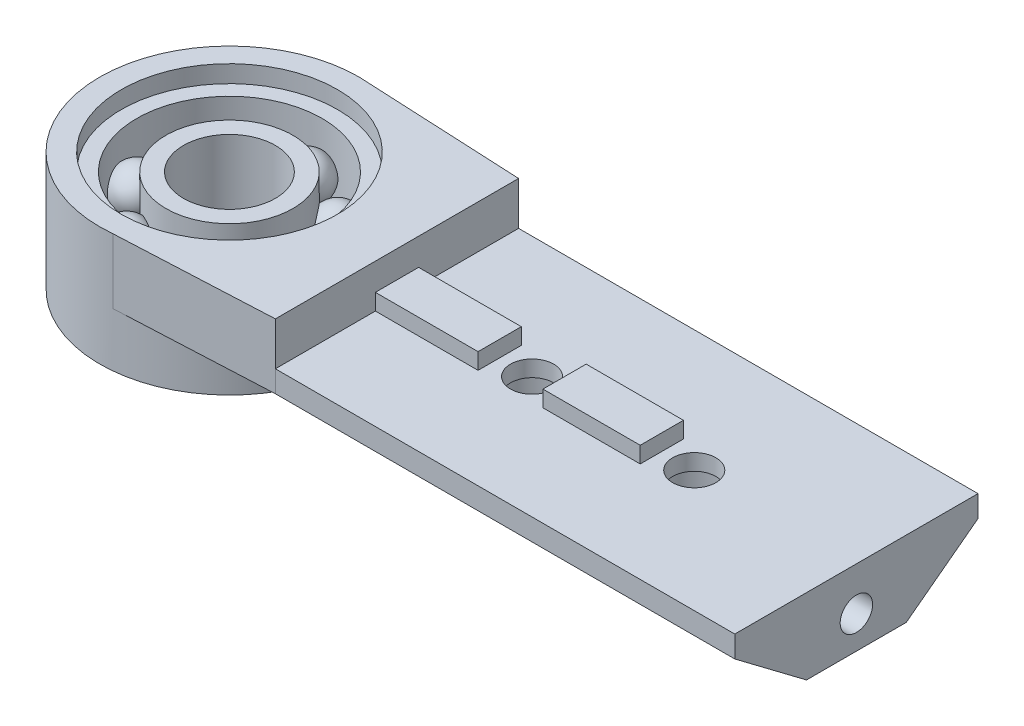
ISO-10303-21;
HEADER;
FILE_DESCRIPTION(('STEP AP214'),'2;1');
FILE_NAME('part.step','',(''),(''),'','','');
FILE_SCHEMA(('AUTOMOTIVE_DESIGN { 1 0 10303 214 1 1 1 1 }'));
ENDSEC;
DATA;
#1=APPLICATION_CONTEXT('core data for automotive mechanical design processes');
#2=APPLICATION_PROTOCOL_DEFINITION('international standard','automotive_design',2000,#1);
#3=PRODUCT_CONTEXT('',#1,'mechanical');
#4=PRODUCT('Part','Part','',(#3));
#5=PRODUCT_RELATED_PRODUCT_CATEGORY('part','',(#4));
#6=PRODUCT_DEFINITION_FORMATION('','',#4);
#7=PRODUCT_DEFINITION_CONTEXT('part definition',#1,'design');
#8=PRODUCT_DEFINITION('design','',#6,#7);
#9=PRODUCT_DEFINITION_SHAPE('','',#8);
#10=(LENGTH_UNIT() NAMED_UNIT(*) SI_UNIT(.MILLI.,.METRE.));
#11=(NAMED_UNIT(*) PLANE_ANGLE_UNIT() SI_UNIT($,.RADIAN.));
#12=(NAMED_UNIT(*) SI_UNIT($,.STERADIAN.) SOLID_ANGLE_UNIT());
#13=UNCERTAINTY_MEASURE_WITH_UNIT(LENGTH_MEASURE(1.E-05),#10,'distance_accuracy_value','');
#14=(GEOMETRIC_REPRESENTATION_CONTEXT(3) GLOBAL_UNCERTAINTY_ASSIGNED_CONTEXT((#13)) GLOBAL_UNIT_ASSIGNED_CONTEXT((#10,
#11,#12)) REPRESENTATION_CONTEXT('',''));
#15=CARTESIAN_POINT('',(0.,0.,0.));
#16=DIRECTION('',(0.,0.,1.));
#17=DIRECTION('',(1.,0.,0.));
#18=AXIS2_PLACEMENT_3D('',#15,#16,#17);
#19=CARTESIAN_POINT('',(-31.,-11.2,0.));
#20=DIRECTION('',(0.,1.,0.));
#21=DIRECTION('',(0.,0.,1.));
#22=AXIS2_PLACEMENT_3D('',#19,#20,#21);
#23=PLANE('',#22);
#24=CARTESIAN_POINT('',(-31.,-11.2,0.));
#25=DIRECTION('',(0.,1.,0.));
#26=DIRECTION('',(0.,0.,1.));
#27=AXIS2_PLACEMENT_3D('',#24,#25,#26);
#28=CIRCLE('',#27,8.5);
#29=CARTESIAN_POINT('',(-31.,-11.2,8.50000000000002));
#30=VERTEX_POINT('',#29);
#31=EDGE_CURVE('E20',#30,#30,#28,.T.);
#32=ORIENTED_EDGE('',*,*,#31,.T.);
#33=EDGE_LOOP('',(#32));
#34=FACE_BOUND('',#33,.T.);
#35=ADVANCED_FACE('F15',(#34),#23,.T.);
#36=CARTESIAN_POINT('',(-31.,-3.2,0.));
#37=DIRECTION('',(0.,1.,0.));
#38=DIRECTION('',(0.,0.,1.));
#39=AXIS2_PLACEMENT_3D('',#36,#37,#38);
#40=CYLINDRICAL_SURFACE('',#39,8.5);
#41=CARTESIAN_POINT('',(-31.,4.8,0.));
#42=DIRECTION('',(0.,1.,0.));
#43=DIRECTION('',(0.,0.,1.));
#44=AXIS2_PLACEMENT_3D('',#41,#42,#43);
#45=CIRCLE('',#44,8.5);
#46=CARTESIAN_POINT('',(-31.,4.8,8.50000000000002));
#47=VERTEX_POINT('',#46);
#48=EDGE_CURVE('E368',#47,#47,#45,.F.);
#49=ORIENTED_EDGE('',*,*,#48,.F.);
#50=EDGE_LOOP('',(#49));
#51=FACE_BOUND('',#50,.T.);
#52=ORIENTED_EDGE('',*,*,#31,.F.);
#53=EDGE_LOOP('',(#52));
#54=FACE_BOUND('',#53,.T.);
#55=ADVANCED_FACE('F376',(#51,#54),#40,.F.);
#56=CARTESIAN_POINT('',(-31.,4.8,0.));
#57=DIRECTION('',(0.,1.,0.));
#58=DIRECTION('',(0.,0.,1.));
#59=AXIS2_PLACEMENT_3D('',#56,#57,#58);
#60=PLANE('',#59);
#61=ORIENTED_EDGE('',*,*,#48,.T.);
#62=EDGE_LOOP('',(#61));
#63=FACE_BOUND('',#62,.T.);
#64=CARTESIAN_POINT('',(-31.,4.8,0.));
#65=DIRECTION('',(0.,1.,0.));
#66=DIRECTION('',(0.,0.,1.));
#67=AXIS2_PLACEMENT_3D('',#64,#65,#66);
#68=CIRCLE('',#67,11.75);
#69=CARTESIAN_POINT('',(-31.,4.8,11.75));
#70=VERTEX_POINT('',#69);
#71=EDGE_CURVE('E366',#70,#70,#68,.F.);
#72=ORIENTED_EDGE('',*,*,#71,.F.);
#73=EDGE_LOOP('',(#72));
#74=FACE_BOUND('',#73,.T.);
#75=ADVANCED_FACE('F312',(#63,#74),#60,.T.);
#76=CARTESIAN_POINT('',(-31.,-3.2,0.));
#77=DIRECTION('',(0.,1.,0.));
#78=DIRECTION('',(0.,0.,1.));
#79=AXIS2_PLACEMENT_3D('',#76,#77,#78);
#80=CYLINDRICAL_SURFACE('',#79,11.75);
#81=CARTESIAN_POINT('',(-20.2591609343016,-3.2,-4.76412386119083));
#82=CARTESIAN_POINT('',(-20.2591597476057,-3.39615794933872,-4.76412852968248));
#83=CARTESIAN_POINT('',(-20.265631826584,-3.59238820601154,-4.77879591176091));
#84=CARTESIAN_POINT('',(-20.2918081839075,-3.97970476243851,-4.83716067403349));
#85=CARTESIAN_POINT('',(-20.311521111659,-4.17078761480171,-4.88087702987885));
#86=CARTESIAN_POINT('',(-20.3650024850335,-4.54258998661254,-4.99633685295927));
#87=CARTESIAN_POINT('',(-20.3987933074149,-4.7232924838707,-5.06812492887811));
#88=CARTESIAN_POINT('',(-20.4816304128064,-5.06837184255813,-5.23786836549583));
#89=CARTESIAN_POINT('',(-20.5306737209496,-5.23275187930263,-5.33581862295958));
#90=CARTESIAN_POINT('',(-20.6155783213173,-5.45995030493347,-5.49816799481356));
#91=CARTESIAN_POINT('',(-20.6452300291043,-5.53149191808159,-5.55388366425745));
#92=CARTESIAN_POINT('',(-20.7084768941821,-5.66856876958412,-5.67022352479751));
#93=CARTESIAN_POINT('',(-20.7420699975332,-5.73410710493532,-5.730845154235));
#94=CARTESIAN_POINT('',(-20.8132659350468,-5.85847210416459,-5.85646303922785));
#95=CARTESIAN_POINT('',(-20.8508688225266,-5.91729867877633,-5.92145935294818));
#96=CARTESIAN_POINT('',(-20.9300668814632,-6.02750976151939,-6.05516116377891));
#97=CARTESIAN_POINT('',(-20.9716596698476,-6.07889866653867,-6.12386443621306));
#98=CARTESIAN_POINT('',(-21.0545378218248,-6.1689929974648,-6.2574633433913));
#99=CARTESIAN_POINT('',(-21.0954607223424,-6.20844552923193,-6.32208074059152));
#100=CARTESIAN_POINT('',(-21.1803594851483,-6.28029077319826,-6.4531582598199));
#101=CARTESIAN_POINT('',(-21.224333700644,-6.31268725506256,-6.51961737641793));
#102=CARTESIAN_POINT('',(-21.3151339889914,-6.37003280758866,-6.65375281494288));
#103=CARTESIAN_POINT('',(-21.3619590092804,-6.39498460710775,-6.72142868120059));
#104=CARTESIAN_POINT('',(-21.458192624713,-6.43712891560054,-6.85735685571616));
#105=CARTESIAN_POINT('',(-21.5076010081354,-6.45432205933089,-6.92560911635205));
#106=CARTESIAN_POINT('',(-21.6037742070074,-6.47944653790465,-7.05544663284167));
#107=CARTESIAN_POINT('',(-21.650336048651,-6.48810977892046,-7.11704158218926));
#108=CARTESIAN_POINT('',(-21.7449715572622,-6.49881446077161,-7.23967882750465));
#109=CARTESIAN_POINT('',(-21.7930457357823,-6.50085363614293,-7.300720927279));
#110=CARTESIAN_POINT('',(-21.890300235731,-6.49827727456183,-7.42171722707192));
#111=CARTESIAN_POINT('',(-21.9394798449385,-6.49366590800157,-7.48167208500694));
#112=CARTESIAN_POINT('',(-22.0385796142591,-6.47785720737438,-7.60009369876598));
#113=CARTESIAN_POINT('',(-22.0885000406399,-6.46665744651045,-7.65855989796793));
#114=CARTESIAN_POINT('',(-22.2349296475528,-6.42442779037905,-7.8267144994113));
#115=CARTESIAN_POINT('',(-22.3319353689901,-6.38463564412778,-7.93390154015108));
#116=CARTESIAN_POINT('',(-22.5240045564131,-6.28265270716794,-8.13878349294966));
#117=CARTESIAN_POINT('',(-22.6190678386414,-6.22045980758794,-8.23647751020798));
#118=CARTESIAN_POINT('',(-22.8076487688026,-6.07336807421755,-8.42414369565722));
#119=CARTESIAN_POINT('',(-22.9009932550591,-5.98774490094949,-8.51372129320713));
#120=CARTESIAN_POINT('',(-23.0796211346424,-5.79781832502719,-8.68015217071));
#121=CARTESIAN_POINT('',(-23.164901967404,-5.69350901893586,-8.75700141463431));
#122=CARTESIAN_POINT('',(-23.331820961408,-5.45969752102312,-8.90364652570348));
#123=CARTESIAN_POINT('',(-23.4125295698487,-5.32880602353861,-8.97228343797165));
#124=CARTESIAN_POINT('',(-23.5592032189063,-5.05247774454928,-9.09429301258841));
#125=CARTESIAN_POINT('',(-23.6251622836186,-4.90703510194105,-9.14765949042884));
#126=CARTESIAN_POINT('',(-23.7461341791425,-4.59064650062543,-9.24394429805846));
#127=CARTESIAN_POINT('',(-23.7994653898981,-4.4185951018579,-9.28534770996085));
#128=CARTESIAN_POINT('',(-23.8846111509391,-4.0660657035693,-9.35075530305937));
#129=CARTESIAN_POINT('',(-23.9164177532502,-3.88558461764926,-9.37475305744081));
#130=CARTESIAN_POINT('',(-23.9590693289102,-3.50756547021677,-9.40683746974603));
#131=CARTESIAN_POINT('',(-23.9682530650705,-3.30973045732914,-9.41366389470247));
#132=CARTESIAN_POINT('',(-23.9605588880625,-2.91482276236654,-9.40791061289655));
#133=CARTESIAN_POINT('',(-23.9436748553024,-2.71775027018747,-9.39532634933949));
#134=CARTESIAN_POINT('',(-23.8836334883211,-2.32499069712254,-9.34993470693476));
#135=CARTESIAN_POINT('',(-23.8398452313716,-2.12945470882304,-9.31664144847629));
#136=CARTESIAN_POINT('',(-23.7269837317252,-1.75081674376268,-9.22880472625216));
#137=CARTESIAN_POINT('',(-23.6579107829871,-1.56771462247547,-9.17426150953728));
#138=CARTESIAN_POINT('',(-23.4994260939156,-1.22543672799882,-9.04510636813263));
#139=CARTESIAN_POINT('',(-23.4106985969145,-1.06570171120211,-8.97115694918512));
#140=CARTESIAN_POINT('',(-23.2643635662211,-0.844052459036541,-8.84457919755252));
#141=CARTESIAN_POINT('',(-23.2133527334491,-0.773134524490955,-8.79975466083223));
#142=CARTESIAN_POINT('',(-23.1074543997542,-0.638016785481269,-8.7048993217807));
#143=CARTESIAN_POINT('',(-23.0525691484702,-0.573813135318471,-8.65487153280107));
#144=CARTESIAN_POINT('',(-22.9442838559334,-0.457959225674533,-8.55411821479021));
#145=CARTESIAN_POINT('',(-22.8911444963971,-0.405707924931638,-8.50380213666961));
#146=CARTESIAN_POINT('',(-22.7827033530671,-0.308086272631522,-8.39906022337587));
#147=CARTESIAN_POINT('',(-22.7274027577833,-0.262712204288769,-8.34463663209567));
#148=CARTESIAN_POINT('',(-22.615232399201,-0.179382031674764,-8.23191899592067));
#149=CARTESIAN_POINT('',(-22.5583632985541,-0.141422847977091,-8.17362657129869));
#150=CARTESIAN_POINT('',(-22.4436701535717,-0.0733958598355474,-8.05348448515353));
#151=CARTESIAN_POINT('',(-22.3858462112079,-0.0433272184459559,-7.99163520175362));
#152=CARTESIAN_POINT('',(-22.275982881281,0.0057860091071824,-7.87146380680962));
#153=CARTESIAN_POINT('',(-22.2239723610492,0.0256556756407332,-7.81345134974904));
#154=CARTESIAN_POINT('',(-22.1201702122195,0.0585159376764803,-7.6952784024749));
#155=CARTESIAN_POINT('',(-22.0683786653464,0.0715041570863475,-7.63511717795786));
#156=CARTESIAN_POINT('',(-21.9655395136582,0.0904226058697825,-7.51314688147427));
#157=CARTESIAN_POINT('',(-21.9144913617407,0.0963583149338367,-7.45133912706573));
#158=CARTESIAN_POINT('',(-21.813537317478,0.101126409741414,-7.3265180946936));
#159=CARTESIAN_POINT('',(-21.7636318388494,0.0999562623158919,-7.26350439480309));
#160=CARTESIAN_POINT('',(-21.62265464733,0.0863794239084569,-7.08168357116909));
#161=CARTESIAN_POINT('',(-21.5334712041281,0.0650968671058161,-6.96194804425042));
#162=CARTESIAN_POINT('',(-21.362842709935,-0.00145910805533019,-6.72378094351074));
#163=CARTESIAN_POINT('',(-21.2813974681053,-0.046731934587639,-6.60534933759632));
#164=CARTESIAN_POINT('',(-21.1269804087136,-0.159934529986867,-6.37225999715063));
#165=CARTESIAN_POINT('',(-21.0540862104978,-0.228052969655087,-6.25764272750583));
#166=CARTESIAN_POINT('',(-20.9183296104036,-0.384374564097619,-6.03649701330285));
#167=CARTESIAN_POINT('',(-20.8554694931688,-0.472582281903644,-5.92997041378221));
#168=CARTESIAN_POINT('',(-20.7358690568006,-0.673086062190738,-5.72063500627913));
#169=CARTESIAN_POINT('',(-20.6798653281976,-0.786636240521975,-5.61860866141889));
#170=CARTESIAN_POINT('',(-20.5791444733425,-1.03003491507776,-5.42952808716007));
#171=CARTESIAN_POINT('',(-20.5344329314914,-1.15989142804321,-5.34248127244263));
#172=CARTESIAN_POINT('',(-20.4518481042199,-1.44574185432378,-5.17767525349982));
#173=CARTESIAN_POINT('',(-20.415066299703,-1.60304970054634,-5.1016485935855));
#174=CARTESIAN_POINT('',(-20.3534855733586,-1.92872873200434,-4.97186173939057));
#175=CARTESIAN_POINT('',(-20.3286852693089,-2.09709863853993,-4.91809897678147));
#176=CARTESIAN_POINT('',(-20.2925724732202,-2.42050943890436,-4.83891969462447));
#177=CARTESIAN_POINT('',(-20.2800159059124,-2.57478624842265,-4.81091135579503));
#178=CARTESIAN_POINT('',(-20.2633101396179,-2.88602639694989,-4.77351052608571));
#179=CARTESIAN_POINT('',(-20.2591618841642,-3.0429900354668,-4.76412012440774));
#180=CARTESIAN_POINT('',(-20.2591609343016,-3.2,-4.76412386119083));
#181=B_SPLINE_CURVE_WITH_KNOTS('',3,(#81,#82,#83,#84,#85,#86,#87,#88,#89,#90,#91,#92,#93,#94,
#95,#96,#97,#98,#99,#100,#101,#102,#103,#104,#105,#106,#107,#108,#109,#110,#111,#112,#113,#114,
#115,#116,#117,#118,#119,#120,#121,#122,#123,#124,#125,#126,#127,#128,#129,#130,#131,#132,#133,
#134,#135,#136,#137,#138,#139,#140,#141,#142,#143,#144,#145,#146,#147,#148,#149,#150,#151,#152,
#153,#154,#155,#156,#157,#158,#159,#160,#161,#162,#163,#164,#165,#166,#167,#168,#169,#170,#171,
#172,#173,#174,#175,#176,#177,#178,#179,#180),.UNSPECIFIED.,.T.,.F.,(4,2,2,2,2,2,2,2,2,2,2,2,2,
2,2,2,2,2,2,2,2,2,2,2,2,2,2,2,2,2,2,2,2,2,2,2,2,2,2,2,2,2,2,2,2,2,2,2,2,4),(0.,
0.587946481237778,1.17627740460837,1.76554706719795,2.35470186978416,2.64058700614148,
2.92632381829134,3.21206443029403,3.49763542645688,3.755471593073,4.01316967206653,
4.27077317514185,4.52835559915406,4.76115716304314,4.99403833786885,5.2267735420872,
5.45959452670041,5.90718770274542,6.35482302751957,6.81826765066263,7.28185894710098,
7.78495179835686,8.28824811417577,8.84034777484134,9.3926511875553,9.98444164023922,
10.5763710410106,11.1827413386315,11.7891045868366,12.3769822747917,12.6711783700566,
12.9652050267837,13.2346031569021,13.5038551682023,13.7729951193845,14.0421065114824,
14.2830147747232,14.5240061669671,14.7648101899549,15.0057000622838,15.455791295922,
15.9058714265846,16.3597640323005,16.8137598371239,17.2995411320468,17.7855621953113,
18.3189613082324,18.8522988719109,19.3228538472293,19.7934616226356),.UNSPECIFIED.);
#182=CARTESIAN_POINT('',(-20.2591609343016,-3.2,-4.76412386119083));
#183=VERTEX_POINT('',#182);
#184=EDGE_CURVE('E296',#183,#183,#181,.T.);
#185=ORIENTED_EDGE('',*,*,#184,.F.);
#186=EDGE_LOOP('',(#185));
#187=FACE_BOUND('',#186,.T.);
#188=CARTESIAN_POINT('',(-20.578454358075,-3.2,5.42714348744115));
#189=CARTESIAN_POINT('',(-20.5784499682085,-3.39615794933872,5.42714150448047));
#190=CARTESIAN_POINT('',(-20.571017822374,-3.59238820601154,5.41293646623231));
#191=CARTESIAN_POINT('',(-20.5417071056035,-3.97970476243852,5.35608113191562));
#192=CARTESIAN_POINT('',(-20.5198190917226,-4.17078761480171,5.31341224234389));
#193=CARTESIAN_POINT('',(-20.4628940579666,-4.54258998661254,5.199610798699));
#194=CARTESIAN_POINT('',(-20.4278361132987,-4.72329248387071,5.1284329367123));
#195=CARTESIAN_POINT('',(-20.3467734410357,-5.06837184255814,4.95783497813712));
#196=CARTESIAN_POINT('',(-20.3007708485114,-5.23275187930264,4.85842038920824));
#197=CARTESIAN_POINT('',(-20.2267781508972,-5.45995030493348,4.69081612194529));
#198=CARTESIAN_POINT('',(-20.2017054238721,-5.5314919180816,4.6328953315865));
#199=CARTESIAN_POINT('',(-20.1501810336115,-5.66856876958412,4.51091022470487));
#200=CARTESIAN_POINT('',(-20.1237300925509,-5.73410710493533,4.44684911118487));
#201=CARTESIAN_POINT('',(-20.069908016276,-5.8584721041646,4.31286441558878));
#202=CARTESIAN_POINT('',(-20.0425368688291,-5.91729867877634,4.24294075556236));
#203=CARTESIAN_POINT('',(-19.9873837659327,-6.02750976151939,4.09765950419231));
#204=CARTESIAN_POINT('',(-19.9596020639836,-6.07889866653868,4.02230516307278));
#205=CARTESIAN_POINT('',(-19.906823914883,-6.16899299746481,3.87421085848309));
#206=CARTESIAN_POINT('',(-19.8818190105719,-6.20844552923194,3.80192775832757));
#207=CARTESIAN_POINT('',(-19.8322719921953,-6.28029077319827,3.65382573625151));
#208=CARTESIAN_POINT('',(-19.8077296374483,-6.31268725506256,3.57800872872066));
#209=CARTESIAN_POINT('',(-19.7594713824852,-6.37003280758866,3.42338612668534));
#210=CARTESIAN_POINT('',(-19.7357551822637,-6.39498460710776,3.34458163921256));
#211=CARTESIAN_POINT('',(-19.6894829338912,-6.43712891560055,3.18459333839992));
#212=CARTESIAN_POINT('',(-19.6669267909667,-6.4543220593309,3.10340972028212));
#213=CARTESIAN_POINT('',(-19.6253787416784,-6.47944653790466,2.94726611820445));
#214=CARTESIAN_POINT('',(-19.606252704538,-6.48810977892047,2.87245878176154));
#215=CARTESIAN_POINT('',(-19.5693753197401,-6.49881446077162,2.7220066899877));
#216=CARTESIAN_POINT('',(-19.5516244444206,-6.50085363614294,2.6463616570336));
#217=CARTESIAN_POINT('',(-19.5176629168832,-6.49827727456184,2.49488506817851));
#218=CARTESIAN_POINT('',(-19.501451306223,-6.49366590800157,2.41905365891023));
#219=CARTESIAN_POINT('',(-19.4706532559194,-6.47785720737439,2.26773967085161));
#220=CARTESIAN_POINT('',(-19.456067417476,-6.46665744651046,2.192257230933));
#221=CARTESIAN_POINT('',(-19.4158962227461,-6.42442779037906,1.97293127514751));
#222=CARTESIAN_POINT('',(-19.3925760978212,-6.38463564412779,1.83025912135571));
#223=CARTESIAN_POINT('',(-19.3521461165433,-6.28265270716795,1.55235157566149));
#224=CARTESIAN_POINT('',(-19.3350368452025,-6.22045980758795,1.41711688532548));
#225=CARTESIAN_POINT('',(-19.3058918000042,-6.07336807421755,1.15267042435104));
#226=CARTESIAN_POINT('',(-19.2940565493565,-5.98774490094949,1.02384004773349));
#227=CARTESIAN_POINT('',(-19.2753083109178,-5.79781832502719,0.780415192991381));
#228=CARTESIAN_POINT('',(-19.2683968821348,-5.69350901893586,0.665825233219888));
#229=CARTESIAN_POINT('',(-19.2578174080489,-5.45969752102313,0.443890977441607));
#230=CARTESIAN_POINT('',(-19.2544759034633,-5.32880602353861,0.337996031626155));
#231=CARTESIAN_POINT('',(-19.2505345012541,-5.05247774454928,0.147250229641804));
#232=CARTESIAN_POINT('',(-19.2499357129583,-4.90703510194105,0.0624079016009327));
#233=CARTESIAN_POINT('',(-19.2500819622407,-4.59064650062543,-0.0922043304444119));
#234=CARTESIAN_POINT('',(-19.2509629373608,-4.4185951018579,-0.159714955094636));
#235=CARTESIAN_POINT('',(-19.2529127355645,-4.0660657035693,-0.267065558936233));
#236=CARTESIAN_POINT('',(-19.2539816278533,-3.88558461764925,-0.306895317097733));
#237=CARTESIAN_POINT('',(-19.2554898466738,-3.50756547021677,-0.360245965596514));
#238=CARTESIAN_POINT('',(-19.2558786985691,-3.30973045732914,-0.371682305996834));
#239=CARTESIAN_POINT('',(-19.2555795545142,-2.91482276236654,-0.362079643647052));
#240=CARTESIAN_POINT('',(-19.2548913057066,-2.71775027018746,-0.341033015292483));
#241=CARTESIAN_POINT('',(-19.2529447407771,-2.32499069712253,-0.265789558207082));
#242=CARTESIAN_POINT('',(-19.2516729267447,-2.12945470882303,-0.210796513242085));
#243=CARTESIAN_POINT('',(-19.2499784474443,-1.75081674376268,-0.0677925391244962));
#244=CARTESIAN_POINT('',(-19.2495557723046,-1.56771462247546,0.0202180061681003));
#245=CARTESIAN_POINT('',(-19.2517197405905,-1.22543672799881,0.224653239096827));
#246=CARTESIAN_POINT('',(-19.2542150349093,-1.06570171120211,0.340129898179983));
#247=CARTESIAN_POINT('',(-19.2619391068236,-0.844052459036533,0.533459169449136));
#248=CARTESIAN_POINT('',(-19.2651796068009,-0.773134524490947,0.601288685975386));
#249=CARTESIAN_POINT('',(-19.273313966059,-0.638016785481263,0.743224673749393));
#250=CARTESIAN_POINT('',(-19.2782068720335,-0.573813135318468,0.817327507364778));
#251=CARTESIAN_POINT('',(-19.2894642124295,-0.457959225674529,0.964807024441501));
#252=CARTESIAN_POINT('',(-19.2956710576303,-0.405707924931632,1.03772461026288));
#253=CARTESIAN_POINT('',(-19.3099496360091,-0.308086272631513,1.18781282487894));
#254=CARTESIAN_POINT('',(-19.3180203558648,-0.262712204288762,1.26498112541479));
#255=CARTESIAN_POINT('',(-19.3362094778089,-0.179382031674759,1.42295773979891));
#256=CARTESIAN_POINT('',(-19.3463270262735,-0.141422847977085,1.5037645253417));
#257=CARTESIAN_POINT('',(-19.3687478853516,-0.0733958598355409,1.66834260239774));
#258=CARTESIAN_POINT('',(-19.3810509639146,-0.0433272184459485,1.7521135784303));
#259=CARTESIAN_POINT('',(-19.4065060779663,0.00578600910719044,1.91293382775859));
#260=CARTESIAN_POINT('',(-19.4194340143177,0.0256556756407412,1.98976746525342));
#261=CARTESIAN_POINT('',(-19.4471057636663,0.0585159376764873,2.14460288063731));
#262=CARTESIAN_POINT('',(-19.4618502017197,0.0715041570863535,2.22260505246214));
#263=CARTESIAN_POINT('',(-19.4930912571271,0.0904226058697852,2.3790551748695));
#264=CARTESIAN_POINT('',(-19.5095865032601,0.0963583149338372,2.45750273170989));
#265=CARTESIAN_POINT('',(-19.5442316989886,0.101126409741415,2.61425642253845));
#266=CARTESIAN_POINT('',(-19.5623822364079,0.0999562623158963,2.69256249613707));
#267=CARTESIAN_POINT('',(-19.6166376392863,0.0863794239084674,2.91614633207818));
#268=CARTESIAN_POINT('',(-19.6546456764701,0.0650968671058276,3.06052663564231));
#269=CARTESIAN_POINT('',(-19.7344670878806,-0.00145910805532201,3.34242412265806));
#270=CARTESIAN_POINT('',(-19.776280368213,-0.0467319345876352,3.47994147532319));
#271=CARTESIAN_POINT('',(-19.8622394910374,-0.159934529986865,3.74599842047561));
#272=CARTESIAN_POINT('',(-19.906402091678,-0.228052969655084,3.87445209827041));
#273=CARTESIAN_POINT('',(-19.9946579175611,-0.384374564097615,4.11847297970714));
#274=CARTESIAN_POINT('',(-20.038751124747,-0.472582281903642,4.23403724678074));
#275=CARTESIAN_POINT('',(-20.1278464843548,-0.673086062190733,4.45806312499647));
#276=CARTESIAN_POINT('',(-20.1726961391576,-0.786636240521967,4.56546098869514));
#277=CARTESIAN_POINT('',(-20.2577268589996,-1.03003491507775,4.76209753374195));
#278=CARTESIAN_POINT('',(-20.2979056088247,-1.1598914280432,4.85132722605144));
#279=CARTESIAN_POINT('',(-20.3752653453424,-1.44574185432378,5.01864951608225));
#280=CARTESIAN_POINT('',(-20.4117723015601,-1.60304970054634,5.09480853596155));
#281=CARTESIAN_POINT('',(-20.4748487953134,-1.92872873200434,5.22387506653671));
#282=CARTESIAN_POINT('',(-20.5014194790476,-2.09709863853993,5.27678525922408));
#283=CARTESIAN_POINT('',(-20.5408083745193,-2.42050943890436,5.35438685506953));
#284=CARTESIAN_POINT('',(-20.554877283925,-2.57478624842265,5.38166688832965));
#285=CARTESIAN_POINT('',(-20.5737025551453,-2.88602639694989,5.41804701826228));
#286=CARTESIAN_POINT('',(-20.5784578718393,-3.0429900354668,5.42714507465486));
#287=CARTESIAN_POINT('',(-20.578454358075,-3.2,5.42714348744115));
#288=B_SPLINE_CURVE_WITH_KNOTS('',3,(#188,#189,#190,#191,#192,#193,#194,#195,#196,#197,#198,
#199,#200,#201,#202,#203,#204,#205,#206,#207,#208,#209,#210,#211,#212,#213,#214,#215,#216,#217,
#218,#219,#220,#221,#222,#223,#224,#225,#226,#227,#228,#229,#230,#231,#232,#233,#234,#235,#236,
#237,#238,#239,#240,#241,#242,#243,#244,#245,#246,#247,#248,#249,#250,#251,#252,#253,#254,#255,
#256,#257,#258,#259,#260,#261,#262,#263,#264,#265,#266,#267,#268,#269,#270,#271,#272,#273,#274,
#275,#276,#277,#278,#279,#280,#281,#282,#283,#284,#285,#286,#287),.UNSPECIFIED.,.T.,.F.,(4,2,2,
2,2,2,2,2,2,2,2,2,2,2,2,2,2,2,2,2,2,2,2,2,2,2,2,2,2,2,2,2,2,2,2,2,2,2,2,2,2,2,2,2,2,2,2,2,2,4),
(0.,0.58794648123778,1.17627740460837,1.76554706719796,2.35470186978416,2.64058700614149,
2.92632381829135,3.21206443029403,3.49763542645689,3.755471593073,4.01316967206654,
4.27077317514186,4.52835559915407,4.76115716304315,4.99403833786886,5.22677354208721,
5.45959452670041,5.90718770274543,6.35482302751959,6.81826765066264,7.28185894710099,
7.78495179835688,8.28824811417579,8.84034777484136,9.39265118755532,9.98444164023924,
10.5763710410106,11.1827413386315,11.7891045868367,12.3769822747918,12.6711783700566,
12.9652050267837,13.2346031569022,13.5038551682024,13.7729951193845,14.0421065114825,
14.2830147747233,14.5240061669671,14.7648101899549,15.0057000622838,15.4557912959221,
15.9058714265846,16.3597640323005,16.813759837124,17.2995411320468,17.7855621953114,
18.3189613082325,18.852298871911,19.3228538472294,19.7934616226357),.UNSPECIFIED.);
#289=CARTESIAN_POINT('',(-20.578454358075,-3.2,5.42714348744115));
#290=VERTEX_POINT('',#289);
#291=EDGE_CURVE('E302',#290,#290,#288,.T.);
#292=ORIENTED_EDGE('',*,*,#291,.F.);
#293=EDGE_LOOP('',(#292));
#294=FACE_BOUND('',#293,.T.);
#295=CARTESIAN_POINT('',(-28.7453842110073,-3.2,11.531661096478));
#296=CARTESIAN_POINT('',(-28.7453799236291,-3.39615794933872,11.5316632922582));
#297=CARTESIAN_POINT('',(-28.7296401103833,-3.59238820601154,11.5286172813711));
#298=CARTESIAN_POINT('',(-28.6669138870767,-3.97970476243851,11.5160846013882));
#299=CARTESIAN_POINT('',(-28.61990705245,-4.17078761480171,11.5065937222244));
#300=CARTESIAN_POINT('',(-28.4954413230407,-4.54258998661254,11.480145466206));
#301=CARTESIAN_POINT('',(-28.4179339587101,-4.7232924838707,11.4631761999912));
#302=CARTESIAN_POINT('',(-28.2340133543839,-5.06837184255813,11.4201874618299));
#303=CARTESIAN_POINT('',(-28.1276057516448,-5.23275187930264,11.3941697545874));
#304=CARTESIAN_POINT('',(-27.9504337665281,-5.45995030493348,11.3475200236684));
#305=CARTESIAN_POINT('',(-27.8895168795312,-5.53149191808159,11.3310096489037));
#306=CARTESIAN_POINT('',(-27.7620201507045,-5.66856876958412,11.2952365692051));
#307=CARTESIAN_POINT('',(-27.6954432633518,-5.73410710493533,11.2759752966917));
#308=CARTESIAN_POINT('',(-27.5571322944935,-5.8584721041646,11.2345169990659));
#309=CARTESIAN_POINT('',(-27.4853981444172,-5.91729867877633,11.212319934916));
#310=CARTESIAN_POINT('',(-27.337425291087,-6.02750976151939,11.1648589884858));
#311=CARTESIAN_POINT('',(-27.2611892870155,-6.07889866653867,11.1395969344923));
#312=CARTESIAN_POINT('',(-27.1124978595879,-6.16899299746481,11.0885252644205));
#313=CARTESIAN_POINT('',(-27.0403943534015,-6.20844552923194,11.0630071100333));
#314=CARTESIAN_POINT('',(-26.8937114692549,-6.28029077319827,11.0094044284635));
#315=CARTESIAN_POINT('',(-26.8191334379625,-6.31268725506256,10.9813212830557));
#316=CARTESIAN_POINT('',(-26.6681560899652,-6.37003280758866,10.9226454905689));
#317=CARTESIAN_POINT('',(-26.5917574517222,-6.39498460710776,10.8920537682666));
#318=CARTESIAN_POINT('',(-26.437823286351,-6.43712891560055,10.8284797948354));
#319=CARTESIAN_POINT('',(-26.3602878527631,-6.4543220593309,10.7954977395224));
#320=CARTESIAN_POINT('',(-26.2123050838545,-6.47944653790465,10.7306273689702));
#321=CARTESIAN_POINT('',(-26.1418934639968,-6.48810977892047,10.698939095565));
#322=CARTESIAN_POINT('',(-26.0012726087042,-6.49881446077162,10.6339656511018));
#323=CARTESIAN_POINT('',(-25.9310634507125,-6.50085363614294,10.6006799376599));
#324=CARTESIAN_POINT('',(-25.7914596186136,-6.49827727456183,10.5327880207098));
#325=CARTESIAN_POINT('',(-25.7220644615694,-6.49366590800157,10.4981826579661));
#326=CARTESIAN_POINT('',(-25.584560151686,-6.47785720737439,10.4279188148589));
#327=CARTESIAN_POINT('',(-25.5164514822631,-6.46665744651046,10.3922599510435));
#328=CARTESIAN_POINT('',(-25.3199292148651,-6.42442779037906,10.2869195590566));
#329=CARTESIAN_POINT('',(-25.1938437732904,-6.38463564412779,10.2161973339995));
#330=CARTESIAN_POINT('',(-24.9513592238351,-6.28265270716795,10.0745342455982));
#331=CARTESIAN_POINT('',(-24.8349610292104,-6.22045980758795,10.0035933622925));
#332=CARTESIAN_POINT('',(-24.6100368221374,-6.07336807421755,9.86150020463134));
#333=CARTESIAN_POINT('',(-24.5019340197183,-5.98774490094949,9.79042895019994));
#334=CARTESIAN_POINT('',(-24.2999274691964,-5.79781832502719,9.65331399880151));
#335=CARTESIAN_POINT('',(-24.2060282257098,-5.69350901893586,9.58727190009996));
#336=CARTESIAN_POINT('',(-24.0259168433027,-5.45969752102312,9.4571695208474));
#337=CARTESIAN_POINT('',(-23.9410414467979,-5.32880602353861,9.39375759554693));
#338=CARTESIAN_POINT('',(-23.7894529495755,-5.05247774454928,9.27791104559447));
#339=CARTESIAN_POINT('',(-23.7227472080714,-4.90703510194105,9.22548087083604));
#340=CARTESIAN_POINT('',(-23.6019576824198,-4.59064650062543,9.12896737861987));
#341=CARTESIAN_POINT('',(-23.5497250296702,-4.4185951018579,9.08618641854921));
#342=CARTESIAN_POINT('',(-23.4670106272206,-4.06606570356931,9.01772999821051));
#343=CARTESIAN_POINT('',(-23.4365369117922,-3.88558461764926,8.99206085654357));
#344=CARTESIAN_POINT('',(-23.3957660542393,-3.50756547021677,8.9576180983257));
#345=CARTESIAN_POINT('',(-23.3870672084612,-3.30973045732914,8.95018364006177));
#346=CARTESIAN_POINT('',(-23.3943883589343,-2.91482276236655,8.95640468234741));
#347=CARTESIAN_POINT('',(-23.4104141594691,-2.71775027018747,8.97006513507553));
#348=CARTESIAN_POINT('',(-23.4680281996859,-2.32499069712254,9.01850054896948));
#349=CARTESIAN_POINT('',(-23.5102305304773,-2.12945470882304,9.05378249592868));
#350=CARTESIAN_POINT('',(-23.6209790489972,-1.75081674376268,9.14426881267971));
#351=CARTESIAN_POINT('',(-23.689524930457,-1.56771462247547,9.19947295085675));
#352=CARTESIAN_POINT('',(-23.8507080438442,-1.22543672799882,9.32524437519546));
#353=CARTESIAN_POINT('',(-23.942547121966,-1.06570171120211,9.39529199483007));
#354=CARTESIAN_POINT('',(-24.0985139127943,-0.844052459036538,9.50979190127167));
#355=CARTESIAN_POINT('',(-24.1535655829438,-0.773134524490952,9.54954938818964));
#356=CARTESIAN_POINT('',(-24.2696072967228,-0.638016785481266,9.63168533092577));
#357=CARTESIAN_POINT('',(-24.33059390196,-0.57381313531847,9.67406226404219));
#358=CARTESIAN_POINT('',(-24.4529168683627,-0.457959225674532,9.75721289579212));
#359=CARTESIAN_POINT('',(-24.5137960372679,-0.405707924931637,9.79782355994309));
#360=CARTESIAN_POINT('',(-24.6400422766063,-0.30808627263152,9.88023858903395));
#361=CARTESIAN_POINT('',(-24.7054068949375,-0.262712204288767,9.92204229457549));
#362=CARTESIAN_POINT('',(-24.8402587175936,-0.179382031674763,10.0063182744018));
#363=CARTESIAN_POINT('',(-24.9097441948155,-0.141422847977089,10.0487902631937));
#364=CARTESIAN_POINT('',(-25.0523956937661,-0.0733958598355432,10.1338736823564));
#365=CARTESIAN_POINT('',(-25.1255613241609,-0.0433272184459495,10.1764850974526));
#366=CARTESIAN_POINT('',(-25.2671666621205,0.00578600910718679,10.2568532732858));
#367=CARTESIAN_POINT('',(-25.3352980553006,0.0256556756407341,10.2946507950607));
#368=CARTESIAN_POINT('',(-25.4736063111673,0.0585159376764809,10.3695544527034));
#369=CARTESIAN_POINT('',(-25.5437838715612,0.071504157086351,10.4066603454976));
#370=CARTESIAN_POINT('',(-25.6855799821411,0.0904226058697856,10.479780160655));
#371=CARTESIAN_POINT('',(-25.7571973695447,0.0963583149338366,10.5157949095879));
#372=CARTESIAN_POINT('',(-25.9013532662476,0.101126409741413,10.5864425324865));
#373=CARTESIAN_POINT('',(-25.9738920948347,0.0999562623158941,10.6210749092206));
#374=CARTESIAN_POINT('',(-26.1825246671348,0.0863794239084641,10.7180585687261));
#375=CARTESIAN_POINT('',(-26.3191033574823,0.0650968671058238,10.7783623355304));
#376=CARTESIAN_POINT('',(-26.5892675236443,-0.00145910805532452,10.8917156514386));
#377=CARTESIAN_POINT('',(-26.722853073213,-0.0467319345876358,10.9447653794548));
#378=CARTESIAN_POINT('',(-26.9844594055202,-0.159934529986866,11.0434436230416));
#379=CARTESIAN_POINT('',(-27.112423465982,-0.228052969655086,11.0890054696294));
#380=CARTESIAN_POINT('',(-27.3582332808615,-0.384374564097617,11.1721488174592));
#381=CARTESIAN_POINT('',(-27.4760767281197,-0.472582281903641,11.2097285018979));
#382=CARTESIAN_POINT('',(-27.7067772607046,-0.673086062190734,11.2797487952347));
#383=CARTESIAN_POINT('',(-27.8187075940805,-0.786636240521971,11.3116453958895));
#384=CARTESIAN_POINT('',(-28.0254600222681,-1.03003491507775,11.3677665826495));
#385=CARTESIAN_POINT('',(-28.120273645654,-1.1598914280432,11.391987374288));
#386=CARTESIAN_POINT('',(-28.299324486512,-1.44574185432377,11.4358288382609));
#387=CARTESIAN_POINT('',(-28.3816297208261,-1.60304970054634,11.4547709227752));
#388=CARTESIAN_POINT('',(-28.5218655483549,-1.92872873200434,11.4859273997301));
#389=CARTESIAN_POINT('',(-28.579798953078,-2.09709863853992,11.4981425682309));
#390=CARTESIAN_POINT('',(-28.6650288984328,-2.42050943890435,11.5157308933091));
#391=CARTESIAN_POINT('',(-28.6951291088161,-2.57478624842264,11.5217401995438));
#392=CARTESIAN_POINT('',(-28.7353096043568,-2.88602639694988,11.529704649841));
#393=CARTESIAN_POINT('',(-28.7453876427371,-3.0429900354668,11.5316593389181));
#394=CARTESIAN_POINT('',(-28.7453842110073,-3.2,11.531661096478));
#395=B_SPLINE_CURVE_WITH_KNOTS('',3,(#295,#296,#297,#298,#299,#300,#301,#302,#303,#304,#305,
#306,#307,#308,#309,#310,#311,#312,#313,#314,#315,#316,#317,#318,#319,#320,#321,#322,#323,#324,
#325,#326,#327,#328,#329,#330,#331,#332,#333,#334,#335,#336,#337,#338,#339,#340,#341,#342,#343,
#344,#345,#346,#347,#348,#349,#350,#351,#352,#353,#354,#355,#356,#357,#358,#359,#360,#361,#362,
#363,#364,#365,#366,#367,#368,#369,#370,#371,#372,#373,#374,#375,#376,#377,#378,#379,#380,#381,
#382,#383,#384,#385,#386,#387,#388,#389,#390,#391,#392,#393,#394),.UNSPECIFIED.,.T.,.F.,(4,2,2,
2,2,2,2,2,2,2,2,2,2,2,2,2,2,2,2,2,2,2,2,2,2,2,2,2,2,2,2,2,2,2,2,2,2,2,2,2,2,2,2,2,2,2,2,2,2,4),
(0.,0.587946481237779,1.17627740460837,1.76554706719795,2.35470186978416,2.64058700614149,
2.92632381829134,3.21206443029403,3.49763542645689,3.755471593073,4.01316967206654,
4.27077317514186,4.52835559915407,4.76115716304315,4.99403833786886,5.2267735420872,
5.45959452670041,5.90718770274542,6.35482302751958,6.81826765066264,7.28185894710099,
7.78495179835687,8.28824811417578,8.84034777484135,9.39265118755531,9.98444164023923,
10.5763710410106,11.1827413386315,11.7891045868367,12.3769822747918,12.6711783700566,
12.9652050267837,13.2346031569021,13.5038551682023,13.7729951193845,14.0421065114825,
14.2830147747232,14.5240061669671,14.7648101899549,15.0057000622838,15.4557912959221,
15.9058714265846,16.3597640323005,16.813759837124,17.2995411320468,17.7855621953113,
18.3189613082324,18.8522988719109,19.3228538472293,19.7934616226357),.UNSPECIFIED.);
#396=CARTESIAN_POINT('',(-28.7453842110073,-3.2,11.531661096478));
#397=VERTEX_POINT('',#396);
#398=EDGE_CURVE('E337',#397,#397,#395,.T.);
#399=ORIENTED_EDGE('',*,*,#398,.F.);
#400=EDGE_LOOP('',(#399));
#401=FACE_BOUND('',#400,.T.);
#402=CARTESIAN_POINT('',(-38.6100857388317,-3.2,8.95260269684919));
#403=CARTESIAN_POINT('',(-38.6100847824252,-3.39615794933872,8.9526074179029));
#404=CARTESIAN_POINT('',(-38.5978897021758,-3.59238820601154,8.9630141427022));
#405=CARTESIAN_POINT('',(-38.5489820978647,-3.97970476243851,9.00424148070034));
#406=CARTESIAN_POINT('',(-38.5122535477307,-4.17078761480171,9.0350754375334));
#407=CARTESIAN_POINT('',(-38.4139723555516,-4.54258998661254,9.11589644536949));
#408=CARTESIAN_POINT('',(-38.3523801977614,-4.72329248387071,9.16591397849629));
#409=CARTESIAN_POINT('',(-38.2040976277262,-5.06837184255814,9.2829058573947));
#410=CARTESIAN_POINT('',(-38.1174121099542,-5.23275187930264,9.34987689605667));
#411=CARTESIAN_POINT('',(-37.9704749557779,-5.45995030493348,9.4593099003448));
#412=CARTESIAN_POINT('',(-37.9195855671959,-5.5314919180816,9.49664259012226));
#413=CARTESIAN_POINT('',(-37.8121241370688,-5.66856876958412,9.57401939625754));
#414=CARTESIAN_POINT('',(-37.7555550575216,-5.73410710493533,9.6140620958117));
#415=CARTESIAN_POINT('',(-37.6369061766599,-5.8584721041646,9.69634913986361));
#416=CARTESIAN_POINT('',(-37.5748263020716,-5.91729867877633,9.73859351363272));
#417=CARTESIAN_POINT('',(-37.4454602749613,-6.02750976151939,9.8246919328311));
#418=CARTESIAN_POINT('',(-37.3781772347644,-6.07889866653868,9.86854500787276));
#419=CARTESIAN_POINT('',(-37.2455402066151,-6.1689929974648,9.9529539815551));
#420=CARTESIAN_POINT('',(-37.1806335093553,-6.20844552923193,9.99341646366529));
#421=CARTESIAN_POINT('',(-37.0472699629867,-6.28029077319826,10.0746770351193));
#422=CARTESIAN_POINT('',(-36.9788150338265,-6.31268725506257,10.1154749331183));
#423=CARTESIAN_POINT('',(-36.8388076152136,-6.37003280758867,10.1969300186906));
#424=CARTESIAN_POINT('',(-36.7672562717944,-6.39498460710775,10.2375872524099));
#425=CARTESIAN_POINT('',(-36.6215757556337,-6.43712891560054,10.3183001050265));
#426=CARTESIAN_POINT('',(-36.5474467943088,-6.4543220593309,10.3583557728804));
#427=CARTESIAN_POINT('',(-36.4044633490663,-6.47944653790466,10.4336073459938));
#428=CARTESIAN_POINT('',(-36.3357875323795,-6.48810977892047,10.4689000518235));
#429=CARTESIAN_POINT('',(-36.1973135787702,-6.49881446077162,10.5383315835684));
#430=CARTESIAN_POINT('',(-36.12751506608,-6.50085363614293,10.5724700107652));
#431=CARTESIAN_POINT('',(-35.9873934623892,-6.49827727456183,10.6392867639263));
#432=CARTESIAN_POINT('',(-35.9170707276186,-6.49366590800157,10.671965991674));
#433=CARTESIAN_POINT('',(-35.7764037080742,-6.47785720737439,10.7356624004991));
#434=CARTESIAN_POINT('',(-35.706059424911,-6.46665744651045,10.7666789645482));
#435=CARTESIAN_POINT('',(-35.5011713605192,-6.42442779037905,10.8546476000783));
#436=CARTESIAN_POINT('',(-35.3672655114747,-6.38463564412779,10.9091305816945));
#437=CARTESIAN_POINT('',(-35.1053222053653,-6.28265270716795,11.0103871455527));
#438=CARTESIAN_POINT('',(-34.9772853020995,-6.22045980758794,11.0571600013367));
#439=CARTESIAN_POINT('',(-34.7259544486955,-6.07336807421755,11.1444191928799));
#440=CARTESIAN_POINT('',(-34.6029877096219,-5.98774490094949,11.1846251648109));
#441=CARTESIAN_POINT('',(-34.3698378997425,-5.7978183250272,11.2570704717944));
#442=CARTESIAN_POINT('',(-34.2596588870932,-5.69350901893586,11.2893072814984));
#443=CARTESIAN_POINT('',(-34.04564314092,-5.45969752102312,11.3490065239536));
#444=CARTESIAN_POINT('',(-33.9431467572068,-5.3288060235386,11.3758280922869));
#445=CARTESIAN_POINT('',(-33.7580603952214,-5.05247774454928,11.4221156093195));
#446=CARTESIAN_POINT('',(-33.6754784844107,-4.90703510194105,11.4415785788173));
#447=CARTESIAN_POINT('',(-33.524710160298,-4.59064650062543,11.4758404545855));
#448=CARTESIAN_POINT('',(-33.4586961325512,-4.41859510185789,11.4900040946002));
#449=CARTESIAN_POINT('',(-33.3536031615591,-4.0660657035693,11.5119909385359));
#450=CARTESIAN_POINT('',(-33.3145341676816,-3.88558461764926,11.5198118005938));
#451=CARTESIAN_POINT('',(-33.2621855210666,-3.50756547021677,11.5302130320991));
#452=CARTESIAN_POINT('',(-33.2509493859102,-3.30973045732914,11.5323787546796));
#453=CARTESIAN_POINT('',(-33.2603778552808,-2.91482276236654,11.5305336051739));
#454=CARTESIAN_POINT('',(-33.2810499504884,-2.71775027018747,11.5265212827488));
#455=CARTESIAN_POINT('',(-33.3548400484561,-2.32499069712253,11.5116757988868));
#456=CARTESIAN_POINT('',(-33.4087373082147,-2.12945470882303,11.5006786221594));
#457=CARTESIAN_POINT('',(-33.5485329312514,-1.75081674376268,11.4705092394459));
#458=CARTESIAN_POINT('',(-33.6344309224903,-1.56771462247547,11.4513371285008));
#459=CARTESIAN_POINT('',(-33.8332590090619,-1.22543672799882,11.403736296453));
#460=CARTESIAN_POINT('',(-33.9452851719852,-1.06570171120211,11.3756075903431));
#461=CARTESIAN_POINT('',(-34.132048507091,-0.844052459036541,11.3250573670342));
#462=CARTESIAN_POINT('',(-34.1974563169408,-0.773134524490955,11.3068046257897));
#463=CARTESIAN_POINT('',(-34.3340236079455,-0.63801678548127,11.2672904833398));
#464=CARTESIAN_POINT('',(-34.4051797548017,-0.573813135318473,11.2460308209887));
#465=CARTESIAN_POINT('',(-34.5464566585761,-0.457959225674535,11.2022384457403));
#466=CARTESIAN_POINT('',(-34.6161648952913,-0.40570792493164,11.1799615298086));
#467=CARTESIAN_POINT('',(-34.7593128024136,-0.308086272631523,11.1326431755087));
#468=CARTESIAN_POINT('',(-34.8327504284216,-0.262712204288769,11.1076032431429));
#469=CARTESIAN_POINT('',(-34.9827187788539,-0.179382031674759,11.0547170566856));
#470=CARTESIAN_POINT('',(-35.0592482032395,-0.141422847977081,11.0268719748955));
#471=CARTESIAN_POINT('',(-35.2147108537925,-0.0733958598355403,10.96839118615));
#472=CARTESIAN_POINT('',(-35.293643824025,-0.0433272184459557,10.9377557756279));
#473=CARTESIAN_POINT('',(-35.4447676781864,0.00578600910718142,10.8771530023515));
#474=CARTESIAN_POINT('',(-35.5167981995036,0.0256556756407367,10.8474521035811));
#475=CARTESIAN_POINT('',(-35.6615940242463,0.0585159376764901,10.7860200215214));
#476=CARTESIAN_POINT('',(-35.7343595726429,0.0715041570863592,10.7542881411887));
#477=CARTESIAN_POINT('',(-35.879935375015,0.0904226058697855,10.6890169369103));
#478=CARTESIAN_POINT('',(-35.9527455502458,0.0963583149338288,10.6554790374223));
#479=CARTESIAN_POINT('',(-36.0978598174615,0.101126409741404,10.5868214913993));
#480=CARTESIAN_POINT('',(-36.1701637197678,0.0999562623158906,10.5517012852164));
#481=CARTESIAN_POINT('',(-36.3760688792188,0.0863794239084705,10.4490540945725));
#482=CARTESIAN_POINT('',(-36.5083716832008,0.0650968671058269,10.3798713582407));
#483=CARTESIAN_POINT('',(-36.7654394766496,-0.00145910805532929,10.2393231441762));
#484=CARTESIAN_POINT('',(-36.8902046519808,-0.0467319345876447,10.16795772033));
#485=CARTESIAN_POINT('',(-37.1304632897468,-0.15993452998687,10.024950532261));
#486=CARTESIAN_POINT('',(-37.2458692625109,-0.228052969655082,9.95331154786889));
#487=CARTESIAN_POINT('',(-37.4641332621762,-0.38437456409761,9.81296872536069));
#488=CARTESIAN_POINT('',(-37.5669884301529,-0.472582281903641,9.74426555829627));
#489=CARTESIAN_POINT('',(-37.7655719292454,-0.67308606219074,9.60755355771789));
#490=CARTESIAN_POINT('',(-37.8602971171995,-0.786636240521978,9.53993010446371));
#491=CARTESIAN_POINT('',(-38.0330824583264,-1.03003491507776,9.41327553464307));
#492=CARTESIAN_POINT('',(-38.1111343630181,-1.15989142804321,9.35424867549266));
#493=CARTESIAN_POINT('',(-38.2570473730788,-1.44574185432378,9.24159579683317));
#494=CARTESIAN_POINT('',(-38.3231733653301,-1.60304970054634,9.18905716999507));
#495=CARTESIAN_POINT('',(-38.4349680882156,-1.92872873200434,9.09884213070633));
#496=CARTESIAN_POINT('',(-38.480639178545,-2.09709863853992,9.06116400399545));
#497=CARTESIAN_POINT('',(-38.5475302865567,-2.42050943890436,9.00549469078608));
#498=CARTESIAN_POINT('',(-38.5709957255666,-2.57478624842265,8.98570813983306));
#499=CARTESIAN_POINT('',(-38.6022747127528,-2.88602639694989,8.95925951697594));
#500=CARTESIAN_POINT('',(-38.6100865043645,-3.0429900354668,8.95259891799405));
#501=CARTESIAN_POINT('',(-38.6100857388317,-3.2,8.95260269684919));
#502=B_SPLINE_CURVE_WITH_KNOTS('',3,(#402,#403,#404,#405,#406,#407,#408,#409,#410,#411,#412,
#413,#414,#415,#416,#417,#418,#419,#420,#421,#422,#423,#424,#425,#426,#427,#428,#429,#430,#431,
#432,#433,#434,#435,#436,#437,#438,#439,#440,#441,#442,#443,#444,#445,#446,#447,#448,#449,#450,
#451,#452,#453,#454,#455,#456,#457,#458,#459,#460,#461,#462,#463,#464,#465,#466,#467,#468,#469,
#470,#471,#472,#473,#474,#475,#476,#477,#478,#479,#480,#481,#482,#483,#484,#485,#486,#487,#488,
#489,#490,#491,#492,#493,#494,#495,#496,#497,#498,#499,#500,#501),.UNSPECIFIED.,.T.,.F.,(4,2,2,
2,2,2,2,2,2,2,2,2,2,2,2,2,2,2,2,2,2,2,2,2,2,2,2,2,2,2,2,2,2,2,2,2,2,2,2,2,2,2,2,2,2,2,2,2,2,4),
(0.,0.587946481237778,1.17627740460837,1.76554706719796,2.35470186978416,2.64058700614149,
2.92632381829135,3.21206443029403,3.49763542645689,3.75547159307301,4.01316967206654,
4.27077317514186,4.52835559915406,4.76115716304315,4.99403833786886,5.22677354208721,
5.45959452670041,5.90718770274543,6.35482302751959,6.81826765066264,7.28185894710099,
7.78495179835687,8.28824811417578,8.84034777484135,9.39265118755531,9.98444164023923,
10.5763710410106,11.1827413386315,11.7891045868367,12.3769822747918,12.6711783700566,
12.9652050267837,13.2346031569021,13.5038551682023,13.7729951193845,14.0421065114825,
14.2830147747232,14.5240061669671,14.7648101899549,15.0057000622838,15.4557912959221,
15.9058714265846,16.3597640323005,16.813759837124,17.2995411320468,17.7855621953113,
18.3189613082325,18.8522988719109,19.3228538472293,19.7934616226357),.UNSPECIFIED.);
#503=CARTESIAN_POINT('',(-38.6100857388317,-3.2,8.95260269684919));
#504=VERTEX_POINT('',#503);
#505=EDGE_CURVE('E334',#504,#504,#502,.T.);
#506=ORIENTED_EDGE('',*,*,#505,.F.);
#507=EDGE_LOOP('',(#506));
#508=FACE_BOUND('',#507,.T.);
#509=CARTESIAN_POINT('',(-42.744237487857,-3.2,-0.36794813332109));
#510=CARTESIAN_POINT('',(-42.744240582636,-3.39615804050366,-0.367944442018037));
#511=CARTESIAN_POINT('',(-42.7447733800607,-3.59238838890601,-0.351921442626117));
#512=CARTESIAN_POINT('',(-42.7465128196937,-3.97970512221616,-0.287979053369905));
#513=CARTESIAN_POINT('',(-42.7477199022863,-4.17078805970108,-0.240038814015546));
#514=CARTESIAN_POINT('',(-42.7496309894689,-4.54259058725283,-0.11280829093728));
#515=CARTESIAN_POINT('',(-42.7503341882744,-4.72329315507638,-0.0334681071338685));
#516=CARTESIAN_POINT('',(-42.7493494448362,-5.06837263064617,0.155407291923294));
#517=CARTESIAN_POINT('',(-42.7476619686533,-5.23275271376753,0.264936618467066));
#518=CARTESIAN_POINT('',(-42.7416063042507,-5.45995114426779,0.448047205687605));
#519=CARTESIAN_POINT('',(-42.739065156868,-5.53149273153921,0.511110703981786));
#520=CARTESIAN_POINT('',(-42.7325596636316,-5.66856952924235,0.643371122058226));
#521=CARTESIAN_POINT('',(-42.7285960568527,-5.73410783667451,0.712564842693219));
#522=CARTESIAN_POINT('',(-42.718954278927,-5.85847277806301,0.856633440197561));
#523=CARTESIAN_POINT('',(-42.7132760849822,-5.91729932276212,0.931508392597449));
#524=CARTESIAN_POINT('',(-42.6999321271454,-6.02751034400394,1.08633234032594));
#525=CARTESIAN_POINT('',(-42.6922675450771,-6.07889921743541,1.16627829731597));
#526=CARTESIAN_POINT('',(-42.6755632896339,-6.16899348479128,1.32260625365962));
#527=CARTESIAN_POINT('',(-42.6667294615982,-6.20844598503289,1.39858030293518));
#528=CARTESIAN_POINT('',(-42.6471107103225,-6.28029116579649,1.55351326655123));
#529=CARTESIAN_POINT('',(-42.6363268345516,-6.31268761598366,1.63247056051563));
#530=CARTESIAN_POINT('',(-42.6127177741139,-6.37003310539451,1.79271918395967));
#531=CARTESIAN_POINT('',(-42.599893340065,-6.39498487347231,1.87400964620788));
#532=CARTESIAN_POINT('',(-42.5721668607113,-6.43712911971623,2.03823089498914));
#533=CARTESIAN_POINT('',(-42.5572649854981,-6.45432223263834,2.12116154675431));
#534=CARTESIAN_POINT('',(-42.5269503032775,-6.47944665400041,2.27986908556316));
#535=CARTESIAN_POINT('',(-42.5117245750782,-6.48810986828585,2.35556663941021));
#536=CARTESIAN_POINT('',(-42.4796712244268,-6.49881449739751,2.50711977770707));
#537=CARTESIAN_POINT('',(-42.4628430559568,-6.50085364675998,2.58297540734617));
#538=CARTESIAN_POINT('',(-42.4277180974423,-6.49827723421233,2.73418643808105));
#539=CARTESIAN_POINT('',(-42.4094222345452,-6.4936658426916,2.80954212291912));
#540=CARTESIAN_POINT('',(-42.3715176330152,-6.47785709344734,2.9592340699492));
#541=CARTESIAN_POINT('',(-42.3519084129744,-6.46665730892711,3.03356994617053));
#542=CARTESIAN_POINT('',(-42.2929394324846,-6.4244275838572,3.24860541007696));
#543=CARTESIAN_POINT('',(-42.2520470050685,-6.38463539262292,3.38726678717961));
#544=CARTESIAN_POINT('',(-42.1678935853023,-6.28265236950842,3.65519470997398));
#545=CARTESIAN_POINT('',(-42.1246323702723,-6.22045942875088,3.78446036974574));
#546=CARTESIAN_POINT('',(-42.0361521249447,-6.07336761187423,4.03536392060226));
#547=CARTESIAN_POINT('',(-41.9909179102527,-5.98774439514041,4.15657118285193));
#548=CARTESIAN_POINT('',(-41.9021914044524,-5.79781773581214,4.38402391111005));
#549=CARTESIAN_POINT('',(-41.858699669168,-5.69350838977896,4.49026462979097));
#550=CARTESIAN_POINT('',(-41.7719377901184,-5.45969680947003,4.69481069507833));
#551=CARTESIAN_POINT('',(-41.7290022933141,-5.32880526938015,4.79166854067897));
#552=CARTESIAN_POINT('',(-41.6497918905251,-5.05247690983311,4.96523461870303));
#553=CARTESIAN_POINT('',(-41.613519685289,-4.90703422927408,5.04193468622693));
#554=CARTESIAN_POINT('',(-41.5463042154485,-4.59064555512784,5.18117196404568));
#555=CARTESIAN_POINT('',(-41.5162187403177,-4.41859412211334,5.24161465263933));
#556=CARTESIAN_POINT('',(-41.4678843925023,-4.06606466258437,5.33748813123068));
#557=CARTESIAN_POINT('',(-41.4496398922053,-3.88558354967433,5.37290968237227));
#558=CARTESIAN_POINT('',(-41.4251331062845,-3.50756436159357,5.42032246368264));
#559=CARTESIAN_POINT('',(-41.4198207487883,-3.30972933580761,5.43045748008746));
#560=CARTESIAN_POINT('',(-41.4242567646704,-2.91482162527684,5.42193546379));
#561=CARTESIAN_POINT('',(-41.4340086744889,-2.71774913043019,5.40327167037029));
#562=CARTESIAN_POINT('',(-41.4684094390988,-2.3249895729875,5.33632412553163));
#563=CARTESIAN_POINT('',(-41.4934159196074,-2.12945360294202,5.28732886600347));
#564=CARTESIAN_POINT('',(-41.5569897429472,-1.75081568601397,5.15922182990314));
#565=CARTESIAN_POINT('',(-41.5955569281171,-1.56771359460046,5.08011040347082));
#566=CARTESIAN_POINT('',(-41.6823084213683,-1.22543578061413,4.89498160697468));
#567=CARTESIAN_POINT('',(-41.7301636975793,-1.0657008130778,4.78985801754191));
#568=CARTESIAN_POINT('',(-41.8070869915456,-0.844051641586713,4.61232294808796));
#569=CARTESIAN_POINT('',(-41.8335975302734,-0.773133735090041,4.549804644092));
#570=CARTESIAN_POINT('',(-41.8878524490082,-0.638016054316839,4.41839533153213));
#571=CARTESIAN_POINT('',(-41.915596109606,-0.573812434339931,4.3495080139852));
#572=CARTESIAN_POINT('',(-41.9694425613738,-0.457958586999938,4.21174915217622));
#573=CARTESIAN_POINT('',(-41.9954881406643,-0.405707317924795,4.14335961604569));
#574=CARTESIAN_POINT('',(-42.0477444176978,-0.308085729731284,4.00193954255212));
#575=CARTESIAN_POINT('',(-42.0739550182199,-0.262711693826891,3.9289115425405));
#576=CARTESIAN_POINT('',(-42.1261106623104,-0.179381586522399,3.77868755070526));
#577=CARTESIAN_POINT('',(-42.152055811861,-0.141422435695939,3.70149330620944));
#578=CARTESIAN_POINT('',(-42.2032630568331,-0.0733955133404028,3.54348552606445));
#579=CARTESIAN_POINT('',(-42.2285252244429,-0.0433269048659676,3.46267237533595));
#580=CARTESIAN_POINT('',(-42.275368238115,0.00578626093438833,3.3067337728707));
#581=CARTESIAN_POINT('',(-42.2970574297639,0.0256558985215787,3.23189983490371));
#582=CARTESIAN_POINT('',(-42.3393066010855,0.0585161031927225,3.08039162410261));
#583=CARTESIAN_POINT('',(-42.3598661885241,0.0715042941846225,3.00371672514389));
#584=CARTESIAN_POINT('',(-42.3996001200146,0.0904226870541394,2.84920505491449));
#585=CARTESIAN_POINT('',(-42.4187755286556,0.0963583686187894,2.77136923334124));
#586=CARTESIAN_POINT('',(-42.4555741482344,0.101126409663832,2.61510706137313));
#587=CARTESIAN_POINT('',(-42.473196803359,0.0999562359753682,2.53668051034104));
#588=CARTESIAN_POINT('',(-42.5213237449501,0.0863793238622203,2.31169791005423));
#589=CARTESIAN_POINT('',(-42.5497239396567,0.0650967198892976,2.16512469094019));
#590=CARTESIAN_POINT('',(-42.600118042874,-0.00145934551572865,1.87651064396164));
#591=CARTESIAN_POINT('',(-42.6221121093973,-0.0467322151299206,1.73446970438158));
#592=CARTESIAN_POINT('',(-42.6601033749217,-0.159934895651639,1.45746444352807));
#593=CARTESIAN_POINT('',(-42.6760481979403,-0.228053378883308,1.32257025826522));
#594=CARTESIAN_POINT('',(-42.70240911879,-0.384375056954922,1.06442230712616));
#595=CARTESIAN_POINT('',(-42.71282395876,-0.472582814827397,0.9411711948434));
#596=CARTESIAN_POINT('',(-42.729752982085,-0.673086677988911,0.700673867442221));
#597=CARTESIAN_POINT('',(-42.7359430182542,-0.786636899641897,0.584452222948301));
#598=CARTESIAN_POINT('',(-42.7446503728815,-1.03003565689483,0.370395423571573));
#599=CARTESIAN_POINT('',(-42.7471658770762,-1.15989220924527,0.272569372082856));
#600=CARTESIAN_POINT('',(-42.7500655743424,-1.44574271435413,0.0882521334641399));
#601=CARTESIAN_POINT('',(-42.7502181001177,-1.603050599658,0.0037954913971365));
#602=CARTESIAN_POINT('',(-42.7493880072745,-1.92872970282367,-0.139857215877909));
#603=CARTESIAN_POINT('',(-42.7484055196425,-2.09709964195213,-0.19905619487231));
#604=CARTESIAN_POINT('',(-42.7465874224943,-2.42051031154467,-0.286062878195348));
#605=CARTESIAN_POINT('',(-42.7457481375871,-2.57478695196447,-0.316745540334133));
#606=CARTESIAN_POINT('',(-42.7445719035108,-2.88602675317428,-0.357690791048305));
#607=CARTESIAN_POINT('',(-42.7442350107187,-3.04299021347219,-0.367951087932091));
#608=CARTESIAN_POINT('',(-42.744237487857,-3.2,-0.36794813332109));
#609=B_SPLINE_CURVE_WITH_KNOTS('',3,(#509,#510,#511,#512,#513,#514,#515,#516,#517,#518,#519,
#520,#521,#522,#523,#524,#525,#526,#527,#528,#529,#530,#531,#532,#533,#534,#535,#536,#537,#538,
#539,#540,#541,#542,#543,#544,#545,#546,#547,#548,#549,#550,#551,#552,#553,#554,#555,#556,#557,
#558,#559,#560,#561,#562,#563,#564,#565,#566,#567,#568,#569,#570,#571,#572,#573,#574,#575,#576,
#577,#578,#579,#580,#581,#582,#583,#584,#585,#586,#587,#588,#589,#590,#591,#592,#593,#594,#595,
#596,#597,#598,#599,#600,#601,#602,#603,#604,#605,#606,#607,#608),.UNSPECIFIED.,.T.,.F.,(4,2,2,
2,2,2,2,2,2,2,2,2,2,2,2,2,2,2,2,2,2,2,2,2,2,2,2,2,2,2,2,2,2,2,2,2,2,2,2,2,2,2,2,2,2,2,2,2,2,4),
(0.,0.587946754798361,1.17627795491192,1.76554789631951,2.3547029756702,2.64058809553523,
2.92632489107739,3.21206548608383,3.49763646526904,3.75547260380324,4.01317065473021,
4.27077412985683,4.52835652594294,4.76115807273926,4.99403923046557,5.22677441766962,
5.45959538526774,5.90718856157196,6.35482388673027,6.81826853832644,7.28185986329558,
7.78495275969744,8.28824912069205,8.84034882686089,9.39265228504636,9.9844427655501,
10.5763721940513,11.1827424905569,11.7891057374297,12.3769833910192,12.6711794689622,
12.9652061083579,13.2346042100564,13.5038561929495,13.7729961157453,14.0421074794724,
14.2830157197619,14.5240070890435,14.7648110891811,15.0057009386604,15.4557921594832,
15.9058722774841,16.3597649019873,16.8137607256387,17.2995420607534,17.7855631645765,
18.3189623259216,18.8522999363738,19.3228543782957,19.7934616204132),.UNSPECIFIED.);
#610=CARTESIAN_POINT('',(-42.744237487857,-3.2,-0.36794813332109));
#611=VERTEX_POINT('',#610);
#612=EDGE_CURVE('E330',#611,#611,#609,.T.);
#613=ORIENTED_EDGE('',*,*,#612,.F.);
#614=EDGE_LOOP('',(#613));
#615=FACE_BOUND('',#614,.T.);
#616=CARTESIAN_POINT('',(-38.0347388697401,-3.2,-9.41142651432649));
#617=CARTESIAN_POINT('',(-38.0347436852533,-3.39615796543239,-9.41142663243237));
#618=CARTESIAN_POINT('',(-38.0476031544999,-3.59238823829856,-9.40185302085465));
#619=CARTESIAN_POINT('',(-38.098679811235,-3.97970482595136,-9.36334557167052));
#620=CARTESIAN_POINT('',(-38.1369135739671,-4.1707876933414,-9.33439907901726));
#621=CARTESIAN_POINT('',(-38.2375778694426,-4.54259009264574,-9.25656635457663));
#622=CARTESIAN_POINT('',(-38.3000469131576,-4.72329260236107,-9.20764838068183));
#623=CARTESIAN_POINT('',(-38.4471015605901,-5.06837198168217,-9.08911668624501));
#624=CARTESIAN_POINT('',(-38.5316828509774,-5.23275202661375,-9.01950700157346));
#625=CARTESIAN_POINT('',(-38.6710687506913,-5.45995045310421,-8.90060498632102));
#626=CARTESIAN_POINT('',(-38.7187893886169,-5.53149206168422,-8.85929880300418));
#627=CARTESIAN_POINT('',(-38.818138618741,-5.66856890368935,-8.77174960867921));
#628=CARTESIAN_POINT('',(-38.8697651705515,-5.7341072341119,-8.72550917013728));
#629=CARTESIAN_POINT('',(-38.9763909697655,-5.85847222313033,-8.62814564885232));
#630=CARTESIAN_POINT('',(-39.0313902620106,-5.91729879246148,-8.57702250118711));
#631=CARTESIAN_POINT('',(-39.1441166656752,-6.02750986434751,-8.4700586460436));
#632=CARTESIAN_POINT('',(-39.2018421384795,-6.07889876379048,-8.41422075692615));
#633=CARTESIAN_POINT('',(-39.3136493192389,-6.16899308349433,-8.30369197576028));
#634=CARTESIAN_POINT('',(-39.3675404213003,-6.20844560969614,-8.24941637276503));
#635=CARTESIAN_POINT('',(-39.4764398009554,-6.28029084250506,-8.13747870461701));
#636=CARTESIAN_POINT('',(-39.5314474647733,-6.31268731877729,-8.07981846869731));
#637=CARTESIAN_POINT('',(-39.6420148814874,-6.37003286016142,-7.96144678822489));
#638=CARTESIAN_POINT('',(-39.6975744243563,-6.39498465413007,-7.90073647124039));
#639=CARTESIAN_POINT('',(-39.8086805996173,-6.43712895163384,-7.77666876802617));
#640=CARTESIAN_POINT('',(-39.8642272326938,-6.4543220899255,-7.71331159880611));
#641=CARTESIAN_POINT('',(-39.969408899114,-6.47944655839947,-7.59065809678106));
#642=CARTESIAN_POINT('',(-40.0190985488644,-6.48810979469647,-7.53155749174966));
#643=CARTESIAN_POINT('',(-40.1176026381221,-6.49881446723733,-7.4120053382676));
#644=CARTESIAN_POINT('',(-40.1664167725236,-6.50085363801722,-7.35155333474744));
#645=CARTESIAN_POINT('',(-40.2627382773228,-6.49827726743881,-7.22981299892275));
#646=CARTESIAN_POINT('',(-40.3102464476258,-6.49366589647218,-7.16852521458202));
#647=CARTESIAN_POINT('',(-40.403647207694,-6.47785718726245,-7.04555879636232));
#648=CARTESIAN_POINT('',(-40.4495391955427,-6.46665742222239,-6.98388002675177));
#649=CARTESIAN_POINT('',(-40.5808941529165,-6.42442775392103,-6.80370379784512));
#650=CARTESIAN_POINT('',(-40.6638079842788,-6.38463559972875,-6.68527885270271));
#651=CARTESIAN_POINT('',(-40.8208136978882,-6.28265264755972,-6.45243471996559));
#652=CARTESIAN_POINT('',(-40.8949047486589,-6.2204597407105,-6.33801591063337));
#653=CARTESIAN_POINT('',(-41.0359025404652,-6.07336799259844,-6.11240344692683));
#654=CARTESIAN_POINT('',(-41.1024631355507,-5.98774481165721,-6.00146641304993));
#655=CARTESIAN_POINT('',(-41.2249727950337,-5.79781822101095,-5.79028275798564));
#656=CARTESIAN_POINT('',(-41.2809184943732,-5.69350890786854,-5.6900395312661));
#657=CARTESIAN_POINT('',(-41.3867439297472,-5.45969739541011,-5.49467394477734));
#658=CARTESIAN_POINT('',(-41.4357006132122,-5.32880589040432,-5.40071572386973));
#659=CARTESIAN_POINT('',(-41.5220131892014,-5.05247759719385,-5.23056981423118));
#660=CARTESIAN_POINT('',(-41.5593643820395,-4.90703494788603,-5.15438932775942));
#661=CARTESIAN_POINT('',(-41.6263163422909,-4.59064633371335,-5.01502507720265));
#662=CARTESIAN_POINT('',(-41.6548143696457,-4.41859492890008,-4.95381787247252));
#663=CARTESIAN_POINT('',(-41.6996353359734,-4.0660655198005,-4.85625235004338));
#664=CARTESIAN_POINT('',(-41.7159537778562,-3.88558442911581,-4.81990321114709));
#665=CARTESIAN_POINT('',(-41.7377428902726,-3.50756527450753,-4.77118156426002));
#666=CARTESIAN_POINT('',(-41.7423545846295,-3.30973025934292,-4.7607090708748));
#667=CARTESIAN_POINT('',(-41.7384576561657,-2.91482256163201,-4.76949058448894));
#668=CARTESIAN_POINT('',(-41.7299459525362,-2.71775006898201,-4.78875157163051));
#669=CARTESIAN_POINT('',(-41.699052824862,-2.32499049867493,-4.85738818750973));
#670=CARTESIAN_POINT('',(-41.6763380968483,-2.12945451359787,-4.90748703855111));
#671=CARTESIAN_POINT('',(-41.6158176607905,-1.75081655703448,-5.0370643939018));
#672=CARTESIAN_POINT('',(-41.5780121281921,-1.56771444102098,-5.11654255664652));
#673=CARTESIAN_POINT('',(-41.4873613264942,-1.22543656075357,-5.29979344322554));
#674=CARTESIAN_POINT('',(-41.4350096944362,-1.06570155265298,-5.40275165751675));
#675=CARTESIAN_POINT('',(-41.3441681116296,-0.844052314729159,-5.57358397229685));
#676=CARTESIAN_POINT('',(-41.3118183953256,-0.773134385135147,-5.63329025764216));
#677=CARTESIAN_POINT('',(-41.2429058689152,-0.638016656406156,-5.75764080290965));
#678=CARTESIAN_POINT('',(-41.2063454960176,-0.573813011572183,-5.82228219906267));
#679=CARTESIAN_POINT('',(-41.132214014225,-0.457959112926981,-5.9502722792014));
#680=CARTESIAN_POINT('',(-41.0949840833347,-0.405707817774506,-6.01327570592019));
#681=CARTESIAN_POINT('',(-41.0169986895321,-0.308086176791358,-6.14230527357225));
#682=CARTESIAN_POINT('',(-40.9762451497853,-0.262712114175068,-6.20832975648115));
#683=CARTESIAN_POINT('',(-40.8913138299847,-0.179381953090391,-6.34276980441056));
#684=CARTESIAN_POINT('',(-40.8471374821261,-0.141422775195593,-6.41118436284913));
#685=CARTESIAN_POINT('',(-40.7555292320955,-0.0733957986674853,-6.54973604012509));
#686=CARTESIAN_POINT('',(-40.7080976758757,-0.0433271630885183,-6.61987297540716));
#687=CARTESIAN_POINT('',(-40.6153861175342,0.00578605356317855,-6.75372245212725));
#688=CARTESIAN_POINT('',(-40.5704015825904,0.0256557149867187,-6.8173379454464));
#689=CARTESIAN_POINT('',(-40.4782896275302,0.0585159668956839,-6.94483351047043));
#690=CARTESIAN_POINT('',(-40.4311614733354,0.0715041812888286,-7.00871366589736));
#691=CARTESIAN_POINT('',(-40.335133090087,0.0904226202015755,-7.13611536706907));
#692=CARTESIAN_POINT('',(-40.2862342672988,0.0963583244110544,-7.19963715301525));
#693=CARTESIAN_POINT('',(-40.1870071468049,0.101126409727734,-7.32583535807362));
#694=CARTESIAN_POINT('',(-40.1366783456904,0.0999562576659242,-7.38851146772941));
#695=CARTESIAN_POINT('',(-39.9907865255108,0.0863794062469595,-7.56641300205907));
#696=CARTESIAN_POINT('',(-39.893898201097,0.0650968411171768,-7.68000408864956));
#697=CARTESIAN_POINT('',(-39.6996708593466,-0.00145914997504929,-7.89935172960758));
#698=CARTESIAN_POINT('',(-39.6023318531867,-0.0467319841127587,-8.00510847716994));
#699=CARTESIAN_POINT('',(-39.4094475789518,-0.159934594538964,-8.20752122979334));
#700=CARTESIAN_POINT('',(-39.3139244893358,-0.228053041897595,-8.30409255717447));
#701=CARTESIAN_POINT('',(-39.1285320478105,-0.384374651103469,-8.4856550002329));
#702=CARTESIAN_POINT('',(-39.0386639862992,-0.47258237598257,-8.57064347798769));
#703=CARTESIAN_POINT('',(-38.8611906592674,-0.673086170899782,-8.73382678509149));
#704=CARTESIAN_POINT('',(-38.7741843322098,-0.786636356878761,-8.81112937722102));
#705=CARTESIAN_POINT('',(-38.6122569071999,-1.03003504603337,-8.95139932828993));
#706=CARTESIAN_POINT('',(-38.537341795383,-1.1598915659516,-9.01435959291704));
#707=CARTESIAN_POINT('',(-38.3950446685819,-1.44574200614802,-9.13154662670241));
#708=CARTESIAN_POINT('',(-38.3291088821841,-1.60304985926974,-9.18432375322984));
#709=CARTESIAN_POINT('',(-38.216279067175,-1.92872890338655,-9.27324080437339));
#710=CARTESIAN_POINT('',(-38.1693828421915,-2.09709881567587,-9.3093826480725));
#711=CARTESIAN_POINT('',(-38.1002246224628,-2.42050959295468,-9.36220905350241));
#712=CARTESIAN_POINT('',(-38.0757126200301,-2.57478637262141,-9.3806832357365));
#713=CARTESIAN_POINT('',(-38.0429669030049,-2.88602645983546,-9.40529261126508));
#714=CARTESIAN_POINT('',(-38.0347350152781,-3.04299006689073,-9.41142641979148));
#715=CARTESIAN_POINT('',(-38.0347388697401,-3.2,-9.41142651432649));
#716=B_SPLINE_CURVE_WITH_KNOTS('',3,(#616,#617,#618,#619,#620,#621,#622,#623,#624,#625,#626,
#627,#628,#629,#630,#631,#632,#633,#634,#635,#636,#637,#638,#639,#640,#641,#642,#643,#644,#645,
#646,#647,#648,#649,#650,#651,#652,#653,#654,#655,#656,#657,#658,#659,#660,#661,#662,#663,#664,
#665,#666,#667,#668,#669,#670,#671,#672,#673,#674,#675,#676,#677,#678,#679,#680,#681,#682,#683,
#684,#685,#686,#687,#688,#689,#690,#691,#692,#693,#694,#695,#696,#697,#698,#699,#700,#701,#702,
#703,#704,#705,#706,#707,#708,#709,#710,#711,#712,#713,#714,#715),.UNSPECIFIED.,.T.,.F.,(4,2,2,
2,2,2,2,2,2,2,2,2,2,2,2,2,2,2,2,2,2,2,2,2,2,2,2,2,2,2,2,2,2,2,2,2,2,2,2,2,2,2,2,2,2,2,2,2,2,4),
(0.,0.587946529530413,1.17627750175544,1.76554721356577,2.35470206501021,2.64058719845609,
2.92632400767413,3.21206461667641,3.49763560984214,3.75547177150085,4.01316984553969,
4.27077334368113,4.52835576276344,4.76115732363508,4.99403849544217,5.22677369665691,
5.45959467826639,5.90718785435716,6.35482317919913,6.81826780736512,7.28185910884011,
7.78495196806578,8.28824829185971,8.84034796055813,9.39265138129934,9.9844418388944,
10.576371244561,11.182741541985,11.789104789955,12.3769824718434,12.6711785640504,
12.9652052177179,13.2346033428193,13.5038553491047,13.7729952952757,14.0421066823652,
14.2830149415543,14.5240063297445,14.7648103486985,15.0057002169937,15.4557914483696,
15.9058715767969,16.3597641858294,16.8137599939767,17.2995412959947,17.7855623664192,
18.3189614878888,18.8522990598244,19.3228539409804,19.7934616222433),.UNSPECIFIED.);
#717=CARTESIAN_POINT('',(-38.0347388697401,-3.2,-9.41142651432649));
#718=VERTEX_POINT('',#717);
#719=EDGE_CURVE('E325',#718,#718,#716,.T.);
#720=ORIENTED_EDGE('',*,*,#719,.F.);
#721=EDGE_LOOP('',(#720));
#722=FACE_BOUND('',#721,.T.);
#723=CARTESIAN_POINT('',(-28.0279384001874,-3.2,-11.3679087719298));
#724=CARTESIAN_POINT('',(-28.0279413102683,-3.39615794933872,-11.367912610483));
#725=CARTESIAN_POINT('',(-28.0434440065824,-3.59238820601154,-11.3719974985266));
#726=CARTESIAN_POINT('',(-28.1053961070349,-3.97970476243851,-11.3879218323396));
#727=CARTESIAN_POINT('',(-28.1518657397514,-4.17078761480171,-11.3997663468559));
#728=CARTESIAN_POINT('',(-28.2754809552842,-4.54258998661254,-11.4299409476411));
#729=CARTESIAN_POINT('',(-28.3526753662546,-4.72329248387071,-11.4482813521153));
#730=CARTESIAN_POINT('',(-28.5370342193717,-5.06837184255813,-11.4893499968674));
#731=CARTESIAN_POINT('',(-28.6441928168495,-5.23275187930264,-11.5120773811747));
#732=CARTESIAN_POINT('',(-28.824059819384,-5.45995030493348,-11.54691946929));
#733=CARTESIAN_POINT('',(-28.8861076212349,-5.5314919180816,-11.5584749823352));
#734=CARTESIAN_POINT('',(-29.0164995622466,-5.66856876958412,-11.5815633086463));
#735=CARTESIAN_POINT('',(-29.0848404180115,-5.73410710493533,-11.593096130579));
#736=CARTESIAN_POINT('',(-29.2274423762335,-5.8584721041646,-11.6157543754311));
#737=CARTESIAN_POINT('',(-29.3017035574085,-5.91729867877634,-11.6268797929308));
#738=CARTESIAN_POINT('',(-29.4556150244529,-6.0275097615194,-11.6483219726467));
#739=CARTESIAN_POINT('',(-29.535262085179,-6.07889866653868,-11.6586392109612));
#740=CARTESIAN_POINT('',(-29.691387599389,-6.16899299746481,-11.6771400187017));
#741=CARTESIAN_POINT('',(-29.7674225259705,-6.20844552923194,-11.6854334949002));
#742=CARTESIAN_POINT('',(-29.9228365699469,-6.28029077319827,-11.7007824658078));
#743=CARTESIAN_POINT('',(-30.0022138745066,-6.31268725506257,-11.7078386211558));
#744=CARTESIAN_POINT('',(-30.1636982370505,-6.37003280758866,-11.7204801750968));
#745=CARTESIAN_POINT('',(-30.2458042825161,-6.39498460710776,-11.7260661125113));
#746=CARTESIAN_POINT('',(-30.412077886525,-6.43712891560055,-11.7355774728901));
#747=CARTESIAN_POINT('',(-30.49624527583,-6.4543220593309,-11.7395030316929));
#748=CARTESIAN_POINT('',(-30.6577193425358,-6.47944653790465,-11.7452641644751));
#749=CARTESIAN_POINT('',(-30.7349070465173,-6.48810977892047,-11.7472644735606));
#750=CARTESIAN_POINT('',(-30.8897929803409,-6.49881446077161,-11.7497385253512));
#751=CARTESIAN_POINT('',(-30.9674913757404,-6.50085363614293,-11.7502117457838));
#752=CARTESIAN_POINT('',(-31.1227272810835,-6.49827727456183,-11.7496150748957));
#753=CARTESIAN_POINT('',(-31.2002648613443,-6.49366590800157,-11.7485461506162));
#754=CARTESIAN_POINT('',(-31.3546383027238,-6.47785720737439,-11.7449014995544));
#755=CARTESIAN_POINT('',(-31.431473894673,-6.46665744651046,-11.7423252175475));
#756=CARTESIAN_POINT('',(-31.6542398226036,-6.42442779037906,-11.7326846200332));
#757=CARTESIAN_POINT('',(-31.7985241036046,-6.38463564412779,-11.7236725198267));
#758=CARTESIAN_POINT('',(-32.0784604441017,-6.28265270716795,-11.7012485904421));
#759=CARTESIAN_POINT('',(-32.2141116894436,-6.22045980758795,-11.6878363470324));
#760=CARTESIAN_POINT('',(-32.478413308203,-6.07336807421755,-11.6574057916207));
#761=CARTESIAN_POINT('',(-32.6066472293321,-5.98774490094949,-11.6402768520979));
#762=CARTESIAN_POINT('',(-32.8481407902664,-5.7978183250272,-11.6043879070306));
#763=CARTESIAN_POINT('',(-32.9613956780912,-5.69350901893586,-11.5856273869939));
#764=CARTESIAN_POINT('',(-33.1801197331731,-5.45969752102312,-11.5465565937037));
#765=CARTESIAN_POINT('',(-33.2841032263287,-5.3288060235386,-11.5262504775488));
#766=CARTESIAN_POINT('',(-33.4709436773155,-5.05247774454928,-11.4876481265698));
#767=CARTESIAN_POINT('',(-33.5537920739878,-4.90703510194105,-11.4693527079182));
#768=CARTESIAN_POINT('',(-33.7044953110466,-4.59064650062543,-11.4348056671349));
#769=CARTESIAN_POINT('',(-33.7701172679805,-4.4185951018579,-11.4189242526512));
#770=CARTESIAN_POINT('',(-33.8743424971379,-4.0660657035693,-11.3931355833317));
#771=CARTESIAN_POINT('',(-33.9129357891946,-3.88558461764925,-11.3832305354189));
#772=CARTESIAN_POINT('',(-33.9646132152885,-3.50756547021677,-11.369888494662));
#773=CARTESIAN_POINT('',(-33.9756762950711,-3.30973045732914,-11.3669645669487));
#774=CARTESIAN_POINT('',(-33.9663809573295,-2.91482276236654,-11.369393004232));
#775=CARTESIAN_POINT('',(-33.9460151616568,-2.71775027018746,-11.3747473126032));
#776=CARTESIAN_POINT('',(-33.8730913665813,-2.32499069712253,-11.3933883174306));
#777=CARTESIAN_POINT('',(-33.8197601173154,-2.12945470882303,-11.4068653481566));
#778=CARTESIAN_POINT('',(-33.6807186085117,-1.75081674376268,-11.4403387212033));
#779=CARTESIAN_POINT('',(-33.5950087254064,-1.56771462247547,-11.4603349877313));
#780=CARTESIAN_POINT('',(-33.3952175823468,-1.22543672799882,-11.5037163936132));
#781=CARTESIAN_POINT('',(-33.2820809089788,-1.06570171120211,-11.526979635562));
#782=CARTESIAN_POINT('',(-33.0918800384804,-0.844052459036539,-11.5624690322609));
#783=CARTESIAN_POINT('',(-33.0250300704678,-0.773134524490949,-11.5744032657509));
#784=CARTESIAN_POINT('',(-32.8848426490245,-0.638016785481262,-11.5980565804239));
#785=CARTESIAN_POINT('',(-32.8115089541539,-0.573813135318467,-11.6097757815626));
#786=CARTESIAN_POINT('',(-32.665222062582,-0.457959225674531,-11.6316179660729));
#787=CARTESIAN_POINT('',(-32.5927515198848,-0.405707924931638,-11.6417924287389));
#788=CARTESIAN_POINT('',(-32.4432490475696,-0.308086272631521,-11.6612696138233));
#789=CARTESIAN_POINT('',(-32.3662196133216,-0.262712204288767,-11.6705728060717));
#790=CARTESIAN_POINT('',(-32.2081563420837,-0.179382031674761,-11.6879928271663));
#791=CARTESIAN_POINT('',(-32.1271241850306,-0.141422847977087,-11.6961101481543));
#792=CARTESIAN_POINT('',(-31.9616833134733,-0.0733958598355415,-11.7108734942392));
#793=CARTESIAN_POINT('',(-31.8772749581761,-0.043327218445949,-11.7175196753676));
#794=CARTESIAN_POINT('',(-31.7148225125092,0.0057860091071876,-11.7284886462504));
#795=CARTESIAN_POINT('',(-31.6370385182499,0.0256556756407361,-11.7329819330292));
#796=CARTESIAN_POINT('',(-31.4799276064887,0.0585159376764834,-11.740458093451));
#797=CARTESIAN_POINT('',(-31.4006001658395,0.0715041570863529,-11.7434404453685));
#798=CARTESIAN_POINT('',(-31.2411207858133,0.090422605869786,-11.7477960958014));
#799=CARTESIAN_POINT('',(-31.1609695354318,0.096358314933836,-11.7491706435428));
#800=CARTESIAN_POINT('',(-31.0004367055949,0.101126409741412,-11.7502750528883));
#801=CARTESIAN_POINT('',(-30.9200550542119,0.099956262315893,-11.7500043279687));
#802=CARTESIAN_POINT('',(-30.6900039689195,0.0863794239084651,-11.7468613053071));
#803=CARTESIAN_POINT('',(-30.5407859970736,0.0650968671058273,-11.7419338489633));
#804=CARTESIAN_POINT('',(-30.2481943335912,-0.00145910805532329,-11.7268418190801));
#805=CARTESIAN_POINT('',(-30.1048204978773,-0.0467319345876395,-11.7166773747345));
#806=CARTESIAN_POINT('',(-29.8263064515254,-0.159934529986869,-11.6920766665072));
#807=CARTESIAN_POINT('',(-29.6912462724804,-0.228052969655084,-11.6776049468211));
#808=CARTESIAN_POINT('',(-29.4337047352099,-0.384374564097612,-11.6458616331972));
#809=CARTESIAN_POINT('',(-29.3112262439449,-0.472582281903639,-11.6285894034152));
#810=CARTESIAN_POINT('',(-29.0729915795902,-0.673086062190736,-11.5915782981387));
#811=CARTESIAN_POINT('',(-28.9583064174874,-0.786636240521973,-11.5717513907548));
#812=CARTESIAN_POINT('',(-28.747678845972,-1.03003491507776,-11.5326083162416));
#813=CARTESIAN_POINT('',(-28.6517457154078,-1.1598914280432,-11.5132924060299));
#814=CARTESIAN_POINT('',(-28.4714043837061,-1.44574185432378,-11.4751049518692));
#815=CARTESIAN_POINT('',(-28.3890312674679,-1.60304970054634,-11.4564602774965));
#816=CARTESIAN_POINT('',(-28.249164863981,-1.92872873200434,-11.42368524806));
#817=CARTESIAN_POINT('',(-28.1916687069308,-2.09709863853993,-11.4095543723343));
#818=CARTESIAN_POINT('',(-28.1072478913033,-2.42050943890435,-11.388421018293));
#819=CARTESIAN_POINT('',(-28.0775211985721,-2.57478624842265,-11.3807752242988));
#820=CARTESIAN_POINT('',(-28.037864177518,-2.88602639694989,-11.3705172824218));
#821=CARTESIAN_POINT('',(-28.0279360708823,-3.0429900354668,-11.3679056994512));
#822=CARTESIAN_POINT('',(-28.0279384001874,-3.2,-11.3679087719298));
#823=B_SPLINE_CURVE_WITH_KNOTS('',3,(#723,#724,#725,#726,#727,#728,#729,#730,#731,#732,#733,
#734,#735,#736,#737,#738,#739,#740,#741,#742,#743,#744,#745,#746,#747,#748,#749,#750,#751,#752,
#753,#754,#755,#756,#757,#758,#759,#760,#761,#762,#763,#764,#765,#766,#767,#768,#769,#770,#771,
#772,#773,#774,#775,#776,#777,#778,#779,#780,#781,#782,#783,#784,#785,#786,#787,#788,#789,#790,
#791,#792,#793,#794,#795,#796,#797,#798,#799,#800,#801,#802,#803,#804,#805,#806,#807,#808,#809,
#810,#811,#812,#813,#814,#815,#816,#817,#818,#819,#820,#821,#822),.UNSPECIFIED.,.T.,.F.,(4,2,2,
2,2,2,2,2,2,2,2,2,2,2,2,2,2,2,2,2,2,2,2,2,2,2,2,2,2,2,2,2,2,2,2,2,2,2,2,2,2,2,2,2,2,2,2,2,2,4),
(0.,0.587946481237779,1.17627740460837,1.76554706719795,2.35470186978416,2.64058700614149,
2.92632381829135,3.21206443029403,3.49763542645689,3.755471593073,4.01316967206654,
4.27077317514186,4.52835559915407,4.76115716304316,4.99403833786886,5.22677354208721,
5.45959452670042,5.90718770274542,6.35482302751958,6.81826765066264,7.28185894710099,
7.78495179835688,8.28824811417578,8.84034777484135,9.39265118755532,9.98444164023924,
10.5763710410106,11.1827413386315,11.7891045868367,12.3769822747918,12.6711783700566,
12.9652050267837,13.2346031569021,13.5038551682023,13.7729951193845,14.0421065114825,
14.2830147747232,14.5240061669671,14.7648101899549,15.0057000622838,15.4557912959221,
15.9058714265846,16.3597640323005,16.813759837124,17.2995411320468,17.7855621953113,
18.3189613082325,18.852298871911,19.3228538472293,19.7934616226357),.UNSPECIFIED.);
#824=CARTESIAN_POINT('',(-28.0279384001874,-3.2,-11.3679087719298));
#825=VERTEX_POINT('',#824);
#826=EDGE_CURVE('E320',#825,#825,#823,.T.);
#827=ORIENTED_EDGE('',*,*,#826,.F.);
#828=EDGE_LOOP('',(#827));
#829=FACE_BOUND('',#828,.T.);
#830=CARTESIAN_POINT('',(-31.,-11.2,0.));
#831=DIRECTION('',(0.,1.,0.));
#832=DIRECTION('',(0.,0.,1.));
#833=AXIS2_PLACEMENT_3D('',#830,#831,#832);
#834=CIRCLE('',#833,11.75);
#835=CARTESIAN_POINT('',(-31.,-11.2,11.75));
#836=VERTEX_POINT('',#835);
#837=EDGE_CURVE('E303',#836,#836,#834,.T.);
#838=ORIENTED_EDGE('',*,*,#837,.T.);
#839=EDGE_LOOP('',(#838));
#840=FACE_BOUND('',#839,.T.);
#841=ORIENTED_EDGE('',*,*,#71,.T.);
#842=EDGE_LOOP('',(#841));
#843=FACE_BOUND('',#842,.T.);
#844=ADVANCED_FACE('F308',(#187,#294,#401,#508,#615,#722,#829,#840,#843),#80,.T.);
#845=CARTESIAN_POINT('',(-31.,-11.2,0.));
#846=DIRECTION('',(0.,-1.,0.));
#847=DIRECTION('',(0.,0.,-1.));
#848=AXIS2_PLACEMENT_3D('',#845,#846,#847);
#849=PLANE('',#848);
#850=ORIENTED_EDGE('',*,*,#837,.F.);
#851=EDGE_LOOP('',(#850));
#852=FACE_BOUND('',#851,.T.);
#853=CARTESIAN_POINT('',(-31.,-11.2,0.));
#854=DIRECTION('',(0.,1.,0.));
#855=DIRECTION('',(0.,0.,1.));
#856=AXIS2_PLACEMENT_3D('',#853,#854,#855);
#857=CIRCLE('',#856,17.15);
#858=CARTESIAN_POINT('',(-31.,-11.2,17.15));
#859=VERTEX_POINT('',#858);
#860=EDGE_CURVE('E548',#859,#859,#857,.T.);
#861=ORIENTED_EDGE('',*,*,#860,.T.);
#862=EDGE_LOOP('',(#861));
#863=FACE_BOUND('',#862,.T.);
#864=ADVANCED_FACE('F291',(#852,#863),#849,.F.);
#865=CARTESIAN_POINT('',(-19.8589013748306,-3.2,-8.88472967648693));
#866=DIRECTION('',(0.78183148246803,0.,-0.623489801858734));
#867=DIRECTION('',(-0.623489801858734,0.,-0.78183148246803));
#868=AXIS2_PLACEMENT_3D('',#865,#866,#867);
#869=SPHERICAL_SURFACE('',#868,4.14);
#870=CARTESIAN_POINT('',(-15.8191807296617,-3.2,-7.97904920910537));
#871=CARTESIAN_POINT('',(-15.8191804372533,-3.12060060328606,-7.97904817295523));
#872=CARTESIAN_POINT('',(-15.8208220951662,-3.04121329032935,-7.98217427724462));
#873=CARTESIAN_POINT('',(-15.8273798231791,-2.88303573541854,-7.99463245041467));
#874=CARTESIAN_POINT('',(-15.8322968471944,-2.80424567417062,-8.00396632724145));
#875=CARTESIAN_POINT('',(-15.8453885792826,-2.64783269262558,-8.02872648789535));
#876=CARTESIAN_POINT('',(-15.8535660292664,-2.5702108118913,-8.04415789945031));
#877=CARTESIAN_POINT('',(-15.8731344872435,-2.41677352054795,-8.0808952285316));
#878=CARTESIAN_POINT('',(-15.8845267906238,-2.34095885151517,-8.10220351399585));
#879=CARTESIAN_POINT('',(-15.9233785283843,-2.11751653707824,-8.17441147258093));
#880=CARTESIAN_POINT('',(-15.9555622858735,-1.97329916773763,-8.23369026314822));
#881=CARTESIAN_POINT('',(-16.03190542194,-1.69811373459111,-8.37166746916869));
#882=CARTESIAN_POINT('',(-16.0760637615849,-1.5671445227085,-8.45036419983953));
#883=CARTESIAN_POINT('',(-16.176402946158,-1.31921815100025,-8.62518160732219));
#884=CARTESIAN_POINT('',(-16.2327596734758,-1.20250988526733,-8.72155364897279));
#885=CARTESIAN_POINT('',(-16.3561640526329,-0.98763090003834,-8.92720246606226));
#886=CARTESIAN_POINT('',(-16.4232143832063,-0.8894648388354,-9.03648247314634));
#887=CARTESIAN_POINT('',(-16.5730584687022,-0.705651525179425,-9.2740045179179));
#888=CARTESIAN_POINT('',(-16.656703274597,-0.621759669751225,-9.40306850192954));
#889=CARTESIAN_POINT('',(-16.833864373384,-0.478618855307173,-9.6679112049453));
#890=CARTESIAN_POINT('',(-16.9273844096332,-0.419379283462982,-9.80369245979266));
#891=CARTESIAN_POINT('',(-17.1297086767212,-0.322833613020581,-10.0881173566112));
#892=CARTESIAN_POINT('',(-17.2391304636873,-0.287447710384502,-10.2369756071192));
#893=CARTESIAN_POINT('',(-17.4648364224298,-0.246277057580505,-10.5335943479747));
#894=CARTESIAN_POINT('',(-17.5811223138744,-0.240499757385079,-10.6813545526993));
#895=CARTESIAN_POINT('',(-17.8222284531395,-0.258979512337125,-10.9775535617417));
#896=CARTESIAN_POINT('',(-17.9472046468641,-0.284417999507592,-11.1257936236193));
#897=CARTESIAN_POINT('',(-18.1974855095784,-0.367050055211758,-11.4129053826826));
#898=CARTESIAN_POINT('',(-18.32279020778,-0.424246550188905,-11.5517762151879));
#899=CARTESIAN_POINT('',(-18.5684566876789,-0.569200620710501,-11.8157336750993));
#900=CARTESIAN_POINT('',(-18.688843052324,-0.656777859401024,-11.9408960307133));
#901=CARTESIAN_POINT('',(-18.9203138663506,-0.861146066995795,-12.175006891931));
#902=CARTESIAN_POINT('',(-19.0314005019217,-0.977930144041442,-12.2839592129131));
#903=CARTESIAN_POINT('',(-19.2330957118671,-1.23133225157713,-12.4772183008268));
#904=CARTESIAN_POINT('',(-19.3244790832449,-1.36656546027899,-12.5625274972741));
#905=CARTESIAN_POINT('',(-19.4887951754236,-1.65776093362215,-12.7132662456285));
#906=CARTESIAN_POINT('',(-19.5617397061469,-1.81370983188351,-12.7787085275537));
#907=CARTESIAN_POINT('',(-19.6792105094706,-2.12742986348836,-12.8828521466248));
#908=CARTESIAN_POINT('',(-19.7256464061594,-2.28388155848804,-12.9233742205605));
#909=CARTESIAN_POINT('',(-19.7963799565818,-2.60540056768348,-12.9847461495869));
#910=CARTESIAN_POINT('',(-19.8206901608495,-2.77046294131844,-13.0056071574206));
#911=CARTESIAN_POINT('',(-19.8446460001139,-3.09091859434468,-13.0261579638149));
#912=CARTESIAN_POINT('',(-19.8460304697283,-3.24608982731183,-13.0273403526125));
#913=CARTESIAN_POINT('',(-19.828504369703,-3.55441045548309,-13.0123141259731));
#914=CARTESIAN_POINT('',(-19.8095972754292,-3.70756019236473,-12.9961084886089));
#915=CARTESIAN_POINT('',(-19.7532017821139,-4.00409722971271,-12.9473302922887));
#916=CARTESIAN_POINT('',(-19.7161287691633,-4.14762477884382,-12.9151234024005));
#917=CARTESIAN_POINT('',(-19.6255144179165,-4.42486300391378,-12.8353885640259));
#918=CARTESIAN_POINT('',(-19.5719709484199,-4.55857240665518,-12.7878586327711));
#919=CARTESIAN_POINT('',(-19.4484488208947,-4.81834325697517,-12.6764085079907));
#920=CARTESIAN_POINT('',(-19.3778950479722,-4.94387973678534,-12.6119052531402));
#921=CARTESIAN_POINT('',(-19.2247444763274,-5.178628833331,-12.4690341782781));
#922=CARTESIAN_POINT('',(-19.1421439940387,-5.2878364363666,-12.390662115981));
#923=CARTESIAN_POINT('',(-18.9612475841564,-5.49594747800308,-12.2150727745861));
#924=CARTESIAN_POINT('',(-18.8622302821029,-5.59338596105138,-12.1168631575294));
#925=CARTESIAN_POINT('',(-18.6575799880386,-5.76573879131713,-11.9083384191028));
#926=CARTESIAN_POINT('',(-18.5519446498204,-5.8406450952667,-11.7980189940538));
#927=CARTESIAN_POINT('',(-18.3288461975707,-5.97206772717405,-11.5582538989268));
#928=CARTESIAN_POINT('',(-18.2111140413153,-6.02662681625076,-11.4279838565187));
#929=CARTESIAN_POINT('',(-17.9756967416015,-6.10769991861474,-11.1589429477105));
#930=CARTESIAN_POINT('',(-17.8580116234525,-6.13420536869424,-11.0201694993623));
#931=CARTESIAN_POINT('',(-17.6198045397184,-6.15952476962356,-10.7298616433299));
#932=CARTESIAN_POINT('',(-17.4994642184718,-6.15679213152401,-10.5780410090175));
#933=CARTESIAN_POINT('',(-17.2657762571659,-6.11990500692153,-10.2728072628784));
#934=CARTESIAN_POINT('',(-17.1524297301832,-6.0857455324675,-10.1193939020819));
#935=CARTESIAN_POINT('',(-16.9343222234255,-5.98585171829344,-9.81400990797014));
#936=CARTESIAN_POINT('',(-16.8296686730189,-5.91977621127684,-9.66207339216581));
#937=CARTESIAN_POINT('',(-16.6328088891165,-5.75687656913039,-9.36684704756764));
#938=CARTESIAN_POINT('',(-16.5406011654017,-5.6600561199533,-9.22355618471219));
#939=CARTESIAN_POINT('',(-16.3737587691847,-5.44132735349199,-8.95653114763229));
#940=CARTESIAN_POINT('',(-16.2986044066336,-5.32046705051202,-8.83227311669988));
#941=CARTESIAN_POINT('',(-16.1972285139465,-5.12103642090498,-8.66053824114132));
#942=CARTESIAN_POINT('',(-16.1653147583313,-5.0514930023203,-8.60570923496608));
#943=CARTESIAN_POINT('',(-16.1054279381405,-4.90677925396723,-8.50163597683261));
#944=CARTESIAN_POINT('',(-16.0774527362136,-4.83161201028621,-8.45238869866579));
#945=CARTESIAN_POINT('',(-16.0276015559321,-4.68217604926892,-8.36374155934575));
#946=CARTESIAN_POINT('',(-16.0054216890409,-4.6082844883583,-8.32387529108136));
#947=CARTESIAN_POINT('',(-15.9646743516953,-4.45669761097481,-8.25004603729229));
#948=CARTESIAN_POINT('',(-15.9461049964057,-4.37900430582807,-8.21607997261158));
#949=CARTESIAN_POINT('',(-15.9126906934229,-4.22047474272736,-8.15455846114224));
#950=CARTESIAN_POINT('',(-15.8978404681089,-4.13964312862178,-8.12699393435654));
#951=CARTESIAN_POINT('',(-15.87191882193,-3.97542329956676,-8.07863924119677));
#952=CARTESIAN_POINT('',(-15.8608460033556,-3.89203604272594,-8.05784656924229));
#953=CARTESIAN_POINT('',(-15.8408859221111,-3.70818021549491,-8.02024306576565));
#954=CARTESIAN_POINT('',(-15.8327517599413,-3.60734073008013,-8.00482439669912));
#955=CARTESIAN_POINT('',(-15.8218993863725,-3.40432748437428,-7.98422820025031));
#956=CARTESIAN_POINT('',(-15.8191811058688,-3.3021537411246,-7.97905054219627));
#957=CARTESIAN_POINT('',(-15.8191807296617,-3.2,-7.97904920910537));
#958=B_SPLINE_CURVE_WITH_KNOTS('',3,(#870,#871,#872,#873,#874,#875,#876,#877,#878,#879,#880,
#881,#882,#883,#884,#885,#886,#887,#888,#889,#890,#891,#892,#893,#894,#895,#896,#897,#898,#899,
#900,#901,#902,#903,#904,#905,#906,#907,#908,#909,#910,#911,#912,#913,#914,#915,#916,#917,#918,
#919,#920,#921,#922,#923,#924,#925,#926,#927,#928,#929,#930,#931,#932,#933,#934,#935,#936,#937,
#938,#939,#940,#941,#942,#943,#944,#945,#946,#947,#948,#949,#950,#951,#952,#953,#954,#955,#956,
#957),.UNSPECIFIED.,.T.,.F.,(4,2,2,2,2,2,2,2,2,2,2,2,2,2,2,2,2,2,2,2,2,2,2,2,2,2,2,2,2,2,2,2,2,
2,2,2,2,2,2,2,2,2,2,4),(0.,0.238098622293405,0.47626661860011,0.714635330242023,
0.953100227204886,1.42825044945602,1.90335946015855,2.38583902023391,2.86843963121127,
3.39176405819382,3.91528757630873,4.47708589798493,5.03902556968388,5.62290494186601,
6.20683812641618,6.78736283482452,7.36775068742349,7.91727758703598,8.46645162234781,
8.96821817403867,9.46969992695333,9.93295560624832,10.3961319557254,10.8491793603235,
11.3022854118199,11.7736417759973,12.2451425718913,12.753365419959,13.261769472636,
13.8109569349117,14.3603119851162,14.9388636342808,15.5175071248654,16.1024777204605,
16.687378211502,17.2508694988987,17.5329250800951,17.8148270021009,18.075004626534,
18.3350460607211,18.5947163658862,18.8542904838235,19.1606275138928,19.4669606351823),.UNSPECIFIED.);
#959=CARTESIAN_POINT('',(-15.8191807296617,-3.2,-7.97904920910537));
#960=VERTEX_POINT('',#959);
#961=EDGE_CURVE('E227',#960,#960,#958,.T.);
#962=ORIENTED_EDGE('',*,*,#961,.T.);
#963=EDGE_LOOP('',(#962));
#964=FACE_BOUND('',#963,.T.);
#965=ORIENTED_EDGE('',*,*,#184,.T.);
#966=EDGE_LOOP('',(#965));
#967=FACE_BOUND('',#966,.T.);
#968=ADVANCED_FACE('F287',(#964,#967),#869,.T.);
#969=CARTESIAN_POINT('',(-17.107277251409,-3.2,3.1709233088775));
#970=DIRECTION('',(0.974927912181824,0.,0.222520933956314));
#971=DIRECTION('',(0.222520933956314,0.,-0.974927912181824));
#972=AXIS2_PLACEMENT_3D('',#969,#970,#971);
#973=SPHERICAL_SURFACE('',#972,4.14);
#974=CARTESIAN_POINT('',(-15.2966421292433,-3.2,6.89398662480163));
#975=CARTESIAN_POINT('',(-15.2966427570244,-3.12060060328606,6.89398749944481));
#976=CARTESIAN_POINT('',(-15.2952222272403,-3.04121329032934,6.89075490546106));
#977=CARTESIAN_POINT('',(-15.2895707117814,-2.88303573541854,6.87786032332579));
#978=CARTESIAN_POINT('',(-15.2853389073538,-2.80424567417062,6.86819646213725));
#979=CARTESIAN_POINT('',(-15.2741431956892,-2.64783269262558,6.84252322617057));
#980=CARTESIAN_POINT('',(-15.2671769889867,-2.5702108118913,6.82650851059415));
#981=CARTESIAN_POINT('',(-15.250655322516,-2.41677352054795,6.78830392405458));
#982=CARTESIAN_POINT('',(-15.24109881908,-2.34095885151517,6.76611156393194));
#983=CARTESIAN_POINT('',(-15.2088680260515,-2.11751653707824,6.6907151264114));
#984=CARTESIAN_POINT('',(-15.1825882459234,-1.97329916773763,6.62859313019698));
#985=CARTESIAN_POINT('',(-15.122312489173,-1.69811373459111,6.48287828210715));
#986=CARTESIAN_POINT('',(-15.0883171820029,-1.5671445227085,6.39928729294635));
#987=CARTESIAN_POINT('',(-15.0141998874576,-1.31921815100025,6.21184208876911));
#988=CARTESIAN_POINT('',(-14.9739910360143,-1.20250988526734,6.10769363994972));
#989=CARTESIAN_POINT('',(-14.8901496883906,-0.987630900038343,5.88299227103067));
#990=CARTESIAN_POINT('',(-14.8465163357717,-0.889464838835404,5.76243524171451));
#991=CARTESIAN_POINT('',(-14.7542403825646,-0.70565152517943,5.49718984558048));
#992=CARTESIAN_POINT('',(-14.7054857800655,-0.621759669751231,5.35132362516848));
#993=CARTESIAN_POINT('',(-14.6088815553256,-0.478618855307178,5.04768677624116));
#994=CARTESIAN_POINT('',(-14.5610322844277,-0.419379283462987,4.88991163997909));
#995=CARTESIAN_POINT('',(-14.4648070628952,-0.322833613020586,4.55439213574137));
#996=CARTESIAN_POINT('',(-14.4166483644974,-0.287447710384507,4.37603113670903));
#997=CARTESIAN_POINT('',(-14.3254678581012,-0.246277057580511,4.01462835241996));
#998=CARTESIAN_POINT('',(-14.2824473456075,-0.240499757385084,3.83158540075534));
#999=CARTESIAN_POINT('',(-14.2011968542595,-0.25897951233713,3.45840396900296));
#1000=CARTESIAN_POINT('',(-14.1632194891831,-0.284417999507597,3.26826747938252));
#1001=CARTESIAN_POINT('',(-14.0947940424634,-0.367050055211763,2.8935787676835));
#1002=CARTESIAN_POINT('',(-14.0643466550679,-0.424246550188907,2.70902706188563));
#1003=CARTESIAN_POINT('',(-14.0111469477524,-0.569200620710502,2.3523824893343));
#1004=CARTESIAN_POINT('',(-13.9883507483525,-0.656777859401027,2.18022318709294));
#1005=CARTESIAN_POINT('',(-13.9496351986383,-0.861146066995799,1.85328628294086));
#1006=CARTESIAN_POINT('',(-13.9337142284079,-0.977930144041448,1.69850459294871));
#1007=CARTESIAN_POINT('',(-13.9083730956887,-1.23133225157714,1.42031785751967));
#1008=CARTESIAN_POINT('',(-13.8986522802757,-1.366565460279,1.29568204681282));
#1009=CARTESIAN_POINT('',(-13.883249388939,-1.65776093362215,1.07323048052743));
#1010=CARTESIAN_POINT('',(-13.8775647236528,-1.81370983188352,0.97539755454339));
#1011=CARTESIAN_POINT('',(-13.8693838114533,-2.12742986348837,0.818622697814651));
#1012=CARTESIAN_POINT('',(-13.866654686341,-2.28388155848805,0.757052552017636));
#1013=CARTESIAN_POINT('',(-13.8627738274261,-2.60540056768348,0.663486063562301));
#1014=CARTESIAN_POINT('',(-13.8616211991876,-2.77046294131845,0.631472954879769));
#1015=CARTESIAN_POINT('',(-13.8604901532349,-3.09091859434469,0.599930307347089));
#1016=CARTESIAN_POINT('',(-13.8604289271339,-3.24608982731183,0.598110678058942));
#1017=CARTESIAN_POINT('',(-13.8612495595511,-3.55441045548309,0.621181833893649));
#1018=CARTESIAN_POINT('',(-13.8621312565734,-3.70756019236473,0.646068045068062));
#1019=CARTESIAN_POINT('',(-13.8651055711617,-4.00409722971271,0.720572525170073));
#1020=CARTESIAN_POINT('',(-13.8671712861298,-4.14762477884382,0.769638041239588));
#1021=CARTESIAN_POINT('',(-13.8730133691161,-4.42486300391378,0.89019705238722));
#1022=CARTESIAN_POINT('',(-13.8767899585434,-4.55857240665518,0.96169344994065));
#1023=CARTESIAN_POINT('',(-13.8869103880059,-4.81834325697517,1.12775495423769));
#1024=CARTESIAN_POINT('',(-13.8933515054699,-4.94387973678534,1.22313323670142));
#1025=CARTESIAN_POINT('',(-13.9095647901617,-5.178628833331,1.43194983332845));
#1026=CARTESIAN_POINT('',(-13.9193379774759,-5.2878364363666,1.54539367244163));
#1027=CARTESIAN_POINT('',(-13.9438321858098,-5.49594747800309,1.79630234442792));
#1028=CARTESIAN_POINT('',(-13.9588792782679,-5.59338596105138,1.93494988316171));
#1029=CARTESIAN_POINT('',(-13.9943131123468,-5.76573879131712,2.22496497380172));
#1030=CARTESIAN_POINT('',(-14.0147017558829,-5.84064509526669,2.37633704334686));
#1031=CARTESIAN_POINT('',(-14.063058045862,-5.97206772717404,2.70025352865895));
#1032=CARTESIAN_POINT('',(-14.091502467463,-6.02662681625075,2.87352227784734));
#1033=CARTESIAN_POINT('',(-14.1550668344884,-6.10769991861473,3.22532319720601));
#1034=CARTESIAN_POINT('',(-14.1901888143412,-6.13420536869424,3.40385695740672));
#1035=CARTESIAN_POINT('',(-14.2686409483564,-6.15952476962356,3.77109874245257));
#1036=CARTESIAN_POINT('',(-14.3123081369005,-6.156792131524,3.95984321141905));
#1037=CARTESIAN_POINT('',(-14.4052474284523,-6.11990500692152,4.33285794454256));
#1038=CARTESIAN_POINT('',(-14.4545204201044,-6.08574553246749,4.51712749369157));
#1039=CARTESIAN_POINT('',(-14.5572914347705,-5.98585171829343,4.87805461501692));
#1040=CARTESIAN_POINT('',(-14.610829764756,-5.91977621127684,5.05460692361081));
#1041=CARTESIAN_POINT('',(-14.7189069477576,-5.75687656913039,5.39258871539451));
#1042=CARTESIAN_POINT('',(-14.7734456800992,-5.66005611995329,5.55402000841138));
#1043=CARTESIAN_POINT('',(-14.8781897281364,-5.44132735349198,5.85095003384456));
#1044=CARTESIAN_POINT('',(-14.9284805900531,-5.32046705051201,5.98718169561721));
#1045=CARTESIAN_POINT('',(-14.9995414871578,-5.12103642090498,6.17351550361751));
#1046=CARTESIAN_POINT('',(-15.022510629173,-5.05149300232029,6.23265200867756));
#1047=CARTESIAN_POINT('',(-15.06653955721,-4.90677925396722,6.34436202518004));
#1048=CARTESIAN_POINT('',(-15.0876003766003,-4.8316120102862,6.39693909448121));
#1049=CARTESIAN_POINT('',(-15.1258257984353,-4.68217604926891,6.49118490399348));
#1050=CARTESIAN_POINT('',(-15.1431655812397,-4.60828448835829,6.53338203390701));
#1051=CARTESIAN_POINT('',(-15.1754820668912,-4.4566976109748,6.61127137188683));
#1052=CARTESIAN_POINT('',(-15.190460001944,-4.37900430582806,6.6469669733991));
#1053=CARTESIAN_POINT('',(-15.2177259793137,-4.22047474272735,6.71144936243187));
#1054=CARTESIAN_POINT('',(-15.2300178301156,-4.13964312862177,6.74024593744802));
#1055=CARTESIAN_POINT('',(-15.251661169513,-3.97542329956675,6.79066095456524));
#1056=CARTESIAN_POINT('',(-15.2610137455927,-3.89203604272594,6.81228205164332));
#1057=CARTESIAN_POINT('',(-15.2779684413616,-3.7081802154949,6.85133287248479));
#1058=CARTESIAN_POINT('',(-15.284951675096,-3.60734073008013,6.86730579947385));
#1059=CARTESIAN_POINT('',(-15.2942880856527,-3.40432748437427,6.8886320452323));
#1060=CARTESIAN_POINT('',(-15.2966413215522,-3.3021537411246,6.89398549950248));
#1061=CARTESIAN_POINT('',(-15.2966421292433,-3.2,6.89398662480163));
#1062=B_SPLINE_CURVE_WITH_KNOTS('',3,(#974,#975,#976,#977,#978,#979,#980,#981,#982,#983,#984,
#985,#986,#987,#988,#989,#990,#991,#992,#993,#994,#995,#996,#997,#998,#999,#1000,#1001,#1002,
#1003,#1004,#1005,#1006,#1007,#1008,#1009,#1010,#1011,#1012,#1013,#1014,#1015,#1016,#1017,#1018,
#1019,#1020,#1021,#1022,#1023,#1024,#1025,#1026,#1027,#1028,#1029,#1030,#1031,#1032,#1033,#1034,
#1035,#1036,#1037,#1038,#1039,#1040,#1041,#1042,#1043,#1044,#1045,#1046,#1047,#1048,#1049,#1050,
#1051,#1052,#1053,#1054,#1055,#1056,#1057,#1058,#1059,#1060,#1061),.UNSPECIFIED.,.T.,.F.,(4,2,2,
2,2,2,2,2,2,2,2,2,2,2,2,2,2,2,2,2,2,2,2,2,2,2,2,2,2,2,2,2,2,2,2,2,2,2,2,2,2,2,2,4),(0.,
0.238098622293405,0.47626661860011,0.714635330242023,0.953100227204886,1.42825044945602,
1.90335946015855,2.38583902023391,2.86843963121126,3.39176405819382,3.91528757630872,
4.47708589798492,5.03902556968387,5.622904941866,6.20683812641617,6.7873628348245,
7.36775068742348,7.91727758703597,8.46645162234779,8.96821817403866,9.46969992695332,
9.93295560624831,10.3961319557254,10.8491793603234,11.3022854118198,11.7736417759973,
12.2451425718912,12.753365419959,13.261769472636,13.8109569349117,14.3603119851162,
14.9388636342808,15.5175071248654,16.1024777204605,16.687378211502,17.2508694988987,
17.5329250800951,17.8148270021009,18.075004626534,18.3350460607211,18.5947163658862,
18.8542904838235,19.1606275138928,19.4669606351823),.UNSPECIFIED.);
#1063=CARTESIAN_POINT('',(-15.2966421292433,-3.2,6.89398662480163));
#1064=VERTEX_POINT('',#1063);
#1065=EDGE_CURVE('E262',#1064,#1064,#1062,.T.);
#1066=ORIENTED_EDGE('',*,*,#1065,.T.);
#1067=EDGE_LOOP('',(#1066));
#1068=FACE_BOUND('',#1067,.T.);
#1069=ORIENTED_EDGE('',*,*,#291,.T.);
#1070=EDGE_LOOP('',(#1069));
#1071=FACE_BOUND('',#1070,.T.);
#1072=ADVANCED_FACE('F271',(#1068,#1071),#973,.T.);
#1073=CARTESIAN_POINT('',(-24.8171567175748,-3.2,12.8388063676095));
#1074=DIRECTION('',(0.433883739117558,0.,0.900968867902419));
#1075=DIRECTION('',(0.900968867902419,0.,-0.433883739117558));
#1076=AXIS2_PLACEMENT_3D('',#1073,#1074,#1075);
#1077=SPHERICAL_SURFACE('',#1076,4.14);
#1078=CARTESIAN_POINT('',(-26.5990522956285,-3.2,16.5757099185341));
#1079=CARTESIAN_POINT('',(-26.5990533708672,-3.12060060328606,16.5757099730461));
#1080=CARTESIAN_POINT('',(-26.5956403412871,-3.04121329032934,16.5748050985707));
#1081=CARTESIAN_POINT('',(-26.5820352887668,-2.88303573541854,16.5711839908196));
#1082=CARTESIAN_POINT('',(-26.5718412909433,-2.80424567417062,16.5684672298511));
#1083=CARTESIAN_POINT('',(-26.5447887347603,-2.64783269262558,16.5612133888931));
#1084=CARTESIAN_POINT('',(-26.5279245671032,-2.5702108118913,16.556674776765));
#1085=CARTESIAN_POINT('',(-26.4877539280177,-2.41677352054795,16.5457717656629));
#1086=CARTESIAN_POINT('',(-26.4644448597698,-2.34095885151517,16.5394066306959));
#1087=CARTESIAN_POINT('',(-26.3854019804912,-2.11751653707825,16.5175967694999));
#1088=CARTESIAN_POINT('',(-26.3204478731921,-1.97329916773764,16.4994106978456));
#1089=CARTESIAN_POINT('',(-26.1689420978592,-1.69811373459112,16.4556844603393));
#1090=CARTESIAN_POINT('',(-26.082392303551,-1.5671445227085,16.430144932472));
#1091=CARTESIAN_POINT('',(-25.8896303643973,-1.31921815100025,16.371221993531));
#1092=CARTESIAN_POINT('',(-25.7831340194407,-1.20250988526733,16.337723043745));
#1093=CARTESIAN_POINT('',(-25.5551811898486,-0.987630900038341,16.263173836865));
#1094=CARTESIAN_POINT('',(-25.4337209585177,-0.889464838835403,16.2221216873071));
#1095=CARTESIAN_POINT('',(-25.168810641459,-0.705651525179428,16.1288881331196));
#1096=CARTESIAN_POINT('',(-25.0243698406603,-0.621759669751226,16.0760599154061));
#1097=CARTESIAN_POINT('',(-24.7267452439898,-0.478618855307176,15.9622736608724));
#1098=CARTESIAN_POINT('',(-24.5735581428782,-0.41937928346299,15.9013125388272));
#1099=CARTESIAN_POINT('',(-24.251242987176,-0.322833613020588,15.7673514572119));
#1100=CARTESIAN_POINT('',(-24.0817682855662,-0.287447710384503,15.693797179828));
#1101=CARTESIAN_POINT('',(-23.7423620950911,-0.246277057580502,15.5397540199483));
#1102=CARTESIAN_POINT('',(-23.5724305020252,-0.240499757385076,15.4592633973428));
#1103=CARTESIAN_POINT('',(-23.2300066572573,-0.258979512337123,15.290112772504));
#1104=CARTESIAN_POINT('',(-23.0576734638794,-0.284417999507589,15.2012565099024));
#1105=CARTESIAN_POINT('',(-22.7220674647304,-0.367050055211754,15.0211390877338));
#1106=CARTESIAN_POINT('',(-22.5587954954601,-0.424246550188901,14.9298777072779));
#1107=CARTESIAN_POINT('',(-22.246790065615,-0.569200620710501,14.7491066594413));
#1108=CARTESIAN_POINT('',(-22.0979773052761,-0.656777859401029,14.6595898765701));
#1109=CARTESIAN_POINT('',(-21.8182289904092,-0.861146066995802,14.4860170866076));
#1110=CARTESIAN_POINT('',(-21.6872892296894,-0.977930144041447,14.4019597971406));
#1111=CARTESIAN_POINT('',(-21.4539941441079,-1.23133225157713,14.2483256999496));
#1112=CARTESIAN_POINT('',(-21.3504891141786,-1.366565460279,14.1782165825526));
#1113=CARTESIAN_POINT('',(-21.1669659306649,-1.65776093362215,14.0515627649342));
#1114=CARTESIAN_POINT('',(-21.0869327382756,-1.81370983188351,13.9950093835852));
#1115=CARTESIAN_POINT('',(-20.9592605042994,-2.12742986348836,13.9036579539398));
#1116=CARTESIAN_POINT('',(-20.9094214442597,-2.28388155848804,13.8674033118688));
#1117=CARTESIAN_POINT('',(-20.8338485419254,-2.60540056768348,13.8120997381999));
#1118=CARTESIAN_POINT('',(-20.8081010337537,-2.77046294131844,13.7930410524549));
#1119=CARTESIAN_POINT('',(-20.7827348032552,-3.09091859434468,13.7742588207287));
#1120=CARTESIAN_POINT('',(-20.7812739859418,-3.24608982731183,13.7731721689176));
#1121=CARTESIAN_POINT('',(-20.7998233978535,-3.55441045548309,13.7869152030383));
#1122=CARTESIAN_POINT('',(-20.8198299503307,-3.70756019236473,13.8017421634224));
#1123=CARTESIAN_POINT('',(-20.8799343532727,-4.00409722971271,13.845869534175));
#1124=CARTESIAN_POINT('',(-20.9195832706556,-4.14762477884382,13.8748463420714));
#1125=CARTESIAN_POINT('',(-21.0174825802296,-4.42486300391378,13.9454461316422));
#1126=CARTESIAN_POINT('',(-21.0757353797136,-4.55857240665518,13.9870707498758));
#1127=CARTESIAN_POINT('',(-21.2118774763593,-4.81834325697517,14.0826959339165));
#1128=CARTESIAN_POINT('',(-21.2904631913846,-4.94387973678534,14.1371274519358));
#1129=CARTESIAN_POINT('',(-21.4638313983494,-5.178628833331,14.2546464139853));
#1130=CARTESIAN_POINT('',(-21.5586188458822,-5.2878364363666,14.3177365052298));
#1131=CARTESIAN_POINT('',(-21.7700590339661,-5.49594747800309,14.4550251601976));
#1132=CARTESIAN_POINT('',(-21.8878397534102,-5.59338596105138,14.5297061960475));
#1133=CARTESIAN_POINT('',(-22.1366753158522,-5.76573879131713,14.6828243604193));
#1134=CARTESIAN_POINT('',(-22.2677348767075,-5.8406450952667,14.7612628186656));
#1135=CARTESIAN_POINT('',(-22.5511326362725,-5.97206772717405,14.9254149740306));
#1136=CARTESIAN_POINT('',(-22.7043344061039,-6.02662681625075,15.0112075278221));
#1137=CARTESIAN_POINT('',(-23.0190151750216,-6.10769991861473,15.1808551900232));
#1138=CARTESIAN_POINT('',(-23.1804966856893,-6.13420536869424,15.2647096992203));
#1139=CARTESIAN_POINT('',(-23.5165319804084,-6.15952476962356,15.4323448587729));
#1140=CARTESIAN_POINT('',(-23.6913243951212,-6.15679213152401,15.5158847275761));
#1141=CARTESIAN_POINT('',(-24.0409057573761,-6.11990500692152,15.6757927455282));
#1142=CARTESIAN_POINT('',(-24.2156946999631,-6.08574553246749,15.7521597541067));
#1143=CARTESIAN_POINT('',(-24.5619555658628,-5.98585171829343,15.8968445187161));
#1144=CARTESIAN_POINT('',(-24.7333703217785,-5.91977621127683,15.9650651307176));
#1145=CARTESIAN_POINT('',(-25.065000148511,-5.75687656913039,16.0912951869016));
#1146=CARTESIAN_POINT('',(-25.2252165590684,-5.6600561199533,16.1493058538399));
#1147=CARTESIAN_POINT('',(-25.5226726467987,-5.44132735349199,16.2525465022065));
#1148=CARTESIAN_POINT('',(-25.6605386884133,-5.32046705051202,16.2981665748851));
#1149=CARTESIAN_POINT('',(-25.8505260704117,-5.12103642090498,16.3587861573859));
#1150=CARTESIAN_POINT('',(-25.9110818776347,-5.05149300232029,16.3776991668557));
#1151=CARTESIAN_POINT('',(-26.0258718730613,-4.90677925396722,16.4129260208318));
#1152=CARTESIAN_POINT('',(-26.0801094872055,-4.8316120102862,16.4292412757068));
#1153=CARTESIAN_POINT('',(-26.1776269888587,-4.68217604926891,16.4581167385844));
#1154=CARTESIAN_POINT('',(-26.2214292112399,-4.60828448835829,16.4708694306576));
#1155=CARTESIAN_POINT('',(-26.3024745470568,-4.4566976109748,16.4941665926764));
#1156=CARTESIAN_POINT('',(-26.339721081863,-4.37900430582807,16.5047122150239));
#1157=CARTESIAN_POINT('',(-26.4071355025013,-4.22047474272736,16.5235989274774));
#1158=CARTESIAN_POINT('',(-26.4373134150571,-4.13964312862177,16.5319431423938));
#1159=CARTESIAN_POINT('',(-26.4902238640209,-3.97542329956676,16.5464549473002));
#1160=CARTESIAN_POINT('',(-26.5129591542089,-3.89203604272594,16.5526233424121));
#1161=CARTESIAN_POINT('',(-26.5540613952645,-3.7081802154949,16.5637154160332));
#1162=CARTESIAN_POINT('',(-26.5709035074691,-3.60734073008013,16.5682146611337));
#1163=CARTESIAN_POINT('',(-26.593398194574,-3.40432748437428,16.5742118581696));
#1164=CARTESIAN_POINT('',(-26.599050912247,-3.3021537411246,16.5757098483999));
#1165=CARTESIAN_POINT('',(-26.5990522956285,-3.2,16.5757099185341));
#1166=B_SPLINE_CURVE_WITH_KNOTS('',3,(#1078,#1079,#1080,#1081,#1082,#1083,#1084,#1085,#1086,
#1087,#1088,#1089,#1090,#1091,#1092,#1093,#1094,#1095,#1096,#1097,#1098,#1099,#1100,#1101,#1102,
#1103,#1104,#1105,#1106,#1107,#1108,#1109,#1110,#1111,#1112,#1113,#1114,#1115,#1116,#1117,#1118,
#1119,#1120,#1121,#1122,#1123,#1124,#1125,#1126,#1127,#1128,#1129,#1130,#1131,#1132,#1133,#1134,
#1135,#1136,#1137,#1138,#1139,#1140,#1141,#1142,#1143,#1144,#1145,#1146,#1147,#1148,#1149,#1150,
#1151,#1152,#1153,#1154,#1155,#1156,#1157,#1158,#1159,#1160,#1161,#1162,#1163,#1164,#1165),
.UNSPECIFIED.,.T.,.F.,(4,2,2,2,2,2,2,2,2,2,2,2,2,2,2,2,2,2,2,2,2,2,2,2,2,2,2,2,2,2,2,2,2,2,2,2,
2,2,2,2,2,2,2,4),(0.,0.238098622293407,0.476266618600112,0.714635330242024,0.953100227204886,
1.42825044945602,1.90335946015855,2.38583902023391,2.86843963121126,3.39176405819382,
3.91528757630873,4.47708589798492,5.03902556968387,5.622904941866,6.20683812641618,
6.78736283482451,7.36775068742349,7.91727758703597,8.4664516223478,8.96821817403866,
9.46969992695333,9.93295560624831,10.3961319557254,10.8491793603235,11.3022854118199,
11.7736417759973,12.2451425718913,12.753365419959,13.261769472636,13.8109569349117,
14.3603119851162,14.9388636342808,15.5175071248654,16.1024777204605,16.687378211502,
17.2508694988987,17.5329250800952,17.8148270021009,18.075004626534,18.3350460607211,
18.5947163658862,18.8542904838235,19.1606275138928,19.4669606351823),.UNSPECIFIED.);
#1167=CARTESIAN_POINT('',(-26.5990522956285,-3.2,16.5757099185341));
#1168=VERTEX_POINT('',#1167);
#1169=EDGE_CURVE('E257',#1168,#1168,#1166,.T.);
#1170=ORIENTED_EDGE('',*,*,#1169,.T.);
#1171=EDGE_LOOP('',(#1170));
#1172=FACE_BOUND('',#1171,.T.);
#1173=ORIENTED_EDGE('',*,*,#398,.T.);
#1174=EDGE_LOOP('',(#1173));
#1175=FACE_BOUND('',#1174,.T.);
#1176=ADVANCED_FACE('F266',(#1172,#1175),#1077,.T.);
#1177=CARTESIAN_POINT('',(-37.1828432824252,-3.2,12.8388063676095));
#1178=DIRECTION('',(-0.433883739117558,0.,0.900968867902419));
#1179=DIRECTION('',(0.900968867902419,0.,0.433883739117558));
#1180=AXIS2_PLACEMENT_3D('',#1177,#1178,#1179);
#1181=SPHERICAL_SURFACE('',#1180,4.14);
#1182=CARTESIAN_POINT('',(-41.2154658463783,-3.2,13.7755855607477));
#1183=CARTESIAN_POINT('',(-41.2154665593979,-3.12060060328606,13.7755847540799));
#1184=CARTESIAN_POINT('',(-41.2126311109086,-3.04121329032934,13.7776889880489));
#1185=CARTESIAN_POINT('',(-41.2013174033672,-2.88303573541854,13.7860681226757));
#1186=CARTESIAN_POINT('',(-41.1928375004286,-2.80424567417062,13.7923442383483));
#1187=CARTESIAN_POINT('',(-41.1702992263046,-2.64783269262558,13.8089720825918));
#1188=CARTESIAN_POINT('',(-41.1562361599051,-2.5702108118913,13.8193272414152));
#1189=CARTESIAN_POINT('',(-41.1226658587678,-2.41677352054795,13.8439359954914));
#1190=CARTESIAN_POINT('',(-41.103156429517,-2.34095885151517,13.8581911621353));
#1191=CARTESIAN_POINT('',(-41.036822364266,-2.11751653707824,13.9063911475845));
#1192=CARTESIAN_POINT('',(-40.9821056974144,-1.97329916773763,13.9458354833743));
#1193=CARTESIAN_POINT('',(-40.8534568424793,-1.69811373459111,14.0370246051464));
#1194=CARTESIAN_POINT('',(-40.7795263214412,-1.56714452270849,14.0887683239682));
#1195=CARTESIAN_POINT('',(-40.6132734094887,-1.31921815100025,14.2027378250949));
#1196=CARTESIAN_POINT('',(-40.5206834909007,-1.20250988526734,14.2651137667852));
#1197=CARTESIAN_POINT('',(-40.3202723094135,-0.987630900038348,14.3968537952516));
#1198=CARTESIAN_POINT('',(-40.2124472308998,-0.889464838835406,14.4662196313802));
#1199=CARTESIAN_POINT('',(-39.9743854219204,-0.705651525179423,14.6152046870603));
#1200=CARTESIAN_POINT('',(-39.843025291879,-0.621759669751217,14.6951951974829));
#1201=CARTESIAN_POINT('',(-39.5684977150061,-0.478618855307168,14.8569429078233));
#1202=CARTESIAN_POINT('',(-39.4253257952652,-0.419379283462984,14.9387007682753));
#1203=CARTESIAN_POINT('',(-39.119630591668,-0.322833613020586,15.1071735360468));
#1204=CARTESIAN_POINT('',(-38.9564577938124,-0.287447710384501,15.1938138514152));
#1205=CARTESIAN_POINT('',(-38.6244057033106,-0.246277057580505,15.3631279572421));
#1206=CARTESIAN_POINT('',(-38.455524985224,-0.240499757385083,15.4458007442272));
#1207=CARTESIAN_POINT('',(-38.1097799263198,-0.258979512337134,15.6080547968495));
#1208=CARTESIAN_POINT('',(-37.9328613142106,-0.284417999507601,15.6873893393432));
#1209=CARTESIAN_POINT('',(-37.5827929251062,-0.367050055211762,15.8374752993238));
#1210=CARTESIAN_POINT('',(-37.4096434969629,-0.424246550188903,15.9082259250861));
#1211=CARTESIAN_POINT('',(-37.0737787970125,-0.569200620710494,16.0394526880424));
#1212=CARTESIAN_POINT('',(-36.9110085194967,-0.656777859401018,16.099986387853));
#1213=CARTESIAN_POINT('',(-36.6008836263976,-0.861146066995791,16.2104815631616));
#1214=CARTESIAN_POINT('',(-36.4535253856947,-0.977930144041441,16.2604455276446));
#1215=CARTESIAN_POINT('',(-36.1879523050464,-1.23133225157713,16.3470536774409));
#1216=CARTESIAN_POINT('',(-36.0686044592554,-1.36656546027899,16.384264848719));
#1217=CARTESIAN_POINT('',(-35.8551576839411,-1.65776093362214,16.4487816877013));
#1218=CARTESIAN_POINT('',(-35.7610425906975,-1.81370983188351,16.476093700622));
#1219=CARTESIAN_POINT('',(-35.6100188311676,-2.12742986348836,16.5189551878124));
#1220=CARTESIAN_POINT('',(-35.5505996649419,-2.28388155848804,16.5353165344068));
#1221=CARTESIAN_POINT('',(-35.4602426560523,-2.60540056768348,16.5599205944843));
#1222=CARTESIAN_POINT('',(-35.4292886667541,-2.77046294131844,16.5681679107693));
#1223=CARTESIAN_POINT('',(-35.3987885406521,-3.09091859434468,16.576289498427));
#1224=CARTESIAN_POINT('',(-35.3970281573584,-3.24608982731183,16.5767540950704));
#1225=CARTESIAN_POINT('',(-35.4193382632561,-3.55441045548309,16.5708202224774));
#1226=CARTESIAN_POINT('',(-35.4434043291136,-3.70756019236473,16.5644229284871));
#1227=CARTESIAN_POINT('',(-35.5153789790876,-4.00409722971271,16.5449443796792));
#1228=CARTESIAN_POINT('',(-35.5627546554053,-4.14762477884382,16.5320123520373));
#1229=CARTESIAN_POINT('',(-35.6789910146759,-4.42486300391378,16.4994898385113));
#1230=CARTESIAN_POINT('',(-35.7478544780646,-4.55857240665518,16.4798984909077));
#1231=CARTESIAN_POINT('',(-35.9075004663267,-4.81834325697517,16.4330796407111));
#1232=CARTESIAN_POINT('',(-35.9990541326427,-4.94387973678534,16.4055763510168));
#1233=CARTESIAN_POINT('',(-36.1990274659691,-5.178628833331,16.3433035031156));
#1234=CARTESIAN_POINT('',(-36.3074522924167,-5.2878364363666,16.308531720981));
#1235=CARTESIAN_POINT('',(-36.5466196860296,-5.49594747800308,16.2288192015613));
#1236=CARTESIAN_POINT('',(-36.6784427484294,-5.59338596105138,16.1832973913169));
#1237=CARTESIAN_POINT('',(-36.9533017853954,-5.76573879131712,16.0842175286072));
#1238=CARTESIAN_POINT('',(-37.0963417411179,-5.8406450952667,16.0306566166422));
#1239=CARTESIAN_POINT('',(-37.4013766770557,-5.97206772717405,15.9114345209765));
#1240=CARTESIAN_POINT('',(-37.5639717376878,-6.02662681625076,15.845147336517));
#1241=CARTESIAN_POINT('',(-37.892807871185,-6.10769991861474,15.7048935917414));
#1242=CARTESIAN_POINT('',(-38.0590500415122,-6.13420536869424,15.6309246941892));
#1243=CARTESIAN_POINT('',(-38.3996270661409,-6.15952476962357,15.4727205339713));
#1244=CARTESIAN_POINT('',(-38.5739224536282,-6.15679213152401,15.3881485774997));
#1245=CARTESIAN_POINT('',(-38.916903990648,-6.11990500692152,15.2145358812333));
#1246=CARTESIAN_POINT('',(-39.0855892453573,-6.08574553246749,15.1254944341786));
#1247=CARTESIAN_POINT('',(-39.4145984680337,-5.98585171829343,14.9449862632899));
#1248=CARTESIAN_POINT('',(-39.5748108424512,-5.91977621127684,14.853503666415));
#1249=CARTESIAN_POINT('',(-39.8802692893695,-5.75687656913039,14.6729281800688));
#1250=CARTESIAN_POINT('',(-40.0255171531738,-5.6600561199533,14.5838350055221));
#1251=CARTESIAN_POINT('',(-40.2916947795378,-5.44132735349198,14.4156439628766));
#1252=CARTESIAN_POINT('',(-40.4133200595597,-5.32046705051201,14.3362996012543));
#1253=CARTESIAN_POINT('',(-40.5791695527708,-5.12103642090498,14.2255571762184));
#1254=CARTESIAN_POINT('',(-40.6317122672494,-5.05149300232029,14.1900048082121));
#1255=CARTESIAN_POINT('',(-40.73082412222,-4.90677925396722,14.1222219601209));
#1256=CARTESIAN_POINT('',(-40.7773965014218,-4.8316120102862,14.0899896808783));
#1257=CARTESIAN_POINT('',(-40.8607734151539,-4.68217604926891,14.0317509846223));
#1258=CARTESIAN_POINT('',(-40.8980541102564,-4.60828448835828,14.0054562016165));
#1259=CARTESIAN_POINT('',(-40.9667995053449,-4.4566976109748,13.9566179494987));
#1260=CARTESIAN_POINT('',(-40.9982672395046,-4.37900430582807,13.9340725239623));
#1261=CARTESIAN_POINT('',(-41.0550656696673,-4.22047474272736,13.8931414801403));
#1262=CARTESIAN_POINT('',(-41.0804050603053,-4.13964312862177,13.8747499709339));
#1263=CARTESIAN_POINT('',(-41.1247399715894,-3.97542329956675,13.8424308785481));
#1264=CARTESIAN_POINT('',(-41.1437378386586,-3.89203604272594,13.8285016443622));
#1265=CARTESIAN_POINT('',(-41.1780367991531,-3.7081802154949,13.8032824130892));
#1266=CARTESIAN_POINT('',(-41.1920553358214,-3.60734073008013,13.7929199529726));
#1267=CARTESIAN_POINT('',(-41.2107693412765,-3.40432748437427,13.7790720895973));
#1268=CARTESIAN_POINT('',(-41.2154649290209,-3.3021537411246,13.7755865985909));
#1269=CARTESIAN_POINT('',(-41.2154658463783,-3.2,13.7755855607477));
#1270=B_SPLINE_CURVE_WITH_KNOTS('',3,(#1182,#1183,#1184,#1185,#1186,#1187,#1188,#1189,#1190,
#1191,#1192,#1193,#1194,#1195,#1196,#1197,#1198,#1199,#1200,#1201,#1202,#1203,#1204,#1205,#1206,
#1207,#1208,#1209,#1210,#1211,#1212,#1213,#1214,#1215,#1216,#1217,#1218,#1219,#1220,#1221,#1222,
#1223,#1224,#1225,#1226,#1227,#1228,#1229,#1230,#1231,#1232,#1233,#1234,#1235,#1236,#1237,#1238,
#1239,#1240,#1241,#1242,#1243,#1244,#1245,#1246,#1247,#1248,#1249,#1250,#1251,#1252,#1253,#1254,
#1255,#1256,#1257,#1258,#1259,#1260,#1261,#1262,#1263,#1264,#1265,#1266,#1267,#1268,#1269),
.UNSPECIFIED.,.T.,.F.,(4,2,2,2,2,2,2,2,2,2,2,2,2,2,2,2,2,2,2,2,2,2,2,2,2,2,2,2,2,2,2,2,2,2,2,2,
2,2,2,2,2,2,2,4),(0.,0.238098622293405,0.47626661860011,0.714635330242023,0.953100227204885,
1.42825044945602,1.90335946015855,2.3858390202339,2.86843963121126,3.39176405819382,
3.91528757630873,4.47708589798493,5.03902556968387,5.62290494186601,6.20683812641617,
6.7873628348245,7.36775068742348,7.91727758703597,8.4664516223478,8.96821817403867,
9.46969992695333,9.93295560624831,10.3961319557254,10.8491793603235,11.3022854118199,
11.7736417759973,12.2451425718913,12.753365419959,13.261769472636,13.8109569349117,
14.3603119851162,14.9388636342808,15.5175071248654,16.1024777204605,16.687378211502,
17.2508694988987,17.5329250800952,17.8148270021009,18.075004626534,18.3350460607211,
18.5947163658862,18.8542904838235,19.1606275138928,19.4669606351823),.UNSPECIFIED.);
#1271=CARTESIAN_POINT('',(-41.2154658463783,-3.2,13.7755855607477));
#1272=VERTEX_POINT('',#1271);
#1273=EDGE_CURVE('E252',#1272,#1272,#1270,.T.);
#1274=ORIENTED_EDGE('',*,*,#1273,.T.);
#1275=EDGE_LOOP('',(#1274));
#1276=FACE_BOUND('',#1275,.T.);
#1277=ORIENTED_EDGE('',*,*,#505,.T.);
#1278=EDGE_LOOP('',(#1277));
#1279=FACE_BOUND('',#1278,.T.);
#1280=ADVANCED_FACE('F270',(#1276,#1279),#1181,.T.);
#1281=CARTESIAN_POINT('',(-44.892722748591,-3.2,3.17092330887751));
#1282=DIRECTION('',(-0.974927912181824,0.,0.222520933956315));
#1283=DIRECTION('',(0.222520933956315,0.,0.974927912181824));
#1284=AXIS2_PLACEMENT_3D('',#1281,#1282,#1283);
#1285=SPHERICAL_SURFACE('',#1284,4.14);
#1286=CARTESIAN_POINT('',(-48.1394252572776,-3.2,0.602164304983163));
#1287=CARTESIAN_POINT('',(-48.1394250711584,-3.12060063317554,0.602163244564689));
#1288=CARTESIAN_POINT('',(-48.139302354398,-3.04121335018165,0.605692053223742));
#1289=CARTESIAN_POINT('',(-48.1387994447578,-2.88303585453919,0.619761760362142));
#1290=CARTESIAN_POINT('',(-48.1384191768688,-2.80424582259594,0.630304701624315));
#1291=CARTESIAN_POINT('',(-48.1373669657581,-2.64783289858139,0.658293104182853));
#1292=CARTESIAN_POINT('',(-48.136694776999,-2.57021104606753,0.67574437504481));
#1293=CARTESIAN_POINT('',(-48.1350039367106,-2.41677380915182,0.717333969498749));
#1294=CARTESIAN_POINT('',(-48.133985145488,-2.34095916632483,0.7414749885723));
#1295=CARTESIAN_POINT('',(-48.1303108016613,-2.11751692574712,0.823389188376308));
#1296=CARTESIAN_POINT('',(-48.1270343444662,-1.97329960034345,0.890761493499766));
#1297=CARTESIAN_POINT('',(-48.1181176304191,-1.69811424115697,1.04819859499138));
#1298=CARTESIAN_POINT('',(-48.1124775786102,-1.56714505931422,1.13826142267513));
#1299=CARTESIAN_POINT('',(-48.0979255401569,-1.31921869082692,1.3393019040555));
#1300=CARTESIAN_POINT('',(-48.0889641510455,-1.20251040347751,1.45058234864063));
#1301=CARTESIAN_POINT('',(-48.067008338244,-0.987631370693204,1.68940862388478));
#1302=CARTESIAN_POINT('',(-48.0540129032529,-0.88946528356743,1.81695852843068));
#1303=CARTESIAN_POINT('',(-48.0220650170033,-0.705651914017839,2.09597335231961));
#1304=CARTESIAN_POINT('',(-48.002702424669,-0.62176002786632,2.24854807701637));
#1305=CARTESIAN_POINT('',(-47.957996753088,-0.478619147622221,2.56403037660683));
#1306=CARTESIAN_POINT('',(-47.9326514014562,-0.419379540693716,2.72694186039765));
#1307=CARTESIAN_POINT('',(-47.8737708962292,-0.32283379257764,3.07098500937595));
#1308=CARTESIAN_POINT('',(-47.8397724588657,-0.287447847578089,3.25257797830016));
#1309=CARTESIAN_POINT('',(-47.7651164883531,-0.246277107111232,3.61775235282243));
#1310=CARTESIAN_POINT('',(-47.7244572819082,-0.240499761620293,3.80133424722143));
#1311=CARTESIAN_POINT('',(-47.6357441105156,-0.258979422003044,4.17281236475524));
#1312=CARTESIAN_POINT('',(-47.5874634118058,-0.284417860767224,4.36059718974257));
#1313=CARTESIAN_POINT('',(-47.4865412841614,-0.367049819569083,4.72786876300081));
#1314=CARTESIAN_POINT('',(-47.4338994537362,-0.424246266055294,4.90735474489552));
#1315=CARTESIAN_POINT('',(-47.3270884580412,-0.569200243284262,5.25176293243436));
#1316=CARTESIAN_POINT('',(-47.2729300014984,-0.656777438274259,5.41676403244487));
#1317=CARTESIAN_POINT('',(-47.1659588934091,-0.861145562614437,5.72812211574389));
#1318=CARTESIAN_POINT('',(-47.1131459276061,-0.977929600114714,5.8744834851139));
#1319=CARTESIAN_POINT('',(-47.0152767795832,-1.23133164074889,6.13611625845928));
#1320=CARTESIAN_POINT('',(-46.9699574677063,-1.36656482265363,6.25262699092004));
#1321=CARTESIAN_POINT('',(-46.8873168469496,-1.65776025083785,6.45973208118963));
#1322=CARTESIAN_POINT('',(-46.8499904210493,-1.81370913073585,6.55034303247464));
#1323=CARTESIAN_POINT('',(-46.7893390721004,-2.1274291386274,6.69514195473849));
#1324=CARTESIAN_POINT('',(-46.7650836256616,-2.28388082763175,6.75179890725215));
#1325=CARTESIAN_POINT('',(-46.7279831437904,-2.60539983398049,6.83778333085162));
#1326=CARTESIAN_POINT('',(-46.715131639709,-2.77046221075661,6.86712629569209));
#1327=CARTESIAN_POINT('',(-46.7024647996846,-3.09091787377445,6.89603606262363));
#1328=CARTESIAN_POINT('',(-46.7017304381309,-3.2460891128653,6.89770209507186));
#1329=CARTESIAN_POINT('',(-46.7110012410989,-3.55440976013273,6.87655971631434));
#1330=CARTESIAN_POINT('',(-46.7210045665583,-3.70755950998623,6.85375549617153));
#1331=CARTESIAN_POINT('',(-46.7506510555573,-4.00409657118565,6.78533884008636));
#1332=CARTESIAN_POINT('',(-46.7700786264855,-4.14762413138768,6.74023609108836));
#1333=CARTESIAN_POINT('',(-46.8171236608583,-4.42486238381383,6.62908145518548));
#1334=CARTESIAN_POINT('',(-46.8447421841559,-4.55857180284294,6.56302685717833));
#1335=CARTESIAN_POINT('',(-46.9076753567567,-4.81834268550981,6.40901958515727));
#1336=CARTESIAN_POINT('',(-46.9432551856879,-4.94387918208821,6.32029205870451));
#1337=CARTESIAN_POINT('',(-47.0192496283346,-5.17862831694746,6.12512018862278));
#1338=CARTESIAN_POINT('',(-47.0596657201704,-5.28783594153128,6.01867042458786));
#1339=CARTESIAN_POINT('',(-47.1464623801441,-5.49594703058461,5.78198194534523));
#1340=CARTESIAN_POINT('',(-47.1930623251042,-5.59338554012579,5.65053617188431));
#1341=CARTESIAN_POINT('',(-47.2869703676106,-5.76573842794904,5.37386749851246));
#1342=CARTESIAN_POINT('',(-47.3342787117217,-5.84064476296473,5.22863970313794));
#1343=CARTESIAN_POINT('',(-47.4312532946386,-5.97206746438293,4.91582007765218));
#1344=CARTESIAN_POINT('',(-47.4808042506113,-6.02662659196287,4.74736878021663));
#1345=CARTESIAN_POINT('',(-47.5761754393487,-6.10769977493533,4.40282759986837));
#1346=CARTESIAN_POINT('',(-47.6219945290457,-6.13420526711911,4.22673540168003));
#1347=CARTESIAN_POINT('',(-47.7106518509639,-6.15952475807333,3.86182290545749));
#1348=CARTESIAN_POINT('',(-47.7532022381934,-6.15679216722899,3.6728235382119));
#1349=CARTESIAN_POINT('',(-47.8313118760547,-6.11990513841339,3.2964240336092));
#1350=CARTESIAN_POINT('',(-47.8668700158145,-6.08574571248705,3.10902415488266));
#1351=CARTESIAN_POINT('',(-47.930876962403,-5.98585199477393,2.73924936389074));
#1352=CARTESIAN_POINT('',(-47.9592437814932,-5.91977653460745,2.55695180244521));
#1353=CARTESIAN_POINT('',(-48.0085144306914,-5.75687698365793,2.20554775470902));
#1354=CARTESIAN_POINT('',(-48.0294191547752,-5.66005657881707,2.03643969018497));
#1355=CARTESIAN_POINT('',(-48.0638811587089,-5.44132789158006,1.72346817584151));
#1356=CARTESIAN_POINT('',(-48.0776793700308,-5.32046762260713,1.57890726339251));
#1357=CARTESIAN_POINT('',(-48.0945029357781,-5.12103703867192,1.3801940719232));
#1358=CARTESIAN_POINT('',(-48.0994668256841,-5.05149363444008,1.31694796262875));
#1359=CARTESIAN_POINT('',(-48.1082672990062,-4.906779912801,1.19719723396));
#1360=CARTESIAN_POINT('',(-48.1121044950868,-4.83161268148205,1.14068896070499));
#1361=CARTESIAN_POINT('',(-48.1185563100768,-4.68217674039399,1.0391909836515));
#1362=CARTESIAN_POINT('',(-48.1212423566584,-4.60828518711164,0.993649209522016));
#1363=CARTESIAN_POINT('',(-48.1259211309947,-4.45669832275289,0.909451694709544));
#1364=CARTESIAN_POINT('',(-48.1279142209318,-4.37900502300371,0.870792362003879));
#1365=CARTESIAN_POINT('',(-48.1313262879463,-4.22047546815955,0.800865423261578));
#1366=CARTESIAN_POINT('',(-48.132746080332,-4.13964385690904,0.769587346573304));
#1367=CARTESIAN_POINT('',(-48.135120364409,-3.97542403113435,0.714774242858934));
#1368=CARTESIAN_POINT('',(-48.1360750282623,-3.89203677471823,0.691236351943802));
#1369=CARTESIAN_POINT('',(-48.1377428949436,-3.70818083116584,0.648696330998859));
#1370=CARTESIAN_POINT('',(-48.1383816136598,-3.60734122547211,0.631275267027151));
#1371=CARTESIAN_POINT('',(-48.139222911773,-3.40432773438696,0.608010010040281));
#1372=CARTESIAN_POINT('',(-48.1394254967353,-3.30215386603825,0.602165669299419));
#1373=CARTESIAN_POINT('',(-48.1394252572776,-3.2,0.602164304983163));
#1374=B_SPLINE_CURVE_WITH_KNOTS('',3,(#1286,#1287,#1288,#1289,#1290,#1291,#1292,#1293,#1294,
#1295,#1296,#1297,#1298,#1299,#1300,#1301,#1302,#1303,#1304,#1305,#1306,#1307,#1308,#1309,#1310,
#1311,#1312,#1313,#1314,#1315,#1316,#1317,#1318,#1319,#1320,#1321,#1322,#1323,#1324,#1325,#1326,
#1327,#1328,#1329,#1330,#1331,#1332,#1333,#1334,#1335,#1336,#1337,#1338,#1339,#1340,#1341,#1342,
#1343,#1344,#1345,#1346,#1347,#1348,#1349,#1350,#1351,#1352,#1353,#1354,#1355,#1356,#1357,#1358,
#1359,#1360,#1361,#1362,#1363,#1364,#1365,#1366,#1367,#1368,#1369,#1370,#1371,#1372,#1373),
.UNSPECIFIED.,.T.,.F.,(4,2,2,2,2,2,2,2,2,2,2,2,2,2,2,2,2,2,2,2,2,2,2,2,2,2,2,2,2,2,2,2,2,2,2,2,
2,2,2,2,2,2,2,4),(0.,0.238098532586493,0.476266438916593,0.71463505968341,0.953099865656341,
1.42824990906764,1.90335874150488,2.38583828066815,2.86843887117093,3.39176326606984,
3.9152867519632,4.4770850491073,5.03902469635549,5.62290406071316,6.2068372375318,
6.7873619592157,7.36774982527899,7.91727675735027,8.46645082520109,8.96821741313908,
9.46969920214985,9.93295490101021,10.3961312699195,10.8491786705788,11.3022847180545,
11.7736410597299,12.2451418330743,12.7533646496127,13.2617686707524,13.810956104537,
14.3603111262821,14.9388627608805,15.5175062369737,16.1024768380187,16.6873773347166,
17.2508686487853,17.5329242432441,17.8148261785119,18.0750038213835,18.335045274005,
18.5947155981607,18.8542897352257,19.1606271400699,19.466960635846),.UNSPECIFIED.);
#1375=CARTESIAN_POINT('',(-48.1394252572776,-3.2,0.602164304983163));
#1376=VERTEX_POINT('',#1375);
#1377=EDGE_CURVE('E247',#1376,#1376,#1374,.T.);
#1378=ORIENTED_EDGE('',*,*,#1377,.T.);
#1379=EDGE_LOOP('',(#1378));
#1380=FACE_BOUND('',#1379,.T.);
#1381=ORIENTED_EDGE('',*,*,#612,.T.);
#1382=EDGE_LOOP('',(#1381));
#1383=FACE_BOUND('',#1382,.T.);
#1384=ADVANCED_FACE('F533',(#1380,#1383),#1285,.T.);
#1385=CARTESIAN_POINT('',(-42.1410986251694,-3.2,-8.88472967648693));
#1386=DIRECTION('',(-0.78183148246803,0.,-0.623489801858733));
#1387=DIRECTION('',(-0.623489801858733,0.,0.78183148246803));
#1388=AXIS2_PLACEMENT_3D('',#1385,#1386,#1387);
#1389=SPHERICAL_SURFACE('',#1388,4.14);
#1390=CARTESIAN_POINT('',(-42.1570478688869,-3.2,-13.024698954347));
#1391=CARTESIAN_POINT('',(-42.1570469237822,-3.12060060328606,-13.0246994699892));
#1392=CARTESIAN_POINT('',(-42.1597293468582,-3.04121329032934,-13.0224033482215));
#1393=CARTESIAN_POINT('',(-42.1704159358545,-2.88303573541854,-13.0132378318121));
#1394=CARTESIAN_POINT('',(-42.1784216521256,-2.80424567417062,-13.0063671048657));
#1395=CARTESIAN_POINT('',(-42.1996478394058,-2.64783269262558,-12.9880939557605));
#1396=CARTESIAN_POINT('',(-42.2128726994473,-2.5702108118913,-12.9766877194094));
#1397=CARTESIAN_POINT('',(-42.2443345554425,-2.41677352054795,-12.9494350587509));
#1398=CARTESIAN_POINT('',(-42.2625735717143,-2.34095885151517,-12.9335868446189));
#1399=CARTESIAN_POINT('',(-42.3243258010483,-2.11751653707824,-12.879641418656));
#1400=CARTESIAN_POINT('',(-42.374956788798,-1.97329916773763,-12.83507380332));
#1401=CARTESIAN_POINT('',(-42.4924866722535,-1.69811373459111,-12.729941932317));
#1402=CARTESIAN_POINT('',(-42.5593841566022,-1.56714452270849,-12.6693790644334));
#1403=CARTESIAN_POINT('',(-42.7074909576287,-1.31921815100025,-12.5326550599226));
#1404=CARTESIAN_POINT('',(-42.7889061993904,-1.20250988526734,-12.4562665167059));
#1405=CARTESIAN_POINT('',(-42.9619389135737,-0.98763090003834,-12.2901949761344));
#1406=CARTESIAN_POINT('',(-43.0535589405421,-0.889464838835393,-12.2005086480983));
#1407=CARTESIAN_POINT('',(-43.251782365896,-0.705651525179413,-12.0015678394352));
#1408=CARTESIAN_POINT('',(-43.3589977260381,-0.621759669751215,-11.8913007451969));
#1409=CARTESIAN_POINT('',(-43.577778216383,-0.478618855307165,-11.6596483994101));
#1410=CARTESIAN_POINT('',(-43.689344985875,-0.419379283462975,-11.5382589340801));
#1411=CARTESIAN_POINT('',(-43.9216173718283,-0.322833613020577,-11.2777168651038));
#1412=CARTESIAN_POINT('',(-44.0423947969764,-0.2874477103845,-11.1379144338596));
#1413=CARTESIAN_POINT('',(-44.2813523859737,-0.246277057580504,-10.8518635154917));
#1414=CARTESIAN_POINT('',(-44.3995318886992,-0.240499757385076,-10.7056134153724));
#1415=CARTESIAN_POINT('',(-44.6346534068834,-0.258979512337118,-10.4046418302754));
#1416=CARTESIAN_POINT('',(-44.7513669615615,-0.284417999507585,-10.2498125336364));
#1417=CARTESIAN_POINT('',(-44.9755874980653,-0.367050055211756,-9.94191835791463));
#1418=CARTESIAN_POINT('',(-45.0830936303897,-0.424246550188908,-9.78885364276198));
#1419=CARTESIAN_POINT('',(-45.2857671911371,-0.569200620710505,-9.49061047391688));
#1420=CARTESIAN_POINT('',(-45.3810029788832,-0.656777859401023,-9.34539120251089));
#1421=CARTESIAN_POINT('',(-45.5577370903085,-0.861146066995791,-9.06762927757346));
#1422=CARTESIAN_POINT('',(-45.6392386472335,-0.977930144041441,-8.93508364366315));
#1423=CARTESIAN_POINT('',(-45.7827709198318,-1.23133225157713,-8.69544116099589));
#1424=CARTESIAN_POINT('',(-45.845606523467,-1.36656546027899,-8.5873658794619));
#1425=CARTESIAN_POINT('',(-45.9560021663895,-1.65776093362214,-8.39362700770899));
#1426=CARTESIAN_POINT('',(-46.0035719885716,-1.81370983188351,-8.3079490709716));
#1427=CARTESIAN_POINT('',(-46.0789647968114,-2.12742986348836,-8.17024937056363));
#1428=CARTESIAN_POINT('',(-46.1081379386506,-2.28388155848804,-8.11596070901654));
#1429=CARTESIAN_POINT('',(-46.1522314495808,-2.60540056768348,-8.03334405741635));
#1430=CARTESIAN_POINT('',(-46.1671598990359,-2.77046294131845,-8.00500134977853));
#1431=CARTESIAN_POINT('',(-46.1818647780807,-3.09091859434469,-7.97707314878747));
#1432=CARTESIAN_POINT('',(-46.1827094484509,-3.24608982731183,-7.97546028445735));
#1433=CARTESIAN_POINT('',(-46.1719598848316,-3.55441045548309,-7.99589061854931));
#1434=CARTESIAN_POINT('',(-46.1603677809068,-3.70756019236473,-8.01792976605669));
#1435=CARTESIAN_POINT('',(-46.1253617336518,-4.00409722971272,-8.08376547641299));
#1436=CARTESIAN_POINT('',(-46.1022118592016,-4.14762477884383,-8.12707569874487));
#1437=CARTESIAN_POINT('',(-46.0446397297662,-4.42486300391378,-8.23316082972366));
#1438=CARTESIAN_POINT('',(-46.0102160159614,-4.55857240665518,-8.29593825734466));
#1439=CARTESIAN_POINT('',(-45.929046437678,-4.81834325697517,-8.44116341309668));
#1440=CARTESIAN_POINT('',(-45.8818601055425,-4.94387973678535,-8.52430158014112));
#1441=CARTESIAN_POINT('',(-45.7766503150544,-5.17862883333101,-8.70540415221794));
#1442=CARTESIAN_POINT('',(-45.7186235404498,-5.2878364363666,-8.80337309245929));
#1443=CARTESIAN_POINT('',(-45.5876898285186,-5.49594747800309,-9.01880635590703));
#1444=CARTESIAN_POINT('',(-45.5139759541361,-5.59338596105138,-9.13719478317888));
#1445=CARTESIAN_POINT('',(-45.3562183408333,-5.76573879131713,-9.38311518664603));
#1446=CARTESIAN_POINT('',(-45.2721709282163,-5.8406450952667,-9.51065040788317));
#1447=CARTESIAN_POINT('',(-45.0880613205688,-5.97206772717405,-9.78150806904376));
#1448=CARTESIAN_POINT('',(-44.9872552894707,-6.02662681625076,-9.92527624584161));
#1449=CARTESIAN_POINT('',(-44.7773450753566,-6.10769991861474,-10.2146583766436));
#1450=CARTESIAN_POINT('',(-44.6682383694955,-6.13420536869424,-10.3602728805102));
#1451=CARTESIAN_POINT('',(-44.4382152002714,-6.15952476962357,-10.6571071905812));
#1452=CARTESIAN_POINT('',(-44.3169792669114,-6.15679213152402,-10.8082135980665));
#1453=CARTESIAN_POINT('',(-44.0713988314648,-6.11990500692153,-11.1039634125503));
#1454=CARTESIAN_POINT('',(-43.9470538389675,-6.0857455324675,-11.2486057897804));
#1455=CARTESIAN_POINT('',(-43.697859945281,-5.98585171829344,-11.52919921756));
#1456=CARTESIAN_POINT('',(-43.573020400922,-5.91977621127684,-11.6650379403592));
#1457=CARTESIAN_POINT('',(-43.3290014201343,-5.75687656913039,-11.9226560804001));
#1458=CARTESIAN_POINT('',(-43.2098213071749,-5.6600561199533,-12.0444371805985));
#1459=CARTESIAN_POINT('',(-42.986617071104,-5.44132735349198,-12.2665151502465));
#1460=CARTESIAN_POINT('',(-42.882197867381,-5.32046705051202,-12.3674352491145));
#1461=CARTESIAN_POINT('',(-42.7373270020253,-5.12103642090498,-12.5044840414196));
#1462=CARTESIAN_POINT('',(-42.6909741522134,-5.05149300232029,-12.5477982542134));
#1463=CARTESIAN_POINT('',(-42.6028362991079,-4.90677925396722,-12.6293420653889));
#1464=CARTESIAN_POINT('',(-42.5610488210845,-4.8316120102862,-12.6675744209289));
#1465=CARTESIAN_POINT('',(-42.4857171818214,-4.68217604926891,-12.7359015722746));
#1466=CARTESIAN_POINT('',(-42.4517859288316,-4.60828448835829,-12.7663964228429));
#1467=CARTESIAN_POINT('',(-42.3888748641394,-4.4566976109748,-12.8225506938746));
#1468=CARTESIAN_POINT('',(-42.3598924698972,-4.37900430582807,-12.8482126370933));
#1469=CARTESIAN_POINT('',(-42.3073488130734,-4.22047474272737,-12.8944789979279));
#1470=CARTESIAN_POINT('',(-42.2837798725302,-4.13964312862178,-12.9150905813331));
#1471=CARTESIAN_POINT('',(-42.2424056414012,-3.97542329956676,-12.9511222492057));
#1472=CARTESIAN_POINT('',(-42.2245982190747,-3.89203604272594,-12.9665442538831));
#1473=CARTESIAN_POINT('',(-42.1923790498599,-3.7081802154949,-12.9943714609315));
#1474=CARTESIAN_POINT('',(-42.1791569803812,-3.60734073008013,-13.0057326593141));
#1475=CARTESIAN_POINT('',(-42.1614920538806,-3.40432748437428,-13.0208960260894));
#1476=CARTESIAN_POINT('',(-42.1570490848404,-3.3021537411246,-13.0246982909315));
#1477=CARTESIAN_POINT('',(-42.1570478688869,-3.2,-13.024698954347));
#1478=B_SPLINE_CURVE_WITH_KNOTS('',3,(#1390,#1391,#1392,#1393,#1394,#1395,#1396,#1397,#1398,
#1399,#1400,#1401,#1402,#1403,#1404,#1405,#1406,#1407,#1408,#1409,#1410,#1411,#1412,#1413,#1414,
#1415,#1416,#1417,#1418,#1419,#1420,#1421,#1422,#1423,#1424,#1425,#1426,#1427,#1428,#1429,#1430,
#1431,#1432,#1433,#1434,#1435,#1436,#1437,#1438,#1439,#1440,#1441,#1442,#1443,#1444,#1445,#1446,
#1447,#1448,#1449,#1450,#1451,#1452,#1453,#1454,#1455,#1456,#1457,#1458,#1459,#1460,#1461,#1462,
#1463,#1464,#1465,#1466,#1467,#1468,#1469,#1470,#1471,#1472,#1473,#1474,#1475,#1476,#1477),
.UNSPECIFIED.,.T.,.F.,(4,2,2,2,2,2,2,2,2,2,2,2,2,2,2,2,2,2,2,2,2,2,2,2,2,2,2,2,2,2,2,2,2,2,2,2,
2,2,2,2,2,2,2,4),(0.,0.238098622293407,0.476266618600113,0.714635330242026,0.953100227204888,
1.42825044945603,1.90335946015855,2.38583902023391,2.86843963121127,3.39176405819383,
3.91528757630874,4.47708589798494,5.03902556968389,5.62290494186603,6.2068381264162,
6.78736283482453,7.3677506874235,7.91727758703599,8.46645162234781,8.96821817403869,
9.46969992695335,9.93295560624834,10.3961319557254,10.8491793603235,11.3022854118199,
11.7736417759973,12.2451425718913,12.753365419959,13.2617694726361,13.8109569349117,
14.3603119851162,14.9388636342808,15.5175071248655,16.1024777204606,16.6873782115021,
17.2508694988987,17.5329250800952,17.8148270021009,18.0750046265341,18.3350460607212,
18.5947163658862,18.8542904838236,19.1606275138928,19.4669606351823),.UNSPECIFIED.);
#1479=CARTESIAN_POINT('',(-42.1570478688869,-3.2,-13.024698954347));
#1480=VERTEX_POINT('',#1479);
#1481=EDGE_CURVE('E242',#1480,#1480,#1478,.T.);
#1482=ORIENTED_EDGE('',*,*,#1481,.T.);
#1483=EDGE_LOOP('',(#1482));
#1484=FACE_BOUND('',#1483,.T.);
#1485=ORIENTED_EDGE('',*,*,#719,.T.);
#1486=EDGE_LOOP('',(#1485));
#1487=FACE_BOUND('',#1486,.T.);
#1488=ADVANCED_FACE('F530',(#1484,#1487),#1389,.T.);
#1489=CARTESIAN_POINT('',(-31.,-3.2,-14.25));
#1490=DIRECTION('',(0.,0.,-1.));
#1491=DIRECTION('',(-1.,0.,0.));
#1492=AXIS2_PLACEMENT_3D('',#1489,#1490,#1491);
#1493=SPHERICAL_SURFACE('',#1492,4.14);
#1494=CARTESIAN_POINT('',(-27.7731858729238,-3.2,-16.843698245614));
#1495=CARTESIAN_POINT('',(-27.7731848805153,-3.12060060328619,-16.8436978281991));
#1496=CARTESIAN_POINT('',(-27.776652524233,-3.0412132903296,-16.8443634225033));
#1497=CARTESIAN_POINT('',(-27.7904813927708,-2.88303573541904,-16.8470039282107));
#1498=CARTESIAN_POINT('',(-27.8008446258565,-2.80424567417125,-16.8489792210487));
#1499=CARTESIAN_POINT('',(-27.8283654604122,-2.64783269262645,-16.8541814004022));
#1500=CARTESIAN_POINT('',(-27.8455287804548,-2.57021081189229,-16.8574093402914));
#1501=CARTESIAN_POINT('',(-27.8864519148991,-2.41677352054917,-16.8650154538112));
#1502=CARTESIAN_POINT('',(-27.9102143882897,-2.3409588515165,-16.8693940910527));
#1503=CARTESIAN_POINT('',(-27.9908925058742,-2.11751653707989,-16.8840395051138));
#1504=CARTESIAN_POINT('',(-28.0573047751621,-1.97329916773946,-16.8958369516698));
#1505=CARTESIAN_POINT('',(-28.2127788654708,-1.69811373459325,-16.9221768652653));
#1506=CARTESIAN_POINT('',(-28.3018387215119,-1.56714452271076,-16.9367190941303));
#1507=CARTESIAN_POINT('',(-28.501076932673,-1.31921815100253,-16.9672676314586));
#1508=CARTESIAN_POINT('',(-28.6115614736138,-1.20250988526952,-16.9832931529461));
#1509=CARTESIAN_POINT('',(-28.8492855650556,-0.987630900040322,-17.0150316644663));
#1510=CARTESIAN_POINT('',(-28.9765293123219,-0.889464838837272,-17.0307445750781));
#1511=CARTESIAN_POINT('',(-29.2556577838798,-0.705651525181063,-17.0616843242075));
#1512=CARTESIAN_POINT('',(-29.4087157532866,-0.621759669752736,-17.0767582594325));
#1513=CARTESIAN_POINT('',(-29.7262362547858,-0.478618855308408,-17.1033748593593));
#1514=CARTESIAN_POINT('',(-29.8907031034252,-0.419379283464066,-17.114916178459));
#1515=CARTESIAN_POINT('',(-30.2392225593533,-0.322833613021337,-17.1340687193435));
#1516=CARTESIAN_POINT('',(-30.4238279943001,-0.28744771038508,-17.1413309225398));
#1517=CARTESIAN_POINT('',(-30.7964592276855,-0.246277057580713,-17.149805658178));
#1518=CARTESIAN_POINT('',(-30.9844858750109,-0.240499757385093,-17.1510166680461));
#1519=CARTESIAN_POINT('',(-31.3663908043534,-0.25897951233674,-17.147189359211));
#1520=CARTESIAN_POINT('',(-31.5602109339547,-0.284417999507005,-17.1419052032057));
#1521=CARTESIAN_POINT('',(-31.94073151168,-0.367050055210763,-17.1252389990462));
#1522=CARTESIAN_POINT('',(-32.1274313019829,-0.424246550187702,-17.1138563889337));
#1523=CARTESIAN_POINT('',(-32.4869720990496,-0.569200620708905,-17.086361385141));
#1524=CARTESIAN_POINT('',(-32.6598876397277,-0.656777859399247,-17.0702769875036));
#1525=CARTESIAN_POINT('',(-32.9872425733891,-0.861146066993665,-17.0352715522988));
#1526=CARTESIAN_POINT('',(-33.1416863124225,-0.977930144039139,-17.016351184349));
#1527=CARTESIAN_POINT('',(-33.4185372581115,-1.23133225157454,-16.9791545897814));
#1528=CARTESIAN_POINT('',(-33.5422112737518,-1.36656546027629,-16.9608976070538));
#1529=CARTESIAN_POINT('',(-33.7625129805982,-1.65776093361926,-16.9264141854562));
#1530=CARTESIAN_POINT('',(-33.8591579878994,-1.81370983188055,-16.9101864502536));
#1531=CARTESIAN_POINT('',(-34.0138225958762,-2.12742986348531,-16.8832765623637));
#1532=CARTESIAN_POINT('',(-34.0744563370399,-2.28388155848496,-16.8722366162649));
#1533=CARTESIAN_POINT('',(-34.1665404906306,-2.60540056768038,-16.8551996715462));
#1534=CARTESIAN_POINT('',(-34.1980074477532,-2.77046294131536,-16.8491998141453));
#1535=CARTESIAN_POINT('',(-34.229010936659,-3.09091859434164,-16.8432836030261));
#1536=CARTESIAN_POINT('',(-34.2307985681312,-3.24608982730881,-16.8429383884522));
#1537=CARTESIAN_POINT('',(-34.2081232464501,-3.55441045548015,-16.8472721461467));
#1538=CARTESIAN_POINT('',(-34.183664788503,-3.70756019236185,-16.8519502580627));
#1539=CARTESIAN_POINT('',(-34.1103664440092,-4.00409722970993,-16.8656293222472));
#1540=CARTESIAN_POINT('',(-34.0620714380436,-4.14762477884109,-16.874533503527));
#1541=CARTESIAN_POINT('',(-33.9432351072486,-4.42486300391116,-16.8956647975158));
#1542=CARTESIAN_POINT('',(-33.872690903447,-4.55857240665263,-16.9078923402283));
#1543=CARTESIAN_POINT('',(-33.7085409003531,-4.81834325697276,-16.9349778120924));
#1544=CARTESIAN_POINT('',(-33.6141206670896,-4.943879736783,-16.9499218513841));
#1545=CARTESIAN_POINT('',(-33.4069317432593,-5.17862883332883,-16.9805811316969));
#1546=CARTESIAN_POINT('',(-33.294157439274,-5.28783643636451,-16.9962966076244));
#1547=CARTESIAN_POINT('',(-33.0440890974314,-5.4959474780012,-17.028248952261));
#1548=CARTESIAN_POINT('',(-32.9055694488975,-5.5933859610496,-17.0444311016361));
#1549=CARTESIAN_POINT('',(-32.614940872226,-5.76573879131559,-17.0744200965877));
#1550=CARTESIAN_POINT('',(-32.4628271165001,-5.8406450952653,-17.0882260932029));
#1551=CARTESIAN_POINT('',(-32.1362716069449,-5.97206772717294,-17.1131603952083));
#1552=CARTESIAN_POINT('',(-31.9610175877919,-6.02662681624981,-17.1239850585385));
#1553=CARTESIAN_POINT('',(-31.6038926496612,-6.10769991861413,-17.1402974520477));
#1554=CARTESIAN_POINT('',(-31.4220197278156,-6.13420536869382,-17.1457835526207));
#1555=CARTESIAN_POINT('',(-31.0465282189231,-6.15952476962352,-17.1510173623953));
#1556=CARTESIAN_POINT('',(-30.8527991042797,-6.15679213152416,-17.1504445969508));
#1557=CARTESIAN_POINT('',(-30.4684556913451,-6.11990500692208,-17.1428390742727));
#1558=CARTESIAN_POINT('',(-30.2778418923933,-6.08574553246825,-17.1358052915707));
#1559=CARTESIAN_POINT('',(-29.9030952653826,-5.9858517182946,-17.115924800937));
#1560=CARTESIAN_POINT('',(-29.7190560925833,-5.91977621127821,-17.1030153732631));
#1561=CARTESIAN_POINT('',(-29.3654987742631,-5.75687656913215,-17.0728559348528));
#1562=CARTESIAN_POINT('',(-29.1959788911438,-5.66005611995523,-17.0556064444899));
#1563=CARTESIAN_POINT('',(-28.8831857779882,-5.44132735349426,-17.0195616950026));
#1564=CARTESIAN_POINT('',(-28.7391789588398,-5.32046705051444,-17.0008461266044));
#1565=CARTESIAN_POINT('',(-28.5417043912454,-5.12103642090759,-16.9730300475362));
#1566=CARTESIAN_POINT('',(-28.4789394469,-5.05149300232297,-16.9637959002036));
#1567=CARTESIAN_POINT('',(-28.3602328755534,-4.90677925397,-16.9457286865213));
#1568=CARTESIAN_POINT('',(-28.3042875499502,-4.83161201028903,-16.9368954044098));
#1569=CARTESIAN_POINT('',(-28.2038987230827,-4.68217604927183,-16.920600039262));
#1570=CARTESIAN_POINT('',(-28.1589010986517,-4.60828448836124,-16.9130847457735));
#1571=CARTESIAN_POINT('',(-28.0757735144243,-4.4566976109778,-16.8989105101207));
#1572=CARTESIAN_POINT('',(-28.0376399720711,-4.37900430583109,-16.8922511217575));
#1573=CARTESIAN_POINT('',(-27.9687070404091,-4.22047474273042,-16.8800174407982));
#1574=CARTESIAN_POINT('',(-27.93789726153,-4.13964312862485,-16.8744416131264));
#1575=CARTESIAN_POINT('',(-27.8839301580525,-3.97542329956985,-16.8645593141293));
#1576=CARTESIAN_POINT('',(-27.8607700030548,-3.89203604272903,-16.8602523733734));
#1577=CARTESIAN_POINT('',(-27.8189254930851,-3.7081802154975,-16.8524123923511));
#1578=CARTESIAN_POINT('',(-27.8017991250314,-3.60734073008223,-16.8491585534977));
#1579=CARTESIAN_POINT('',(-27.7789300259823,-3.40432748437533,-16.8448017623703));
#1580=CARTESIAN_POINT('',(-27.7731871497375,-3.30215374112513,-16.843698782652));
#1581=CARTESIAN_POINT('',(-27.7731858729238,-3.2,-16.843698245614));
#1582=B_SPLINE_CURVE_WITH_KNOTS('',3,(#1494,#1495,#1496,#1497,#1498,#1499,#1500,#1501,#1502,
#1503,#1504,#1505,#1506,#1507,#1508,#1509,#1510,#1511,#1512,#1513,#1514,#1515,#1516,#1517,#1518,
#1519,#1520,#1521,#1522,#1523,#1524,#1525,#1526,#1527,#1528,#1529,#1530,#1531,#1532,#1533,#1534,
#1535,#1536,#1537,#1538,#1539,#1540,#1541,#1542,#1543,#1544,#1545,#1546,#1547,#1548,#1549,#1550,
#1551,#1552,#1553,#1554,#1555,#1556,#1557,#1558,#1559,#1560,#1561,#1562,#1563,#1564,#1565,#1566,
#1567,#1568,#1569,#1570,#1571,#1572,#1573,#1574,#1575,#1576,#1577,#1578,#1579,#1580,#1581),
.UNSPECIFIED.,.T.,.F.,(4,2,2,2,2,2,2,2,2,2,2,2,2,2,2,2,2,2,2,2,2,2,2,2,2,2,2,2,2,2,2,2,2,2,2,2,
2,2,2,2,2,2,2,4),(0.,0.238098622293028,0.476266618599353,0.714635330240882,0.953100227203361,
1.42825044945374,1.90335946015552,2.38583902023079,2.86843963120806,3.39176405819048,
3.91528757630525,4.47708589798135,5.0390255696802,5.6229049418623,6.20683812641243,
6.78736283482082,7.36775068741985,7.91727758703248,8.46645162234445,8.96821817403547,
9.46969992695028,9.93295560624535,10.3961319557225,10.8491793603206,11.3022854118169,
11.7736417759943,12.2451425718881,12.7533654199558,13.2617694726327,13.8109569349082,
14.3603119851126,14.9388636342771,15.5175071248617,16.1024777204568,16.6873782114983,
17.2508694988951,17.5329250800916,17.8148270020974,18.0750046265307,18.3350460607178,
18.594716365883,18.8542904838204,19.1606275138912,19.4669606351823),.UNSPECIFIED.);
#1583=CARTESIAN_POINT('',(-27.7731858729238,-3.2,-16.843698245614));
#1584=VERTEX_POINT('',#1583);
#1585=EDGE_CURVE('E236',#1584,#1584,#1582,.T.);
#1586=ORIENTED_EDGE('',*,*,#1585,.T.);
#1587=EDGE_LOOP('',(#1586));
#1588=FACE_BOUND('',#1587,.T.);
#1589=ORIENTED_EDGE('',*,*,#826,.T.);
#1590=EDGE_LOOP('',(#1589));
#1591=FACE_BOUND('',#1590,.T.);
#1592=ADVANCED_FACE('F219',(#1588,#1591),#1493,.T.);
#1593=CARTESIAN_POINT('',(-31.,-3.2,0.));
#1594=DIRECTION('',(0.,1.,0.));
#1595=DIRECTION('',(0.,0.,1.));
#1596=AXIS2_PLACEMENT_3D('',#1593,#1594,#1595);
#1597=CYLINDRICAL_SURFACE('',#1596,17.15);
#1598=CARTESIAN_POINT('',(-31.,4.8,0.));
#1599=DIRECTION('',(0.,1.,0.));
#1600=DIRECTION('',(0.,0.,1.));
#1601=AXIS2_PLACEMENT_3D('',#1598,#1599,#1600);
#1602=CIRCLE('',#1601,17.15);
#1603=CARTESIAN_POINT('',(-31.,4.8,17.15));
#1604=VERTEX_POINT('',#1603);
#1605=EDGE_CURVE('E733',#1604,#1604,#1602,.F.);
#1606=ORIENTED_EDGE('',*,*,#1605,.F.);
#1607=EDGE_LOOP('',(#1606));
#1608=FACE_BOUND('',#1607,.T.);
#1609=ORIENTED_EDGE('',*,*,#1585,.F.);
#1610=EDGE_LOOP('',(#1609));
#1611=FACE_BOUND('',#1610,.T.);
#1612=ORIENTED_EDGE('',*,*,#1481,.F.);
#1613=EDGE_LOOP('',(#1612));
#1614=FACE_BOUND('',#1613,.T.);
#1615=ORIENTED_EDGE('',*,*,#1377,.F.);
#1616=EDGE_LOOP('',(#1615));
#1617=FACE_BOUND('',#1616,.T.);
#1618=ORIENTED_EDGE('',*,*,#1273,.F.);
#1619=EDGE_LOOP('',(#1618));
#1620=FACE_BOUND('',#1619,.T.);
#1621=ORIENTED_EDGE('',*,*,#1169,.F.);
#1622=EDGE_LOOP('',(#1621));
#1623=FACE_BOUND('',#1622,.T.);
#1624=ORIENTED_EDGE('',*,*,#1065,.F.);
#1625=EDGE_LOOP('',(#1624));
#1626=FACE_BOUND('',#1625,.T.);
#1627=ORIENTED_EDGE('',*,*,#961,.F.);
#1628=EDGE_LOOP('',(#1627));
#1629=FACE_BOUND('',#1628,.T.);
#1630=ORIENTED_EDGE('',*,*,#860,.F.);
#1631=EDGE_LOOP('',(#1630));
#1632=FACE_BOUND('',#1631,.T.);
#1633=ADVANCED_FACE('F214',(#1608,#1611,#1614,#1617,#1620,#1623,#1626,#1629,#1632),#1597,.F.);
#1634=CARTESIAN_POINT('',(-31.,4.8,0.));
#1635=DIRECTION('',(0.,1.,0.));
#1636=DIRECTION('',(0.,0.,1.));
#1637=AXIS2_PLACEMENT_3D('',#1634,#1635,#1636);
#1638=PLANE('',#1637);
#1639=ORIENTED_EDGE('',*,*,#1605,.T.);
#1640=EDGE_LOOP('',(#1639));
#1641=FACE_BOUND('',#1640,.T.);
#1642=CARTESIAN_POINT('',(-31.,4.8,0.));
#1643=DIRECTION('',(0.,1.,0.));
#1644=DIRECTION('',(0.,0.,1.));
#1645=AXIS2_PLACEMENT_3D('',#1642,#1643,#1644);
#1646=CIRCLE('',#1645,20.);
#1647=CARTESIAN_POINT('',(-31.,4.8,20.));
#1648=VERTEX_POINT('',#1647);
#1649=EDGE_CURVE('E735',#1648,#1648,#1646,.F.);
#1650=ORIENTED_EDGE('',*,*,#1649,.F.);
#1651=EDGE_LOOP('',(#1650));
#1652=FACE_BOUND('',#1651,.T.);
#1653=ADVANCED_FACE('F210',(#1641,#1652),#1638,.T.);
#1654=CARTESIAN_POINT('',(-31.,-3.2,0.));
#1655=DIRECTION('',(0.,1.,0.));
#1656=DIRECTION('',(0.,0.,1.));
#1657=AXIS2_PLACEMENT_3D('',#1654,#1655,#1656);
#1658=CYLINDRICAL_SURFACE('',#1657,20.);
#1659=ORIENTED_EDGE('',*,*,#1649,.T.);
#1660=EDGE_LOOP('',(#1659));
#1661=FACE_BOUND('',#1660,.T.);
#1662=CARTESIAN_POINT('',(-31.,-11.2,0.));
#1663=DIRECTION('',(0.,1.,0.));
#1664=DIRECTION('',(0.,0.,1.));
#1665=AXIS2_PLACEMENT_3D('',#1662,#1663,#1664);
#1666=CIRCLE('',#1665,20.);
#1667=CARTESIAN_POINT('',(-31.,-11.2,20.));
#1668=VERTEX_POINT('',#1667);
#1669=EDGE_CURVE('E748',#1668,#1668,#1666,.T.);
#1670=ORIENTED_EDGE('',*,*,#1669,.T.);
#1671=EDGE_LOOP('',(#1670));
#1672=FACE_BOUND('',#1671,.T.);
#1673=ADVANCED_FACE('F206',(#1661,#1672),#1658,.T.);
#1674=CARTESIAN_POINT('',(-31.,-11.2,0.));
#1675=DIRECTION('',(0.,-1.,0.));
#1676=DIRECTION('',(0.,0.,-1.));
#1677=AXIS2_PLACEMENT_3D('',#1674,#1675,#1676);
#1678=PLANE('',#1677);
#1679=ORIENTED_EDGE('',*,*,#1669,.F.);
#1680=EDGE_LOOP('',(#1679));
#1681=FACE_BOUND('',#1680,.T.);
#1682=CARTESIAN_POINT('',(-31.,-11.2,0.));
#1683=DIRECTION('',(0.,1.,0.));
#1684=DIRECTION('',(0.,0.,1.));
#1685=AXIS2_PLACEMENT_3D('',#1682,#1683,#1684);
#1686=CIRCLE('',#1685,20.001);
#1687=CARTESIAN_POINT('',(-31.,-11.2,20.001));
#1688=VERTEX_POINT('',#1687);
#1689=EDGE_CURVE('E150',#1688,#1688,#1686,.T.);
#1690=ORIENTED_EDGE('',*,*,#1689,.T.);
#1691=EDGE_LOOP('',(#1690));
#1692=FACE_BOUND('',#1691,.T.);
#1693=ADVANCED_FACE('F203',(#1681,#1692),#1678,.F.);
#1694=CARTESIAN_POINT('',(-15.7998596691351,-4.,0.));
#1695=DIRECTION('',(0.,1.,0.));
#1696=DIRECTION('',(0.,0.,1.));
#1697=AXIS2_PLACEMENT_3D('',#1694,#1695,#1696);
#1698=PLANE('',#1697);
#1699=CARTESIAN_POINT('',(-31.,-4.,0.));
#1700=DIRECTION('',(0.,1.,0.));
#1701=DIRECTION('',(0.,0.,1.));
#1702=AXIS2_PLACEMENT_3D('',#1699,#1700,#1701);
#1703=CIRCLE('',#1702,24.);
#1704=CARTESIAN_POINT('',(-28.6828445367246,-4.,-23.8878795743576));
#1705=VERTEX_POINT('',#1704);
#1706=CARTESIAN_POINT('',(-22.648353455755,-4.,-22.5));
#1707=VERTEX_POINT('',#1706);
#1708=EDGE_CURVE('E139',#1705,#1707,#1703,.F.);
#1709=ORIENTED_EDGE('',*,*,#1708,.F.);
#1710=DIRECTION('',(-0.998831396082,0.,-0.048330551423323));
#1711=VECTOR('',#1710,1.);
#1712=CARTESIAN_POINT('',(-31.,-4.,-24.));
#1713=LINE('',#1712,#1711);
#1714=CARTESIAN_POINT('',(0.,-4.00000000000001,-22.5));
#1715=VERTEX_POINT('',#1714);
#1716=EDGE_CURVE('E155',#1715,#1705,#1713,.T.);
#1717=ORIENTED_EDGE('',*,*,#1716,.F.);
#1718=DIRECTION('',(1.,0.,0.));
#1719=VECTOR('',#1718,1.);
#1720=CARTESIAN_POINT('',(85.,-4.00000000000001,-22.5));
#1721=LINE('',#1720,#1719);
#1722=EDGE_CURVE('E153',#1707,#1715,#1721,.T.);
#1723=ORIENTED_EDGE('',*,*,#1722,.F.);
#1724=EDGE_LOOP('',(#1709,#1717,#1723));
#1725=FACE_BOUND('',#1724,.T.);
#1726=ADVANCED_FACE('F154',(#1725),#1698,.F.);
#1727=CARTESIAN_POINT('',(-31.,-0.199999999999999,0.));
#1728=DIRECTION('',(0.,1.,0.));
#1729=DIRECTION('',(0.,0.,1.));
#1730=AXIS2_PLACEMENT_3D('',#1727,#1728,#1729);
#1731=CYLINDRICAL_SURFACE('',#1730,20.001);
#1732=ORIENTED_EDGE('',*,*,#1689,.F.);
#1733=EDGE_LOOP('',(#1732));
#1734=FACE_BOUND('',#1733,.T.);
#1735=CARTESIAN_POINT('',(-31.,8.,0.));
#1736=DIRECTION('',(0.,1.,0.));
#1737=DIRECTION('',(0.,0.,1.));
#1738=AXIS2_PLACEMENT_3D('',#1735,#1736,#1737);
#1739=CIRCLE('',#1738,20.001);
#1740=CARTESIAN_POINT('',(-31.,8.,20.001));
#1741=VERTEX_POINT('',#1740);
#1742=EDGE_CURVE('E772',#1741,#1741,#1739,.F.);
#1743=ORIENTED_EDGE('',*,*,#1742,.F.);
#1744=EDGE_LOOP('',(#1743));
#1745=FACE_BOUND('',#1744,.T.);
#1746=ADVANCED_FACE('F197',(#1734,#1745),#1731,.F.);
#1747=CARTESIAN_POINT('',(-31.,-3.,0.));
#1748=DIRECTION('',(0.,1.,0.));
#1749=DIRECTION('',(0.,0.,1.));
#1750=AXIS2_PLACEMENT_3D('',#1747,#1748,#1749);
#1751=CYLINDRICAL_SURFACE('',#1750,24.);
#1752=CARTESIAN_POINT('',(-31.,-20.9549661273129,0.));
#1753=DIRECTION('',(0.,-0.798635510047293,-0.601815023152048));
#1754=DIRECTION('',(0.,0.601815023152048,-0.798635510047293));
#1755=AXIS2_PLACEMENT_3D('',#1752,#1753,#1754);
#1756=ELLIPSE('',#1755,30.0512557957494,24.);
#1757=CARTESIAN_POINT('',(-8.84564661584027,-14.,-9.2295517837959));
#1758=VERTEX_POINT('',#1757);
#1759=EDGE_CURVE('E144',#1758,#1707,#1756,.F.);
#1760=ORIENTED_EDGE('',*,*,#1759,.F.);
#1761=CARTESIAN_POINT('',(-31.,-14.,0.));
#1762=DIRECTION('',(0.,1.,0.));
#1763=DIRECTION('',(0.,0.,1.));
#1764=AXIS2_PLACEMENT_3D('',#1761,#1762,#1763);
#1765=CIRCLE('',#1764,24.);
#1766=CARTESIAN_POINT('',(-8.84564661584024,-14.,9.22955178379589));
#1767=VERTEX_POINT('',#1766);
#1768=EDGE_CURVE('E756',#1767,#1758,#1765,.F.);
#1769=ORIENTED_EDGE('',*,*,#1768,.F.);
#1770=CARTESIAN_POINT('',(-31.,-20.9549661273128,0.));
#1771=DIRECTION('',(0.,-0.798635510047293,0.601815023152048));
#1772=DIRECTION('',(0.,0.601815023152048,0.798635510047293));
#1773=AXIS2_PLACEMENT_3D('',#1770,#1771,#1772);
#1774=ELLIPSE('',#1773,30.0512557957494,24.);
#1775=CARTESIAN_POINT('',(-22.6483534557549,-3.99999999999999,22.5));
#1776=VERTEX_POINT('',#1775);
#1777=EDGE_CURVE('E177',#1776,#1767,#1774,.F.);
#1778=ORIENTED_EDGE('',*,*,#1777,.F.);
#1779=CARTESIAN_POINT('',(-31.,-4.,0.));
#1780=DIRECTION('',(0.,1.,0.));
#1781=DIRECTION('',(0.,0.,1.));
#1782=AXIS2_PLACEMENT_3D('',#1779,#1780,#1781);
#1783=CIRCLE('',#1782,24.);
#1784=CARTESIAN_POINT('',(-28.6828445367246,-4.,23.8878795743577));
#1785=VERTEX_POINT('',#1784);
#1786=EDGE_CURVE('E149',#1776,#1785,#1783,.F.);
#1787=ORIENTED_EDGE('',*,*,#1786,.T.);
#1788=DIRECTION('',(0.,1.,0.));
#1789=VECTOR('',#1788,1.);
#1790=CARTESIAN_POINT('',(-28.6828445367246,-4.,23.8878795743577));
#1791=LINE('',#1790,#1789);
#1792=CARTESIAN_POINT('',(-28.6828445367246,8.,23.8878795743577));
#1793=VERTEX_POINT('',#1792);
#1794=EDGE_CURVE('E768',#1793,#1785,#1791,.F.);
#1795=ORIENTED_EDGE('',*,*,#1794,.F.);
#1796=CARTESIAN_POINT('',(-31.,8.,0.));
#1797=DIRECTION('',(0.,1.,0.));
#1798=DIRECTION('',(0.,0.,1.));
#1799=AXIS2_PLACEMENT_3D('',#1796,#1797,#1798);
#1800=CIRCLE('',#1799,24.);
#1801=CARTESIAN_POINT('',(-28.6828445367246,8.,-23.8878795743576));
#1802=VERTEX_POINT('',#1801);
#1803=EDGE_CURVE('E171',#1802,#1793,#1800,.T.);
#1804=ORIENTED_EDGE('',*,*,#1803,.F.);
#1805=DIRECTION('',(0.,1.,0.));
#1806=VECTOR('',#1805,1.);
#1807=CARTESIAN_POINT('',(-28.6828445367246,-4.,-23.8878795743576));
#1808=LINE('',#1807,#1806);
#1809=EDGE_CURVE('E147',#1705,#1802,#1808,.T.);
#1810=ORIENTED_EDGE('',*,*,#1809,.F.);
#1811=ORIENTED_EDGE('',*,*,#1708,.T.);
#1812=EDGE_LOOP('',(#1760,#1769,#1778,#1787,#1795,#1804,#1810,#1811));
#1813=FACE_BOUND('',#1812,.T.);
#1814=ADVANCED_FACE('F142',(#1813),#1751,.T.);
#1815=CARTESIAN_POINT('',(-15.7998596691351,-4.,0.));
#1816=DIRECTION('',(0.,1.,0.));
#1817=DIRECTION('',(0.,0.,1.));
#1818=AXIS2_PLACEMENT_3D('',#1815,#1816,#1817);
#1819=PLANE('',#1818);
#1820=DIRECTION('',(0.998831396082,0.,-0.048330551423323));
#1821=VECTOR('',#1820,1.);
#1822=CARTESIAN_POINT('',(0.,-4.,22.5));
#1823=LINE('',#1822,#1821);
#1824=CARTESIAN_POINT('',(0.,-4.,22.5));
#1825=VERTEX_POINT('',#1824);
#1826=EDGE_CURVE('E771',#1785,#1825,#1823,.T.);
#1827=ORIENTED_EDGE('',*,*,#1826,.F.);
#1828=ORIENTED_EDGE('',*,*,#1786,.F.);
#1829=DIRECTION('',(1.,0.,0.));
#1830=VECTOR('',#1829,1.);
#1831=CARTESIAN_POINT('',(85.,-3.99999999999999,22.5));
#1832=LINE('',#1831,#1830);
#1833=EDGE_CURVE('E168',#1825,#1776,#1832,.F.);
#1834=ORIENTED_EDGE('',*,*,#1833,.F.);
#1835=EDGE_LOOP('',(#1827,#1828,#1834));
#1836=FACE_BOUND('',#1835,.T.);
#1837=ADVANCED_FACE('F190',(#1836),#1819,.F.);
#1838=CARTESIAN_POINT('',(25.,-8.5,0.));
#1839=DIRECTION('',(0.,1.,0.));
#1840=DIRECTION('',(0.,0.,1.));
#1841=AXIS2_PLACEMENT_3D('',#1838,#1839,#1840);
#1842=CYLINDRICAL_SURFACE('',#1841,7.5);
#1843=CARTESIAN_POINT('',(25.,-3.,0.));
#1844=DIRECTION('',(0.,1.,0.));
#1845=DIRECTION('',(0.,0.,1.));
#1846=AXIS2_PLACEMENT_3D('',#1843,#1844,#1845);
#1847=CIRCLE('',#1846,7.5);
#1848=CARTESIAN_POINT('',(25.,-3.,7.50000000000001));
#1849=VERTEX_POINT('',#1848);
#1850=EDGE_CURVE('E776',#1849,#1849,#1847,.T.);
#1851=ORIENTED_EDGE('',*,*,#1850,.T.);
#1852=EDGE_LOOP('',(#1851));
#1853=FACE_BOUND('',#1852,.T.);
#1854=CARTESIAN_POINT('',(25.,-14.,0.));
#1855=DIRECTION('',(0.,1.,0.));
#1856=DIRECTION('',(0.,0.,1.));
#1857=AXIS2_PLACEMENT_3D('',#1854,#1855,#1856);
#1858=CIRCLE('',#1857,7.5);
#1859=CARTESIAN_POINT('',(25.,-14.,7.50000000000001));
#1860=VERTEX_POINT('',#1859);
#1861=EDGE_CURVE('E760',#1860,#1860,#1858,.T.);
#1862=ORIENTED_EDGE('',*,*,#1861,.F.);
#1863=EDGE_LOOP('',(#1862));
#1864=FACE_BOUND('',#1863,.T.);
#1865=ADVANCED_FACE('F185',(#1853,#1864),#1842,.F.);
#1866=CARTESIAN_POINT('',(55.,-8.5,0.));
#1867=DIRECTION('',(0.,1.,0.));
#1868=DIRECTION('',(0.,0.,1.));
#1869=AXIS2_PLACEMENT_3D('',#1866,#1867,#1868);
#1870=CYLINDRICAL_SURFACE('',#1869,7.5);
#1871=CARTESIAN_POINT('',(55.,-14.,0.));
#1872=DIRECTION('',(0.,1.,0.));
#1873=DIRECTION('',(0.,0.,1.));
#1874=AXIS2_PLACEMENT_3D('',#1871,#1872,#1873);
#1875=CIRCLE('',#1874,7.5);
#1876=CARTESIAN_POINT('',(55.,-14.,7.50000000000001));
#1877=VERTEX_POINT('',#1876);
#1878=EDGE_CURVE('E758',#1877,#1877,#1875,.T.);
#1879=ORIENTED_EDGE('',*,*,#1878,.F.);
#1880=EDGE_LOOP('',(#1879));
#1881=FACE_BOUND('',#1880,.T.);
#1882=CARTESIAN_POINT('',(61.8738635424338,-8.,-3.));
#1883=CARTESIAN_POINT('',(61.873870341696,-7.83931446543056,-2.99999310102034));
#1884=CARTESIAN_POINT('',(61.8795765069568,-7.67836055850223,-2.9870126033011));
#1885=CARTESIAN_POINT('',(61.901666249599,-7.36109137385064,-2.93560066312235));
#1886=CARTESIAN_POINT('',(61.9180771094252,-7.20478901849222,-2.89710418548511));
#1887=CARTESIAN_POINT('',(61.9594061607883,-6.90192228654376,-2.79635331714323));
#1888=CARTESIAN_POINT('',(61.9842922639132,-6.75532363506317,-2.73418843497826));
#1889=CARTESIAN_POINT('',(62.0397201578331,-6.47467196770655,-2.58813019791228));
#1890=CARTESIAN_POINT('',(62.0702607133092,-6.34061622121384,-2.5042415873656));
#1891=CARTESIAN_POINT('',(62.135512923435,-6.0811095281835,-2.31198302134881));
#1892=CARTESIAN_POINT('',(62.1703587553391,-5.95646540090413,-2.20256905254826));
#1893=CARTESIAN_POINT('',(62.2391868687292,-5.7267064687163,-1.96456364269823));
#1894=CARTESIAN_POINT('',(62.2731688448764,-5.62159848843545,-1.83596552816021));
#1895=CARTESIAN_POINT('',(62.3380511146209,-5.42989041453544,-1.55700947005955));
#1896=CARTESIAN_POINT('',(62.3687770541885,-5.3441835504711,-1.40599344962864));
#1897=CARTESIAN_POINT('',(62.4220589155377,-5.19973464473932,-1.09023798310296));
#1898=CARTESIAN_POINT('',(62.4446181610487,-5.1409816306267,-0.925504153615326));
#1899=CARTESIAN_POINT('',(62.4780748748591,-5.05498777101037,-0.595449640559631));
#1900=CARTESIAN_POINT('',(62.4894840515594,-5.02635902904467,-0.430543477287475));
#1901=CARTESIAN_POINT('',(62.5012046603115,-4.99695727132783,-0.0978994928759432));
#1902=CARTESIAN_POINT('',(62.5015202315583,-4.9961738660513,0.0698372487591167));
#1903=CARTESIAN_POINT('',(62.4913294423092,-5.0217241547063,0.393348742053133));
#1904=CARTESIAN_POINT('',(62.4814299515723,-5.04653715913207,0.549266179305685));
#1905=CARTESIAN_POINT('',(62.4527393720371,-5.11998931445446,0.85450966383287));
#1906=CARTESIAN_POINT('',(62.4339476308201,-5.1686302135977,1.00383522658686));
#1907=CARTESIAN_POINT('',(62.388952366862,-5.28895472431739,1.29434690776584));
#1908=CARTESIAN_POINT('',(62.3626414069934,-5.36097457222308,1.43537643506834));
#1909=CARTESIAN_POINT('',(62.3052187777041,-5.52569751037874,1.70371222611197));
#1910=CARTESIAN_POINT('',(62.2741054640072,-5.61840768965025,1.83101376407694));
#1911=CARTESIAN_POINT('',(62.2078245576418,-5.82897370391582,2.07715324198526));
#1912=CARTESIAN_POINT('',(62.1725248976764,-5.9480808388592,2.19488676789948));
#1913=CARTESIAN_POINT('',(62.1034249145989,-6.204485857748,2.40916112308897));
#1914=CARTESIAN_POINT('',(62.0696250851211,-6.34178967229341,2.50569501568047));
#1915=CARTESIAN_POINT('',(62.0064534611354,-6.63562853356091,2.67735628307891));
#1916=CARTESIAN_POINT('',(61.9772337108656,-6.79259724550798,2.75180197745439));
#1917=CARTESIAN_POINT('',(61.9283138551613,-7.11832323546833,2.87276438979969));
#1918=CARTESIAN_POINT('',(61.9086075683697,-7.28707277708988,2.91929924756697));
#1919=CARTESIAN_POINT('',(61.8824463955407,-7.62055366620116,2.98043242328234));
#1920=CARTESIAN_POINT('',(61.8752554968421,-7.78490067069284,2.99680814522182));
#1921=CARTESIAN_POINT('',(61.8728424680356,-8.11411581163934,3.00234198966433));
#1922=CARTESIAN_POINT('',(61.8776167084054,-8.27898377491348,2.99150836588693));
#1923=CARTESIAN_POINT('',(61.8978406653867,-8.59468840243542,2.94454934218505));
#1924=CARTESIAN_POINT('',(61.9126668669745,-8.74578940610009,2.90989959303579));
#1925=CARTESIAN_POINT('',(61.9505507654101,-9.03993260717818,2.8182062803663));
#1926=CARTESIAN_POINT('',(61.973610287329,-9.18297300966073,2.76115775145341));
#1927=CARTESIAN_POINT('',(62.0265067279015,-9.46340353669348,2.62370345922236));
#1928=CARTESIAN_POINT('',(62.0565805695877,-9.6003292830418,2.54244430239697));
#1929=CARTESIAN_POINT('',(62.1197557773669,-9.85922448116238,2.35974783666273));
#1930=CARTESIAN_POINT('',(62.1528583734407,-9.98118780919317,2.25830231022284));
#1931=CARTESIAN_POINT('',(62.2213137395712,-10.2160601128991,2.02926631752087));
#1932=CARTESIAN_POINT('',(62.2566521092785,-10.3276348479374,1.90029814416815));
#1933=CARTESIAN_POINT('',(62.323296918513,-10.5277656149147,1.62462545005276));
#1934=CARTESIAN_POINT('',(62.354603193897,-10.6163207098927,1.47792020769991));
#1935=CARTESIAN_POINT('',(62.4097557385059,-10.767571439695,1.17041990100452));
#1936=CARTESIAN_POINT('',(62.4336037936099,-10.8302732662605,1.00962822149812));
#1937=CARTESIAN_POINT('',(62.4710907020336,-10.9273232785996,0.678590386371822));
#1938=CARTESIAN_POINT('',(62.4847350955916,-10.961686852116,0.50834941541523));
#1939=CARTESIAN_POINT('',(62.4996851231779,-10.9992570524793,0.175224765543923));
#1940=CARTESIAN_POINT('',(62.5017377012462,-11.004350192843,0.0125857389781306));
#1941=CARTESIAN_POINT('',(62.4952906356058,-10.9882167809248,-0.311150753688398));
#1942=CARTESIAN_POINT('',(62.4867925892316,-10.9669942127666,-0.472248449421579));
#1943=CARTESIAN_POINT('',(62.4605727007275,-10.9001798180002,-0.783256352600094));
#1944=CARTESIAN_POINT('',(62.443142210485,-10.8553565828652,-0.933358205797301));
#1945=CARTESIAN_POINT('',(62.4009242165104,-10.7434207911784,-1.2238835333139));
#1946=CARTESIAN_POINT('',(62.3761353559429,-10.6763041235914,-1.36430521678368));
#1947=CARTESIAN_POINT('',(62.320271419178,-10.5183452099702,-1.63830455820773));
#1948=CARTESIAN_POINT('',(62.288966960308,-10.4265855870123,-1.77130556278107));
#1949=CARTESIAN_POINT('',(62.2238410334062,-10.2233171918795,-2.0205810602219));
#1950=CARTESIAN_POINT('',(62.1900185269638,-10.1118002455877,-2.13684859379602));
#1951=CARTESIAN_POINT('',(62.1210665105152,-9.86402727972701,-2.35680182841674));
#1952=CARTESIAN_POINT('',(62.0859857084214,-9.72666713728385,-2.45926306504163));
#1953=CARTESIAN_POINT('',(62.0207448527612,-9.43558634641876,-2.63977144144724));
#1954=CARTESIAN_POINT('',(61.9905853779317,-9.28186377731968,-2.71781571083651));
#1955=CARTESIAN_POINT('',(61.9413837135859,-8.9764457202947,-2.84098572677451));
#1956=CARTESIAN_POINT('',(61.9215864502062,-8.82580759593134,-2.88843803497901));
#1957=CARTESIAN_POINT('',(61.8916873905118,-8.51826643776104,-2.95907986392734));
#1958=CARTESIAN_POINT('',(61.8815585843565,-8.36138213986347,-2.98233699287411));
#1959=CARTESIAN_POINT('',(61.8758764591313,-8.16983264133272,-2.99538303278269));
#1960=CARTESIAN_POINT('',(61.8751229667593,-8.13589777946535,-2.99711296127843));
#1961=CARTESIAN_POINT('',(61.8741157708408,-8.06797928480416,-2.99942221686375));
#1962=CARTESIAN_POINT('',(61.8738621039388,-8.03399564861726,-3.0000014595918));
#1963=CARTESIAN_POINT('',(61.8738635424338,-8.,-3.));
#1964=B_SPLINE_CURVE_WITH_KNOTS('',3,(#1882,#1883,#1884,#1885,#1886,#1887,#1888,#1889,#1890,
#1891,#1892,#1893,#1894,#1895,#1896,#1897,#1898,#1899,#1900,#1901,#1902,#1903,#1904,#1905,#1906,
#1907,#1908,#1909,#1910,#1911,#1912,#1913,#1914,#1915,#1916,#1917,#1918,#1919,#1920,#1921,#1922,
#1923,#1924,#1925,#1926,#1927,#1928,#1929,#1930,#1931,#1932,#1933,#1934,#1935,#1936,#1937,#1938,
#1939,#1940,#1941,#1942,#1943,#1944,#1945,#1946,#1947,#1948,#1949,#1950,#1951,#1952,#1953,#1954,
#1955,#1956,#1957,#1958,#1959,#1960,#1961,#1962,#1963),.UNSPECIFIED.,.T.,.F.,(4,2,2,2,2,2,2,2,2,
2,2,2,2,2,2,2,2,2,2,2,2,2,2,2,2,2,2,2,2,2,2,2,2,2,2,2,2,2,2,2,4),(0.,0.481916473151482,
0.965066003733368,1.44640623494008,1.92764143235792,2.43383427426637,2.94020361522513,
3.46654003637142,3.9926620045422,4.49331274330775,4.99377667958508,5.46612967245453,
5.93851732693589,6.41802450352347,6.89769622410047,7.40886066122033,7.9201921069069,
8.44596688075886,8.97139957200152,9.46473221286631,9.95791522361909,10.4230087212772,
10.8882053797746,11.3722673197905,11.8565267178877,12.3765560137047,12.8966064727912,
13.4165323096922,13.936175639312,14.4219155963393,14.907582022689,15.3783299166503,
15.8491646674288,16.3408057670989,16.8326507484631,17.3549437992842,17.8772982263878,
18.3527499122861,18.8268694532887,18.928819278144,19.0307765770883),.UNSPECIFIED.);
#1965=CARTESIAN_POINT('',(61.8738635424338,-8.,-3.));
#1966=VERTEX_POINT('',#1965);
#1967=EDGE_CURVE('E165',#1966,#1966,#1964,.T.);
#1968=ORIENTED_EDGE('',*,*,#1967,.T.);
#1969=EDGE_LOOP('',(#1968));
#1970=FACE_BOUND('',#1969,.T.);
#1971=CARTESIAN_POINT('',(55.,-3.,0.));
#1972=DIRECTION('',(0.,1.,0.));
#1973=DIRECTION('',(0.,0.,1.));
#1974=AXIS2_PLACEMENT_3D('',#1971,#1972,#1973);
#1975=CIRCLE('',#1974,7.5);
#1976=CARTESIAN_POINT('',(55.,-3.,7.50000000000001));
#1977=VERTEX_POINT('',#1976);
#1978=EDGE_CURVE('E803',#1977,#1977,#1975,.T.);
#1979=ORIENTED_EDGE('',*,*,#1978,.T.);
#1980=EDGE_LOOP('',(#1979));
#1981=FACE_BOUND('',#1980,.T.);
#1982=ADVANCED_FACE('F179',(#1881,#1970,#1981),#1870,.F.);
#1983=CARTESIAN_POINT('',(85.,-14.,9.2295517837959));
#1984=DIRECTION('',(0.,-1.,0.));
#1985=DIRECTION('',(0.,0.,-1.));
#1986=AXIS2_PLACEMENT_3D('',#1983,#1984,#1985);
#1987=PLANE('',#1986);
#1988=ORIENTED_EDGE('',*,*,#1861,.T.);
#1989=EDGE_LOOP('',(#1988));
#1990=FACE_BOUND('',#1989,.T.);
#1991=ORIENTED_EDGE('',*,*,#1878,.T.);
#1992=EDGE_LOOP('',(#1991));
#1993=FACE_BOUND('',#1992,.T.);
#1994=DIRECTION('',(0.,0.,1.));
#1995=VECTOR('',#1994,1.);
#1996=CARTESIAN_POINT('',(85.,-14.,0.));
#1997=LINE('',#1996,#1995);
#1998=CARTESIAN_POINT('',(85.,-14.,-9.2295517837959));
#1999=VERTEX_POINT('',#1998);
#2000=CARTESIAN_POINT('',(85.,-14.,9.2295517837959));
#2001=VERTEX_POINT('',#2000);
#2002=EDGE_CURVE('E523',#1999,#2001,#1997,.T.);
#2003=ORIENTED_EDGE('',*,*,#2002,.T.);
#2004=DIRECTION('',(1.,0.,0.));
#2005=VECTOR('',#2004,1.);
#2006=CARTESIAN_POINT('',(85.,-14.,9.22955178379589));
#2007=LINE('',#2006,#2005);
#2008=EDGE_CURVE('E763',#1767,#2001,#2007,.T.);
#2009=ORIENTED_EDGE('',*,*,#2008,.F.);
#2010=ORIENTED_EDGE('',*,*,#1768,.T.);
#2011=DIRECTION('',(1.,0.,0.));
#2012=VECTOR('',#2011,1.);
#2013=CARTESIAN_POINT('',(85.,-14.,-9.2295517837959));
#2014=LINE('',#2013,#2012);
#2015=EDGE_CURVE('E160',#1999,#1758,#2014,.F.);
#2016=ORIENTED_EDGE('',*,*,#2015,.F.);
#2017=EDGE_LOOP('',(#2003,#2009,#2010,#2016));
#2018=FACE_BOUND('',#2017,.T.);
#2019=ADVANCED_FACE('F184',(#1990,#1993,#2018),#1987,.T.);
#2020=CARTESIAN_POINT('',(85.,-4.,22.5));
#2021=DIRECTION('',(0.,-0.798635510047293,0.601815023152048));
#2022=DIRECTION('',(0.,-0.601815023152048,-0.798635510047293));
#2023=AXIS2_PLACEMENT_3D('',#2020,#2021,#2022);
#2024=PLANE('',#2023);
#2025=DIRECTION('',(1.,0.,0.));
#2026=VECTOR('',#2025,1.);
#2027=CARTESIAN_POINT('',(85.,-4.,22.5));
#2028=LINE('',#2027,#2026);
#2029=CARTESIAN_POINT('',(85.,-4.,22.5));
#2030=VERTEX_POINT('',#2029);
#2031=EDGE_CURVE('E485',#1825,#2030,#2028,.T.);
#2032=ORIENTED_EDGE('',*,*,#2031,.F.);
#2033=ORIENTED_EDGE('',*,*,#1833,.T.);
#2034=ORIENTED_EDGE('',*,*,#1777,.T.);
#2035=ORIENTED_EDGE('',*,*,#2008,.T.);
#2036=DIRECTION('',(0.,0.601815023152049,0.798635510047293));
#2037=VECTOR('',#2036,1.);
#2038=CARTESIAN_POINT('',(85.,-14.,9.2295517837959));
#2039=LINE('',#2038,#2037);
#2040=EDGE_CURVE('E490',#2001,#2030,#2039,.T.);
#2041=ORIENTED_EDGE('',*,*,#2040,.T.);
#2042=EDGE_LOOP('',(#2032,#2033,#2034,#2035,#2041));
#2043=FACE_BOUND('',#2042,.T.);
#2044=ADVANCED_FACE('F473',(#2043),#2024,.T.);
#2045=CARTESIAN_POINT('',(85.,-8.,0.));
#2046=DIRECTION('',(-1.,0.,0.));
#2047=DIRECTION('',(0.,0.,1.));
#2048=AXIS2_PLACEMENT_3D('',#2045,#2046,#2047);
#2049=CYLINDRICAL_SURFACE('',#2048,3.);
#2050=CARTESIAN_POINT('',(85.,-8.,0.));
#2051=DIRECTION('',(-1.,0.,0.));
#2052=DIRECTION('',(0.,0.,1.));
#2053=AXIS2_PLACEMENT_3D('',#2050,#2051,#2052);
#2054=CIRCLE('',#2053,3.);
#2055=CARTESIAN_POINT('',(85.,-8.,3.));
#2056=VERTEX_POINT('',#2055);
#2057=EDGE_CURVE('E519',#2056,#2056,#2054,.F.);
#2058=ORIENTED_EDGE('',*,*,#2057,.T.);
#2059=EDGE_LOOP('',(#2058));
#2060=FACE_BOUND('',#2059,.T.);
#2061=ORIENTED_EDGE('',*,*,#1967,.F.);
#2062=EDGE_LOOP('',(#2061));
#2063=FACE_BOUND('',#2062,.T.);
#2064=ADVANCED_FACE('F17',(#2060,#2063),#2049,.F.);
#2065=CARTESIAN_POINT('',(85.,-14.,-9.2295517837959));
#2066=DIRECTION('',(0.,-0.798635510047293,-0.601815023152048));
#2067=DIRECTION('',(0.,0.601815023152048,-0.798635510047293));
#2068=AXIS2_PLACEMENT_3D('',#2065,#2066,#2067);
#2069=PLANE('',#2068);
#2070=DIRECTION('',(0.,-0.601815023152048,0.798635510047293));
#2071=VECTOR('',#2070,1.);
#2072=CARTESIAN_POINT('',(85.,-4.,-22.5));
#2073=LINE('',#2072,#2071);
#2074=CARTESIAN_POINT('',(85.,-4.00000000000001,-22.5));
#2075=VERTEX_POINT('',#2074);
#2076=EDGE_CURVE('E492',#2075,#1999,#2073,.T.);
#2077=ORIENTED_EDGE('',*,*,#2076,.T.);
#2078=ORIENTED_EDGE('',*,*,#2015,.T.);
#2079=ORIENTED_EDGE('',*,*,#1759,.T.);
#2080=ORIENTED_EDGE('',*,*,#1722,.T.);
#2081=DIRECTION('',(-1.,0.,0.));
#2082=VECTOR('',#2081,1.);
#2083=CARTESIAN_POINT('',(85.,-4.,-22.5));
#2084=LINE('',#2083,#2082);
#2085=EDGE_CURVE('E520',#2075,#1715,#2084,.T.);
#2086=ORIENTED_EDGE('',*,*,#2085,.F.);
#2087=EDGE_LOOP('',(#2077,#2078,#2079,#2080,#2086));
#2088=FACE_BOUND('',#2087,.T.);
#2089=ADVANCED_FACE('F164',(#2088),#2069,.T.);
#2090=CARTESIAN_POINT('',(-31.,-4.,-24.));
#2091=DIRECTION('',(0.048330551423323,0.,-0.998831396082));
#2092=DIRECTION('',(-0.998831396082,0.,-0.048330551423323));
#2093=AXIS2_PLACEMENT_3D('',#2090,#2091,#2092);
#2094=PLANE('',#2093);
#2095=DIRECTION('',(0.,1.,0.));
#2096=VECTOR('',#2095,1.);
#2097=CARTESIAN_POINT('',(0.,-4.,-22.5));
#2098=LINE('',#2097,#2096);
#2099=CARTESIAN_POINT('',(0.,0.,-22.5));
#2100=VERTEX_POINT('',#2099);
#2101=EDGE_CURVE('E515',#1715,#2100,#2098,.T.);
#2102=ORIENTED_EDGE('',*,*,#2101,.F.);
#2103=ORIENTED_EDGE('',*,*,#1716,.T.);
#2104=ORIENTED_EDGE('',*,*,#1809,.T.);
#2105=DIRECTION('',(-0.998831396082,0.,-0.0483305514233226));
#2106=VECTOR('',#2105,1.);
#2107=CARTESIAN_POINT('',(0.,8.,-22.5));
#2108=LINE('',#2107,#2106);
#2109=CARTESIAN_POINT('',(0.,8.,-22.5));
#2110=VERTEX_POINT('',#2109);
#2111=EDGE_CURVE('E804',#2110,#1802,#2108,.T.);
#2112=ORIENTED_EDGE('',*,*,#2111,.F.);
#2113=DIRECTION('',(0.,1.,0.));
#2114=VECTOR('',#2113,1.);
#2115=CARTESIAN_POINT('',(0.,-4.,-22.5));
#2116=LINE('',#2115,#2114);
#2117=EDGE_CURVE('E509',#2100,#2110,#2116,.T.);
#2118=ORIENTED_EDGE('',*,*,#2117,.F.);
#2119=EDGE_LOOP('',(#2102,#2103,#2104,#2112,#2118));
#2120=FACE_BOUND('',#2119,.T.);
#2121=ADVANCED_FACE('F467',(#2120),#2094,.T.);
#2122=CARTESIAN_POINT('',(-31.,8.,0.));
#2123=DIRECTION('',(0.,1.,0.));
#2124=DIRECTION('',(0.,0.,1.));
#2125=AXIS2_PLACEMENT_3D('',#2122,#2123,#2124);
#2126=PLANE('',#2125);
#2127=ORIENTED_EDGE('',*,*,#1742,.T.);
#2128=EDGE_LOOP('',(#2127));
#2129=FACE_BOUND('',#2128,.T.);
#2130=DIRECTION('',(0.,0.,-1.));
#2131=VECTOR('',#2130,1.);
#2132=CARTESIAN_POINT('',(0.,8.,0.));
#2133=LINE('',#2132,#2131);
#2134=CARTESIAN_POINT('',(0.,8.00000000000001,22.5));
#2135=VERTEX_POINT('',#2134);
#2136=EDGE_CURVE('E512',#2110,#2135,#2133,.F.);
#2137=ORIENTED_EDGE('',*,*,#2136,.F.);
#2138=ORIENTED_EDGE('',*,*,#2111,.T.);
#2139=ORIENTED_EDGE('',*,*,#1803,.T.);
#2140=DIRECTION('',(0.998831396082,0.,-0.048330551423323));
#2141=VECTOR('',#2140,1.);
#2142=CARTESIAN_POINT('',(0.,8.00000000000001,22.5));
#2143=LINE('',#2142,#2141);
#2144=EDGE_CURVE('E773',#2135,#1793,#2143,.F.);
#2145=ORIENTED_EDGE('',*,*,#2144,.F.);
#2146=EDGE_LOOP('',(#2137,#2138,#2139,#2145));
#2147=FACE_BOUND('',#2146,.T.);
#2148=ADVANCED_FACE('F463',(#2129,#2147),#2126,.T.);
#2149=CARTESIAN_POINT('',(0.,-4.,22.5));
#2150=DIRECTION('',(0.048330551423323,0.,0.998831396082));
#2151=DIRECTION('',(0.998831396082,0.,-0.048330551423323));
#2152=AXIS2_PLACEMENT_3D('',#2149,#2150,#2151);
#2153=PLANE('',#2152);
#2154=DIRECTION('',(0.,1.,0.));
#2155=VECTOR('',#2154,1.);
#2156=CARTESIAN_POINT('',(0.,-4.,22.5));
#2157=LINE('',#2156,#2155);
#2158=CARTESIAN_POINT('',(0.,0.,22.5));
#2159=VERTEX_POINT('',#2158);
#2160=EDGE_CURVE('E777',#2135,#2159,#2157,.F.);
#2161=ORIENTED_EDGE('',*,*,#2160,.F.);
#2162=ORIENTED_EDGE('',*,*,#2144,.T.);
#2163=ORIENTED_EDGE('',*,*,#1794,.T.);
#2164=ORIENTED_EDGE('',*,*,#1826,.T.);
#2165=DIRECTION('',(0.,1.,0.));
#2166=VECTOR('',#2165,1.);
#2167=CARTESIAN_POINT('',(0.,0.,22.5));
#2168=LINE('',#2167,#2166);
#2169=EDGE_CURVE('E493',#2159,#1825,#2168,.F.);
#2170=ORIENTED_EDGE('',*,*,#2169,.F.);
#2171=EDGE_LOOP('',(#2161,#2162,#2163,#2164,#2170));
#2172=FACE_BOUND('',#2171,.T.);
#2173=ADVANCED_FACE('F459',(#2172),#2153,.T.);
#2174=CARTESIAN_POINT('',(9.5,3.,0.));
#2175=DIRECTION('',(0.,-1.,0.));
#2176=DIRECTION('',(0.,0.,-1.));
#2177=AXIS2_PLACEMENT_3D('',#2174,#2175,#2176);
#2178=PLANE('',#2177);
#2179=DIRECTION('',(0.,0.,1.));
#2180=VECTOR('',#2179,1.);
#2181=CARTESIAN_POINT('',(19.,3.,0.));
#2182=LINE('',#2181,#2180);
#2183=CARTESIAN_POINT('',(19.,3.,4.));
#2184=VERTEX_POINT('',#2183);
#2185=CARTESIAN_POINT('',(19.,3.,-4.));
#2186=VERTEX_POINT('',#2185);
#2187=EDGE_CURVE('E799',#2184,#2186,#2182,.F.);
#2188=ORIENTED_EDGE('',*,*,#2187,.T.);
#2189=DIRECTION('',(1.,0.,0.));
#2190=VECTOR('',#2189,1.);
#2191=CARTESIAN_POINT('',(9.5,3.,-4.));
#2192=LINE('',#2191,#2190);
#2193=CARTESIAN_POINT('',(0.,3.,-4.));
#2194=VERTEX_POINT('',#2193);
#2195=EDGE_CURVE('E801',#2186,#2194,#2192,.F.);
#2196=ORIENTED_EDGE('',*,*,#2195,.T.);
#2197=DIRECTION('',(0.,0.,-1.));
#2198=VECTOR('',#2197,1.);
#2199=CARTESIAN_POINT('',(0.,3.,0.));
#2200=LINE('',#2199,#2198);
#2201=CARTESIAN_POINT('',(0.,3.,4.));
#2202=VERTEX_POINT('',#2201);
#2203=EDGE_CURVE('E856',#2202,#2194,#2200,.T.);
#2204=ORIENTED_EDGE('',*,*,#2203,.F.);
#2205=DIRECTION('',(-1.,0.,0.));
#2206=VECTOR('',#2205,1.);
#2207=CARTESIAN_POINT('',(9.5,3.,4.));
#2208=LINE('',#2207,#2206);
#2209=EDGE_CURVE('E504',#2202,#2184,#2208,.F.);
#2210=ORIENTED_EDGE('',*,*,#2209,.T.);
#2211=EDGE_LOOP('',(#2188,#2196,#2204,#2210));
#2212=FACE_BOUND('',#2211,.T.);
#2213=ADVANCED_FACE('F455',(#2212),#2178,.F.);
#2214=CARTESIAN_POINT('',(25.,-3.,0.));
#2215=DIRECTION('',(0.,1.,0.));
#2216=DIRECTION('',(0.,0.,1.));
#2217=AXIS2_PLACEMENT_3D('',#2214,#2215,#2216);
#2218=PLANE('',#2217);
#2219=CARTESIAN_POINT('',(25.,-3.,0.));
#2220=DIRECTION('',(0.,1.,0.));
#2221=DIRECTION('',(0.,0.,1.));
#2222=AXIS2_PLACEMENT_3D('',#2219,#2220,#2221);
#2223=CIRCLE('',#2222,4.);
#2224=CARTESIAN_POINT('',(25.,-3.,4.00000000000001));
#2225=VERTEX_POINT('',#2224);
#2226=EDGE_CURVE('E859',#2225,#2225,#2223,.T.);
#2227=ORIENTED_EDGE('',*,*,#2226,.T.);
#2228=EDGE_LOOP('',(#2227));
#2229=FACE_BOUND('',#2228,.T.);
#2230=ORIENTED_EDGE('',*,*,#1850,.F.);
#2231=EDGE_LOOP('',(#2230));
#2232=FACE_BOUND('',#2231,.T.);
#2233=ADVANCED_FACE('F451',(#2229,#2232),#2218,.F.);
#2234=CARTESIAN_POINT('',(55.,-3.,0.));
#2235=DIRECTION('',(0.,1.,0.));
#2236=DIRECTION('',(0.,0.,1.));
#2237=AXIS2_PLACEMENT_3D('',#2234,#2235,#2236);
#2238=PLANE('',#2237);
#2239=CARTESIAN_POINT('',(55.,-3.,0.));
#2240=DIRECTION('',(0.,1.,0.));
#2241=DIRECTION('',(0.,0.,1.));
#2242=AXIS2_PLACEMENT_3D('',#2239,#2240,#2241);
#2243=CIRCLE('',#2242,4.);
#2244=CARTESIAN_POINT('',(55.,-3.,4.00000000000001));
#2245=VERTEX_POINT('',#2244);
#2246=EDGE_CURVE('E855',#2245,#2245,#2243,.T.);
#2247=ORIENTED_EDGE('',*,*,#2246,.T.);
#2248=EDGE_LOOP('',(#2247));
#2249=FACE_BOUND('',#2248,.T.);
#2250=ORIENTED_EDGE('',*,*,#1978,.F.);
#2251=EDGE_LOOP('',(#2250));
#2252=FACE_BOUND('',#2251,.T.);
#2253=ADVANCED_FACE('F447',(#2249,#2252),#2238,.F.);
#2254=CARTESIAN_POINT('',(40.,3.,0.));
#2255=DIRECTION('',(0.,-1.,0.));
#2256=DIRECTION('',(0.,0.,-1.));
#2257=AXIS2_PLACEMENT_3D('',#2254,#2255,#2256);
#2258=PLANE('',#2257);
#2259=DIRECTION('',(0.,0.,1.));
#2260=VECTOR('',#2259,1.);
#2261=CARTESIAN_POINT('',(49.,3.,0.));
#2262=LINE('',#2261,#2260);
#2263=CARTESIAN_POINT('',(49.,3.,4.));
#2264=VERTEX_POINT('',#2263);
#2265=CARTESIAN_POINT('',(49.,3.,-4.));
#2266=VERTEX_POINT('',#2265);
#2267=EDGE_CURVE('E853',#2264,#2266,#2262,.F.);
#2268=ORIENTED_EDGE('',*,*,#2267,.T.);
#2269=DIRECTION('',(1.,0.,0.));
#2270=VECTOR('',#2269,1.);
#2271=CARTESIAN_POINT('',(40.,3.,-4.));
#2272=LINE('',#2271,#2270);
#2273=CARTESIAN_POINT('',(31.,3.,-4.));
#2274=VERTEX_POINT('',#2273);
#2275=EDGE_CURVE('E837',#2266,#2274,#2272,.F.);
#2276=ORIENTED_EDGE('',*,*,#2275,.T.);
#2277=DIRECTION('',(0.,0.,1.));
#2278=VECTOR('',#2277,1.);
#2279=CARTESIAN_POINT('',(31.,3.,0.));
#2280=LINE('',#2279,#2278);
#2281=CARTESIAN_POINT('',(31.,3.,4.));
#2282=VERTEX_POINT('',#2281);
#2283=EDGE_CURVE('E844',#2282,#2274,#2280,.F.);
#2284=ORIENTED_EDGE('',*,*,#2283,.F.);
#2285=DIRECTION('',(-1.,0.,0.));
#2286=VECTOR('',#2285,1.);
#2287=CARTESIAN_POINT('',(40.,3.,4.));
#2288=LINE('',#2287,#2286);
#2289=EDGE_CURVE('E851',#2282,#2264,#2288,.F.);
#2290=ORIENTED_EDGE('',*,*,#2289,.T.);
#2291=EDGE_LOOP('',(#2268,#2276,#2284,#2290));
#2292=FACE_BOUND('',#2291,.T.);
#2293=ADVANCED_FACE('F443',(#2292),#2258,.F.);
#2294=CARTESIAN_POINT('',(9.5,1.5,-4.));
#2295=DIRECTION('',(0.,0.,1.));
#2296=DIRECTION('',(1.,0.,0.));
#2297=AXIS2_PLACEMENT_3D('',#2294,#2295,#2296);
#2298=PLANE('',#2297);
#2299=DIRECTION('',(0.,1.,0.));
#2300=VECTOR('',#2299,1.);
#2301=CARTESIAN_POINT('',(19.,1.5,-4.));
#2302=LINE('',#2301,#2300);
#2303=CARTESIAN_POINT('',(19.,0.,-4.));
#2304=VERTEX_POINT('',#2303);
#2305=EDGE_CURVE('E797',#2186,#2304,#2302,.F.);
#2306=ORIENTED_EDGE('',*,*,#2305,.T.);
#2307=DIRECTION('',(1.,0.,0.));
#2308=VECTOR('',#2307,1.);
#2309=CARTESIAN_POINT('',(85.,0.,-4.));
#2310=LINE('',#2309,#2308);
#2311=CARTESIAN_POINT('',(0.,0.,-4.));
#2312=VERTEX_POINT('',#2311);
#2313=EDGE_CURVE('E834',#2312,#2304,#2310,.T.);
#2314=ORIENTED_EDGE('',*,*,#2313,.F.);
#2315=DIRECTION('',(0.,1.,0.));
#2316=VECTOR('',#2315,1.);
#2317=CARTESIAN_POINT('',(0.,-4.,-4.));
#2318=LINE('',#2317,#2316);
#2319=EDGE_CURVE('E513',#2194,#2312,#2318,.F.);
#2320=ORIENTED_EDGE('',*,*,#2319,.F.);
#2321=ORIENTED_EDGE('',*,*,#2195,.F.);
#2322=EDGE_LOOP('',(#2306,#2314,#2320,#2321));
#2323=FACE_BOUND('',#2322,.T.);
#2324=ADVANCED_FACE('F439',(#2323),#2298,.F.);
#2325=CARTESIAN_POINT('',(19.,1.5,0.));
#2326=DIRECTION('',(-1.,0.,0.));
#2327=DIRECTION('',(0.,0.,1.));
#2328=AXIS2_PLACEMENT_3D('',#2325,#2326,#2327);
#2329=PLANE('',#2328);
#2330=ORIENTED_EDGE('',*,*,#2187,.F.);
#2331=DIRECTION('',(0.,1.,0.));
#2332=VECTOR('',#2331,1.);
#2333=CARTESIAN_POINT('',(19.,1.5,4.));
#2334=LINE('',#2333,#2332);
#2335=CARTESIAN_POINT('',(19.,0.,4.));
#2336=VERTEX_POINT('',#2335);
#2337=EDGE_CURVE('E502',#2184,#2336,#2334,.F.);
#2338=ORIENTED_EDGE('',*,*,#2337,.T.);
#2339=DIRECTION('',(0.,0.,1.));
#2340=VECTOR('',#2339,1.);
#2341=CARTESIAN_POINT('',(19.,0.,0.));
#2342=LINE('',#2341,#2340);
#2343=EDGE_CURVE('E831',#2304,#2336,#2342,.T.);
#2344=ORIENTED_EDGE('',*,*,#2343,.F.);
#2345=ORIENTED_EDGE('',*,*,#2305,.F.);
#2346=EDGE_LOOP('',(#2330,#2338,#2344,#2345));
#2347=FACE_BOUND('',#2346,.T.);
#2348=ADVANCED_FACE('F435',(#2347),#2329,.F.);
#2349=CARTESIAN_POINT('',(9.5,1.5,4.));
#2350=DIRECTION('',(0.,0.,-1.));
#2351=DIRECTION('',(-1.,0.,0.));
#2352=AXIS2_PLACEMENT_3D('',#2349,#2350,#2351);
#2353=PLANE('',#2352);
#2354=ORIENTED_EDGE('',*,*,#2337,.F.);
#2355=ORIENTED_EDGE('',*,*,#2209,.F.);
#2356=DIRECTION('',(0.,1.,0.));
#2357=VECTOR('',#2356,1.);
#2358=CARTESIAN_POINT('',(0.,-4.,4.));
#2359=LINE('',#2358,#2357);
#2360=CARTESIAN_POINT('',(0.,0.,4.));
#2361=VERTEX_POINT('',#2360);
#2362=EDGE_CURVE('E779',#2361,#2202,#2359,.T.);
#2363=ORIENTED_EDGE('',*,*,#2362,.F.);
#2364=DIRECTION('',(1.,0.,0.));
#2365=VECTOR('',#2364,1.);
#2366=CARTESIAN_POINT('',(85.,0.,4.));
#2367=LINE('',#2366,#2365);
#2368=EDGE_CURVE('E828',#2336,#2361,#2367,.F.);
#2369=ORIENTED_EDGE('',*,*,#2368,.F.);
#2370=EDGE_LOOP('',(#2354,#2355,#2363,#2369));
#2371=FACE_BOUND('',#2370,.T.);
#2372=ADVANCED_FACE('F431',(#2371),#2353,.F.);
#2373=CARTESIAN_POINT('',(85.,0.,22.5));
#2374=DIRECTION('',(0.,0.,1.));
#2375=DIRECTION('',(1.,0.,0.));
#2376=AXIS2_PLACEMENT_3D('',#2373,#2374,#2375);
#2377=PLANE('',#2376);
#2378=DIRECTION('',(0.,1.,0.));
#2379=VECTOR('',#2378,1.);
#2380=CARTESIAN_POINT('',(85.,-5.47819497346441,22.5));
#2381=LINE('',#2380,#2379);
#2382=CARTESIAN_POINT('',(85.,0.,22.5));
#2383=VERTEX_POINT('',#2382);
#2384=EDGE_CURVE('E525',#2030,#2383,#2381,.T.);
#2385=ORIENTED_EDGE('',*,*,#2384,.T.);
#2386=DIRECTION('',(1.,0.,0.));
#2387=VECTOR('',#2386,1.);
#2388=CARTESIAN_POINT('',(85.,0.,22.5));
#2389=LINE('',#2388,#2387);
#2390=EDGE_CURVE('E497',#2159,#2383,#2389,.T.);
#2391=ORIENTED_EDGE('',*,*,#2390,.F.);
#2392=ORIENTED_EDGE('',*,*,#2169,.T.);
#2393=ORIENTED_EDGE('',*,*,#2031,.T.);
#2394=EDGE_LOOP('',(#2385,#2391,#2392,#2393));
#2395=FACE_BOUND('',#2394,.T.);
#2396=ADVANCED_FACE('F427',(#2395),#2377,.T.);
#2397=CARTESIAN_POINT('',(85.,-5.47819497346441,0.));
#2398=DIRECTION('',(-1.,0.,0.));
#2399=DIRECTION('',(0.,0.,1.));
#2400=AXIS2_PLACEMENT_3D('',#2397,#2398,#2399);
#2401=PLANE('',#2400);
#2402=ORIENTED_EDGE('',*,*,#2057,.F.);
#2403=EDGE_LOOP('',(#2402));
#2404=FACE_BOUND('',#2403,.T.);
#2405=ORIENTED_EDGE('',*,*,#2384,.F.);
#2406=ORIENTED_EDGE('',*,*,#2040,.F.);
#2407=ORIENTED_EDGE('',*,*,#2002,.F.);
#2408=ORIENTED_EDGE('',*,*,#2076,.F.);
#2409=DIRECTION('',(0.,1.,0.));
#2410=VECTOR('',#2409,1.);
#2411=CARTESIAN_POINT('',(85.,-4.,-22.5));
#2412=LINE('',#2411,#2410);
#2413=CARTESIAN_POINT('',(85.,0.,-22.5));
#2414=VERTEX_POINT('',#2413);
#2415=EDGE_CURVE('E518',#2414,#2075,#2412,.F.);
#2416=ORIENTED_EDGE('',*,*,#2415,.F.);
#2417=DIRECTION('',(0.,0.,1.));
#2418=VECTOR('',#2417,1.);
#2419=CARTESIAN_POINT('',(85.,0.,0.));
#2420=LINE('',#2419,#2418);
#2421=EDGE_CURVE('E789',#2383,#2414,#2420,.F.);
#2422=ORIENTED_EDGE('',*,*,#2421,.F.);
#2423=EDGE_LOOP('',(#2405,#2406,#2407,#2408,#2416,#2422));
#2424=FACE_BOUND('',#2423,.T.);
#2425=ADVANCED_FACE('F423',(#2404,#2424),#2401,.F.);
#2426=CARTESIAN_POINT('',(85.,-4.,-22.5));
#2427=DIRECTION('',(0.,0.,-1.));
#2428=DIRECTION('',(-1.,0.,0.));
#2429=AXIS2_PLACEMENT_3D('',#2426,#2427,#2428);
#2430=PLANE('',#2429);
#2431=ORIENTED_EDGE('',*,*,#2415,.T.);
#2432=ORIENTED_EDGE('',*,*,#2085,.T.);
#2433=ORIENTED_EDGE('',*,*,#2101,.T.);
#2434=DIRECTION('',(1.,0.,0.));
#2435=VECTOR('',#2434,1.);
#2436=CARTESIAN_POINT('',(85.,0.,-22.5));
#2437=LINE('',#2436,#2435);
#2438=EDGE_CURVE('E819',#2414,#2100,#2437,.F.);
#2439=ORIENTED_EDGE('',*,*,#2438,.F.);
#2440=EDGE_LOOP('',(#2431,#2432,#2433,#2439));
#2441=FACE_BOUND('',#2440,.T.);
#2442=ADVANCED_FACE('F419',(#2441),#2430,.T.);
#2443=CARTESIAN_POINT('',(0.,-4.,0.));
#2444=DIRECTION('',(1.,0.,0.));
#2445=DIRECTION('',(0.,0.,-1.));
#2446=AXIS2_PLACEMENT_3D('',#2443,#2444,#2445);
#2447=PLANE('',#2446);
#2448=ORIENTED_EDGE('',*,*,#2362,.T.);
#2449=ORIENTED_EDGE('',*,*,#2203,.T.);
#2450=ORIENTED_EDGE('',*,*,#2319,.T.);
#2451=DIRECTION('',(0.,0.,1.));
#2452=VECTOR('',#2451,1.);
#2453=CARTESIAN_POINT('',(0.,0.,0.));
#2454=LINE('',#2453,#2452);
#2455=EDGE_CURVE('E815',#2100,#2312,#2454,.T.);
#2456=ORIENTED_EDGE('',*,*,#2455,.F.);
#2457=ORIENTED_EDGE('',*,*,#2117,.T.);
#2458=ORIENTED_EDGE('',*,*,#2136,.T.);
#2459=ORIENTED_EDGE('',*,*,#2160,.T.);
#2460=DIRECTION('',(0.,0.,1.));
#2461=VECTOR('',#2460,1.);
#2462=CARTESIAN_POINT('',(0.,0.,0.));
#2463=LINE('',#2462,#2461);
#2464=EDGE_CURVE('E823',#2361,#2159,#2463,.T.);
#2465=ORIENTED_EDGE('',*,*,#2464,.F.);
#2466=EDGE_LOOP('',(#2448,#2449,#2450,#2456,#2457,#2458,#2459,#2465));
#2467=FACE_BOUND('',#2466,.T.);
#2468=ADVANCED_FACE('F415',(#2467),#2447,.T.);
#2469=CARTESIAN_POINT('',(25.,-10.,0.));
#2470=DIRECTION('',(0.,1.,0.));
#2471=DIRECTION('',(0.,0.,1.));
#2472=AXIS2_PLACEMENT_3D('',#2469,#2470,#2471);
#2473=CYLINDRICAL_SURFACE('',#2472,4.);
#2474=CARTESIAN_POINT('',(25.,0.,0.));
#2475=DIRECTION('',(0.,1.,0.));
#2476=DIRECTION('',(0.,0.,1.));
#2477=AXIS2_PLACEMENT_3D('',#2474,#2475,#2476);
#2478=CIRCLE('',#2477,4.);
#2479=CARTESIAN_POINT('',(25.,0.,4.00000000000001));
#2480=VERTEX_POINT('',#2479);
#2481=EDGE_CURVE('E863',#2480,#2480,#2478,.F.);
#2482=ORIENTED_EDGE('',*,*,#2481,.F.);
#2483=EDGE_LOOP('',(#2482));
#2484=FACE_BOUND('',#2483,.T.);
#2485=ORIENTED_EDGE('',*,*,#2226,.F.);
#2486=EDGE_LOOP('',(#2485));
#2487=FACE_BOUND('',#2486,.T.);
#2488=ADVANCED_FACE('F411',(#2484,#2487),#2473,.F.);
#2489=CARTESIAN_POINT('',(55.,-10.,0.));
#2490=DIRECTION('',(0.,1.,0.));
#2491=DIRECTION('',(0.,0.,1.));
#2492=AXIS2_PLACEMENT_3D('',#2489,#2490,#2491);
#2493=CYLINDRICAL_SURFACE('',#2492,4.);
#2494=CARTESIAN_POINT('',(55.,0.,0.));
#2495=DIRECTION('',(0.,1.,0.));
#2496=DIRECTION('',(0.,0.,1.));
#2497=AXIS2_PLACEMENT_3D('',#2494,#2495,#2496);
#2498=CIRCLE('',#2497,4.);
#2499=CARTESIAN_POINT('',(55.,0.,4.00000000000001));
#2500=VERTEX_POINT('',#2499);
#2501=EDGE_CURVE('E285',#2500,#2500,#2498,.F.);
#2502=ORIENTED_EDGE('',*,*,#2501,.F.);
#2503=EDGE_LOOP('',(#2502));
#2504=FACE_BOUND('',#2503,.T.);
#2505=ORIENTED_EDGE('',*,*,#2246,.F.);
#2506=EDGE_LOOP('',(#2505));
#2507=FACE_BOUND('',#2506,.T.);
#2508=ADVANCED_FACE('F407',(#2504,#2507),#2493,.F.);
#2509=CARTESIAN_POINT('',(49.,1.5,0.));
#2510=DIRECTION('',(-1.,0.,0.));
#2511=DIRECTION('',(0.,0.,1.));
#2512=AXIS2_PLACEMENT_3D('',#2509,#2510,#2511);
#2513=PLANE('',#2512);
#2514=ORIENTED_EDGE('',*,*,#2267,.F.);
#2515=DIRECTION('',(0.,1.,0.));
#2516=VECTOR('',#2515,1.);
#2517=CARTESIAN_POINT('',(49.,1.5,4.));
#2518=LINE('',#2517,#2516);
#2519=CARTESIAN_POINT('',(49.,0.,4.));
#2520=VERTEX_POINT('',#2519);
#2521=EDGE_CURVE('E849',#2264,#2520,#2518,.F.);
#2522=ORIENTED_EDGE('',*,*,#2521,.T.);
#2523=DIRECTION('',(0.,0.,1.));
#2524=VECTOR('',#2523,1.);
#2525=CARTESIAN_POINT('',(49.,0.,0.));
#2526=LINE('',#2525,#2524);
#2527=CARTESIAN_POINT('',(49.,0.,-4.));
#2528=VERTEX_POINT('',#2527);
#2529=EDGE_CURVE('E866',#2528,#2520,#2526,.T.);
#2530=ORIENTED_EDGE('',*,*,#2529,.F.);
#2531=DIRECTION('',(0.,1.,0.));
#2532=VECTOR('',#2531,1.);
#2533=CARTESIAN_POINT('',(49.,1.5,-4.));
#2534=LINE('',#2533,#2532);
#2535=EDGE_CURVE('E840',#2528,#2266,#2534,.T.);
#2536=ORIENTED_EDGE('',*,*,#2535,.T.);
#2537=EDGE_LOOP('',(#2514,#2522,#2530,#2536));
#2538=FACE_BOUND('',#2537,.T.);
#2539=ADVANCED_FACE('F403',(#2538),#2513,.F.);
#2540=CARTESIAN_POINT('',(40.,1.5,4.));
#2541=DIRECTION('',(0.,0.,-1.));
#2542=DIRECTION('',(-1.,0.,0.));
#2543=AXIS2_PLACEMENT_3D('',#2540,#2541,#2542);
#2544=PLANE('',#2543);
#2545=ORIENTED_EDGE('',*,*,#2521,.F.);
#2546=ORIENTED_EDGE('',*,*,#2289,.F.);
#2547=DIRECTION('',(0.,1.,0.));
#2548=VECTOR('',#2547,1.);
#2549=CARTESIAN_POINT('',(31.,1.5,4.));
#2550=LINE('',#2549,#2548);
#2551=CARTESIAN_POINT('',(31.,0.,4.));
#2552=VERTEX_POINT('',#2551);
#2553=EDGE_CURVE('E846',#2552,#2282,#2550,.T.);
#2554=ORIENTED_EDGE('',*,*,#2553,.F.);
#2555=DIRECTION('',(1.,0.,0.));
#2556=VECTOR('',#2555,1.);
#2557=CARTESIAN_POINT('',(85.,0.,4.));
#2558=LINE('',#2557,#2556);
#2559=EDGE_CURVE('E869',#2520,#2552,#2558,.F.);
#2560=ORIENTED_EDGE('',*,*,#2559,.F.);
#2561=EDGE_LOOP('',(#2545,#2546,#2554,#2560));
#2562=FACE_BOUND('',#2561,.T.);
#2563=ADVANCED_FACE('F400',(#2562),#2544,.F.);
#2564=CARTESIAN_POINT('',(31.,1.5,0.));
#2565=DIRECTION('',(-1.,0.,0.));
#2566=DIRECTION('',(0.,0.,1.));
#2567=AXIS2_PLACEMENT_3D('',#2564,#2565,#2566);
#2568=PLANE('',#2567);
#2569=ORIENTED_EDGE('',*,*,#2553,.T.);
#2570=ORIENTED_EDGE('',*,*,#2283,.T.);
#2571=DIRECTION('',(0.,1.,0.));
#2572=VECTOR('',#2571,1.);
#2573=CARTESIAN_POINT('',(31.,1.5,-4.));
#2574=LINE('',#2573,#2572);
#2575=CARTESIAN_POINT('',(31.,0.,-4.));
#2576=VERTEX_POINT('',#2575);
#2577=EDGE_CURVE('E35',#2274,#2576,#2574,.F.);
#2578=ORIENTED_EDGE('',*,*,#2577,.T.);
#2579=DIRECTION('',(0.,0.,1.));
#2580=VECTOR('',#2579,1.);
#2581=CARTESIAN_POINT('',(31.,0.,0.));
#2582=LINE('',#2581,#2580);
#2583=EDGE_CURVE('E26',#2552,#2576,#2582,.F.);
#2584=ORIENTED_EDGE('',*,*,#2583,.F.);
#2585=EDGE_LOOP('',(#2569,#2570,#2578,#2584));
#2586=FACE_BOUND('',#2585,.T.);
#2587=ADVANCED_FACE('F392',(#2586),#2568,.T.);
#2588=CARTESIAN_POINT('',(40.,1.5,-4.));
#2589=DIRECTION('',(0.,0.,1.));
#2590=DIRECTION('',(1.,0.,0.));
#2591=AXIS2_PLACEMENT_3D('',#2588,#2589,#2590);
#2592=PLANE('',#2591);
#2593=ORIENTED_EDGE('',*,*,#2535,.F.);
#2594=DIRECTION('',(1.,0.,0.));
#2595=VECTOR('',#2594,1.);
#2596=CARTESIAN_POINT('',(85.,0.,-4.));
#2597=LINE('',#2596,#2595);
#2598=EDGE_CURVE('E10',#2576,#2528,#2597,.T.);
#2599=ORIENTED_EDGE('',*,*,#2598,.F.);
#2600=ORIENTED_EDGE('',*,*,#2577,.F.);
#2601=ORIENTED_EDGE('',*,*,#2275,.F.);
#2602=EDGE_LOOP('',(#2593,#2599,#2600,#2601));
#2603=FACE_BOUND('',#2602,.T.);
#2604=ADVANCED_FACE('F386',(#2603),#2592,.F.);
#2605=CARTESIAN_POINT('',(85.,0.,0.));
#2606=DIRECTION('',(0.,1.,0.));
#2607=DIRECTION('',(0.,0.,1.));
#2608=AXIS2_PLACEMENT_3D('',#2605,#2606,#2607);
#2609=PLANE('',#2608);
#2610=ORIENTED_EDGE('',*,*,#2583,.T.);
#2611=ORIENTED_EDGE('',*,*,#2598,.T.);
#2612=ORIENTED_EDGE('',*,*,#2529,.T.);
#2613=ORIENTED_EDGE('',*,*,#2559,.T.);
#2614=EDGE_LOOP('',(#2610,#2611,#2612,#2613));
#2615=FACE_BOUND('',#2614,.T.);
#2616=ORIENTED_EDGE('',*,*,#2501,.T.);
#2617=EDGE_LOOP('',(#2616));
#2618=FACE_BOUND('',#2617,.T.);
#2619=ORIENTED_EDGE('',*,*,#2481,.T.);
#2620=EDGE_LOOP('',(#2619));
#2621=FACE_BOUND('',#2620,.T.);
#2622=ORIENTED_EDGE('',*,*,#2438,.T.);
#2623=ORIENTED_EDGE('',*,*,#2455,.T.);
#2624=ORIENTED_EDGE('',*,*,#2313,.T.);
#2625=ORIENTED_EDGE('',*,*,#2343,.T.);
#2626=ORIENTED_EDGE('',*,*,#2368,.T.);
#2627=ORIENTED_EDGE('',*,*,#2464,.T.);
#2628=ORIENTED_EDGE('',*,*,#2390,.T.);
#2629=ORIENTED_EDGE('',*,*,#2421,.T.);
#2630=EDGE_LOOP('',(#2622,#2623,#2624,#2625,#2626,#2627,#2628,#2629));
#2631=FACE_BOUND('',#2630,.T.);
#2632=ADVANCED_FACE('F384',(#2615,#2618,#2621,#2631),#2609,.T.);
#2633=CLOSED_SHELL('',(#35,#55,#75,#844,#864,#968,#1072,#1176,#1280,#1384,#1488,#1592,#1633,
#1653,#1673,#1693,#1726,#1746,#1814,#1837,#1865,#1982,#2019,#2044,#2064,#2089,#2121,#2148,#2173,
#2213,#2233,#2253,#2293,#2324,#2348,#2372,#2396,#2425,#2442,#2468,#2488,#2508,#2539,#2563,#2587,
#2604,#2632));
#2634=MANIFOLD_SOLID_BREP('B1',#2633);
#2635=ADVANCED_BREP_SHAPE_REPRESENTATION('',(#18,#2634),#14);
#2636=SHAPE_DEFINITION_REPRESENTATION(#9,#2635);
ENDSEC;
END-ISO-10303-21;
